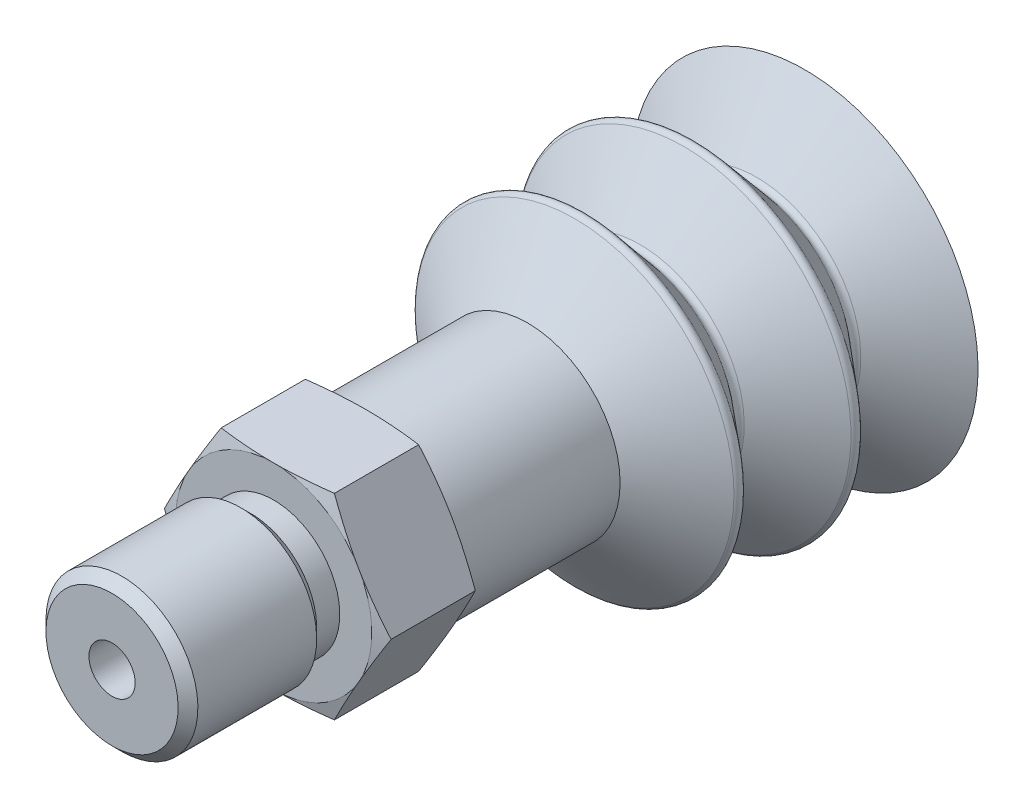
ISO-10303-21;
HEADER;
FILE_DESCRIPTION(('STEP AP214'),'2;1');
FILE_NAME('part.step','',(''),(''),'','','');
FILE_SCHEMA(('AUTOMOTIVE_DESIGN { 1 0 10303 214 1 1 1 1 }'));
ENDSEC;
DATA;
#1=APPLICATION_CONTEXT('core data for automotive mechanical design processes');
#2=APPLICATION_PROTOCOL_DEFINITION('international standard','automotive_design',2000,#1);
#3=PRODUCT_CONTEXT('',#1,'mechanical');
#4=PRODUCT('Part','Part','',(#3));
#5=PRODUCT_RELATED_PRODUCT_CATEGORY('part','',(#4));
#6=PRODUCT_DEFINITION_FORMATION('','',#4);
#7=PRODUCT_DEFINITION_CONTEXT('part definition',#1,'design');
#8=PRODUCT_DEFINITION('design','',#6,#7);
#9=PRODUCT_DEFINITION_SHAPE('','',#8);
#10=(LENGTH_UNIT() NAMED_UNIT(*) SI_UNIT(.MILLI.,.METRE.));
#11=(NAMED_UNIT(*) PLANE_ANGLE_UNIT() SI_UNIT($,.RADIAN.));
#12=(NAMED_UNIT(*) SI_UNIT($,.STERADIAN.) SOLID_ANGLE_UNIT());
#13=UNCERTAINTY_MEASURE_WITH_UNIT(LENGTH_MEASURE(1.E-05),#10,'distance_accuracy_value','');
#14=(GEOMETRIC_REPRESENTATION_CONTEXT(3) GLOBAL_UNCERTAINTY_ASSIGNED_CONTEXT((#13)) GLOBAL_UNIT_ASSIGNED_CONTEXT((#10,
#11,#12)) REPRESENTATION_CONTEXT('',''));
#15=CARTESIAN_POINT('',(0.,0.,0.));
#16=DIRECTION('',(0.,0.,1.));
#17=DIRECTION('',(1.,0.,0.));
#18=AXIS2_PLACEMENT_3D('',#15,#16,#17);
#19=CARTESIAN_POINT('',(-0.866025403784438,-0.5,0.));
#20=DIRECTION('',(-0.866025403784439,-0.5,0.));
#21=DIRECTION('',(0.,0.,-1.));
#22=AXIS2_PLACEMENT_3D('',#19,#20,#21);
#23=PLANE('',#22);
#24=DIRECTION('',(-0.5,0.866025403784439,0.));
#25=VECTOR('',#24,1.);
#26=CARTESIAN_POINT('',(5.41990059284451,-11.3875431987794,1.));
#27=LINE('',#26,#25);
#28=CARTESIAN_POINT('',(5.39998334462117,-11.3530455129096,1.));
#29=VERTEX_POINT('',#28);
#30=CARTESIAN_POINT('',(3.13397459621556,-7.42820323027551,1.));
#31=VERTEX_POINT('',#30);
#32=EDGE_CURVE('E1859',#29,#31,#27,.T.);
#33=ORIENTED_EDGE('',*,*,#32,.F.);
#34=CARTESIAN_POINT('',(5.39998334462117,-11.3530455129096,1.));
#35=CARTESIAN_POINT('',(4.01936033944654,-8.9617363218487,2.92731906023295));
#36=CARTESIAN_POINT('',(3.13397459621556,-7.42820323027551,4.15765188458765));
#37=B_SPLINE_CURVE_WITH_KNOTS('',2,(#34,#35,#36),.UNSPECIFIED.,.F.,.F.,(3,3),(0.,1.),.UNSPECIFIED.);
#38=CARTESIAN_POINT('',(3.13397459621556,-7.42820323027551,4.15765188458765));
#39=VERTEX_POINT('',#38);
#40=EDGE_CURVE('E910',#29,#39,#37,.T.);
#41=ORIENTED_EDGE('',*,*,#40,.T.);
#42=DIRECTION('',(0.,0.,1.));
#43=VECTOR('',#42,1.);
#44=CARTESIAN_POINT('',(3.13397459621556,-7.42820323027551,1.));
#45=LINE('',#44,#43);
#46=EDGE_CURVE('E10',#31,#39,#45,.T.);
#47=ORIENTED_EDGE('',*,*,#46,.F.);
#48=EDGE_LOOP('',(#33,#41,#47));
#49=FACE_BOUND('',#48,.T.);
#50=ADVANCED_FACE('F15',(#49),#23,.T.);
#51=CARTESIAN_POINT('',(0.866025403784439,0.5,0.));
#52=DIRECTION('',(-0.866025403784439,-0.5,0.));
#53=DIRECTION('',(0.,0.,-1.));
#54=AXIS2_PLACEMENT_3D('',#51,#52,#53);
#55=PLANE('',#54);
#56=CARTESIAN_POINT('',(7.13203415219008,-10.3530455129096,0.999999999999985));
#57=CARTESIAN_POINT('',(7.03069417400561,-10.1775159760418,1.14147015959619));
#58=CARTESIAN_POINT('',(6.92935280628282,-10.0019756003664,1.28292587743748));
#59=CARTESIAN_POINT('',(6.73131048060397,-9.65893521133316,1.55930932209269));
#60=CARTESIAN_POINT('',(6.63461010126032,-9.49143609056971,1.6942385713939));
#61=CARTESIAN_POINT('',(6.44584298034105,-9.16448252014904,1.95756921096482));
#62=CARTESIAN_POINT('',(6.35377720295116,-9.00502884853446,2.08597225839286));
#63=CARTESIAN_POINT('',(6.17428292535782,-8.69416365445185,2.33625036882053));
#64=CARTESIAN_POINT('',(6.08685529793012,-8.54275310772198,2.4581272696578));
#65=CARTESIAN_POINT('',(5.89634804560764,-8.21277927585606,2.72366313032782));
#66=CARTESIAN_POINT('',(5.79326925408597,-8.0342091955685,2.86731424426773));
#67=CARTESIAN_POINT('',(5.59286906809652,-7.68704825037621,3.14649488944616));
#68=CARTESIAN_POINT('',(5.4955490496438,-7.51845947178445,3.28202800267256));
#69=CARTESIAN_POINT('',(5.30664799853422,-7.19127279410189,3.54497279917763));
#70=CARTESIAN_POINT('',(5.21506961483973,-7.03267656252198,3.67238846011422));
#71=CARTESIAN_POINT('',(5.03767073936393,-6.72546175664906,3.91909663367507));
#72=CARTESIAN_POINT('',(4.95185201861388,-6.57684586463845,4.0383937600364));
#73=CARTESIAN_POINT('',(4.86602540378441,-6.42820323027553,4.15765188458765));
#74=B_SPLINE_CURVE_WITH_KNOTS('',3,(#56,#57,#58,#59,#60,#61,#62,#63,#64,#65,#66,#67,#68,#69,#70,
#71,#72,#73),.UNSPECIFIED.,.F.,.F.,(4,2,2,2,2,2,2,2,4),(0.,0.741517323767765,1.44898844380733,
2.1224127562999,2.76179096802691,3.51566984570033,4.22726190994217,4.89656529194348,
5.52358207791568),.UNSPECIFIED.);
#75=CARTESIAN_POINT('',(7.13203415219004,-10.3530455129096,1.));
#76=VERTEX_POINT('',#75);
#77=CARTESIAN_POINT('',(4.86602540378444,-6.42820323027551,4.15765188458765));
#78=VERTEX_POINT('',#77);
#79=EDGE_CURVE('E1240',#76,#78,#74,.T.);
#80=ORIENTED_EDGE('',*,*,#79,.F.);
#81=DIRECTION('',(-0.5,0.866025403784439,0.));
#82=VECTOR('',#81,1.);
#83=CARTESIAN_POINT('',(7.15195140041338,-10.3875431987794,1.));
#84=LINE('',#83,#82);
#85=CARTESIAN_POINT('',(4.86602540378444,-6.42820323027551,1.));
#86=VERTEX_POINT('',#85);
#87=EDGE_CURVE('E1254',#76,#86,#84,.T.);
#88=ORIENTED_EDGE('',*,*,#87,.T.);
#89=DIRECTION('',(0.,0.,1.));
#90=VECTOR('',#89,1.);
#91=CARTESIAN_POINT('',(4.86602540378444,-6.42820323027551,1.));
#92=LINE('',#91,#90);
#93=EDGE_CURVE('E28',#86,#78,#92,.T.);
#94=ORIENTED_EDGE('',*,*,#93,.T.);
#95=EDGE_LOOP('',(#80,#88,#94));
#96=FACE_BOUND('',#95,.T.);
#97=ADVANCED_FACE('F926',(#96),#55,.F.);
#98=CARTESIAN_POINT('',(4.86602540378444,-6.42820323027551,1.));
#99=DIRECTION('',(0.5,-0.866025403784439,0.));
#100=DIRECTION('',(0.866025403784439,0.5,0.));
#101=AXIS2_PLACEMENT_3D('',#98,#99,#100);
#102=PLANE('',#101);
#103=CARTESIAN_POINT('',(4.59019217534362,-6.58745561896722,4.18095688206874));
#104=CARTESIAN_POINT('',(4.57162952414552,-6.59817280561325,4.18223087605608));
#105=CARTESIAN_POINT('',(4.55306501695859,-6.60889186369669,4.18346273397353));
#106=CARTESIAN_POINT('',(4.51605825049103,-6.63026009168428,4.18582584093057));
#107=CARTESIAN_POINT('',(4.49761601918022,-6.64090924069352,4.18695771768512));
#108=CARTESIAN_POINT('',(4.46085063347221,-6.66213858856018,4.18911483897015));
#109=CARTESIAN_POINT('',(4.44252750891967,-6.67271877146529,4.19014074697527));
#110=CARTESIAN_POINT('',(4.40599746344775,-6.69381129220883,4.1920807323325));
#111=CARTESIAN_POINT('',(4.38779057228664,-6.70432361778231,4.19299550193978));
#112=CARTESIAN_POINT('',(4.35149035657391,-6.72528170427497,4.19470865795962));
#113=CARTESIAN_POINT('',(4.33339706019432,-6.7357274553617,4.19550775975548));
#114=CARTESIAN_POINT('',(4.29732166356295,-6.75655389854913,4.19698570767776));
#115=CARTESIAN_POINT('',(4.27933958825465,-6.7669345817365,4.19766528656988));
#116=CARTESIAN_POINT('',(4.24348449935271,-6.78763262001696,4.19890091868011));
#117=CARTESIAN_POINT('',(4.22561150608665,-6.79794996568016,4.19945771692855));
#118=CARTESIAN_POINT('',(4.18997278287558,-6.81852342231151,4.20044528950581));
#119=CARTESIAN_POINT('',(4.17220706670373,-6.82877952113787,4.20087681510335));
#120=CARTESIAN_POINT('',(4.15444071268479,-6.83903684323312,4.20124522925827));
#121=B_SPLINE_CURVE_WITH_KNOTS('',3,(#103,#104,#105,#106,#107,#108,#109,#110,#111,#112,#113,
#114,#115,#116,#117,#118,#119,#120),.UNSPECIFIED.,.F.,.F.,(4,2,2,2,2,2,2,2,4),(0.,
0.0644164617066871,0.12839447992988,0.191943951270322,0.255074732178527,0.31779664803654,
0.380119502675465,0.442053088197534,0.503607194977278),.UNSPECIFIED.);
#122=CARTESIAN_POINT('',(4.59019217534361,-6.58745561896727,4.18095688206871));
#123=VERTEX_POINT('',#122);
#124=CARTESIAN_POINT('',(4.15444071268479,-6.83903684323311,4.20124522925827));
#125=VERTEX_POINT('',#124);
#126=EDGE_CURVE('E1691',#123,#125,#121,.T.);
#127=ORIENTED_EDGE('',*,*,#126,.F.);
#128=CARTESIAN_POINT('',(4.86602540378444,-6.42820323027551,4.15765188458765));
#129=CARTESIAN_POINT('',(4.77408099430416,-6.48128735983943,4.16687260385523));
#130=CARTESIAN_POINT('',(4.68213658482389,-6.53437148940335,4.17464695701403));
#131=CARTESIAN_POINT('',(4.59019217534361,-6.58745561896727,4.18095688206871));
#132=(BOUNDED_CURVE() B_SPLINE_CURVE(3,(#128,#129,#130,#131),.UNSPECIFIED.,.F.,
.F.) B_SPLINE_CURVE_WITH_KNOTS((4,4),(8.08290376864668E-07,0.000319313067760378),
.UNSPECIFIED.) CURVE() GEOMETRIC_REPRESENTATION_ITEM() RATIONAL_B_SPLINE_CURVE((1.,1.,1.,1.)) REPRESENTATION_ITEM(''));
#133=EDGE_CURVE('E1229',#78,#123,#132,.T.);
#134=ORIENTED_EDGE('',*,*,#133,.F.);
#135=ORIENTED_EDGE('',*,*,#93,.F.);
#136=DIRECTION('',(-0.866025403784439,-0.5,0.));
#137=VECTOR('',#136,1.);
#138=CARTESIAN_POINT('',(4.86602540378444,-6.42820323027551,1.));
#139=LINE('',#138,#137);
#140=EDGE_CURVE('E1799',#86,#31,#139,.T.);
#141=ORIENTED_EDGE('',*,*,#140,.T.);
#142=ORIENTED_EDGE('',*,*,#46,.T.);
#143=CARTESIAN_POINT('',(3.40980782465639,-7.26895084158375,4.18095688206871));
#144=CARTESIAN_POINT('',(3.31786341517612,-7.32203497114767,4.17464695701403));
#145=CARTESIAN_POINT('',(3.22591900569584,-7.37511910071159,4.16687260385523));
#146=CARTESIAN_POINT('',(3.13397459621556,-7.42820323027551,4.15765188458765));
#147=(BOUNDED_CURVE() B_SPLINE_CURVE(3,(#143,#144,#145,#146),.UNSPECIFIED.,.F.,
.F.) B_SPLINE_CURVE_WITH_KNOTS((4,4),(0.00168230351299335,0.00200080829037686),
.UNSPECIFIED.) CURVE() GEOMETRIC_REPRESENTATION_ITEM() RATIONAL_B_SPLINE_CURVE((1.,1.,1.,1.)) REPRESENTATION_ITEM(''));
#148=CARTESIAN_POINT('',(3.40980782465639,-7.26895084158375,4.18095688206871));
#149=VERTEX_POINT('',#148);
#150=EDGE_CURVE('E1096',#149,#39,#147,.T.);
#151=ORIENTED_EDGE('',*,*,#150,.F.);
#152=CARTESIAN_POINT('',(3.845559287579,-7.01736961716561,4.20124522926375));
#153=CARTESIAN_POINT('',(3.82779300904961,-7.02762707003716,4.20087681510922));
#154=CARTESIAN_POINT('',(3.8100281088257,-7.03788458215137,4.20044528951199));
#155=CARTESIAN_POINT('',(3.7743916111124,-7.05846189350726,4.19945771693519));
#156=CARTESIAN_POINT('',(3.75652003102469,-7.06878168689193,4.1989009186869));
#157=CARTESIAN_POINT('',(3.7206674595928,-7.08948408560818,4.19766528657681));
#158=CARTESIAN_POINT('',(3.70268648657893,-7.09986667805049,4.19698570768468));
#159=CARTESIAN_POINT('',(3.6666125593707,-7.1206956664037,4.19550775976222));
#160=CARTESIAN_POINT('',(3.64851962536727,-7.13114204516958,4.19470865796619));
#161=CARTESIAN_POINT('',(3.61221928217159,-7.15209991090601,4.19299550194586));
#162=CARTESIAN_POINT('',(3.59401189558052,-7.16261137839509,4.19208073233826));
#163=CARTESIAN_POINT('',(3.55748021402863,-7.18370106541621,4.19014074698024));
#164=CARTESIAN_POINT('',(3.5391559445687,-7.19427926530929,4.18911483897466));
#165=CARTESIAN_POINT('',(3.50238809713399,-7.21550434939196,4.18695771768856));
#166=CARTESIAN_POINT('',(3.48394454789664,-7.22615121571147,4.18582584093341));
#167=CARTESIAN_POINT('',(3.44693573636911,-7.24751590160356,4.18346273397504));
#168=CARTESIAN_POINT('',(3.42837050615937,-7.25823370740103,4.18223087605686));
#169=CARTESIAN_POINT('',(3.40980782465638,-7.26895084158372,4.18095688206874));
#170=B_SPLINE_CURVE_WITH_KNOTS('',3,(#152,#153,#154,#155,#156,#157,#158,#159,#160,#161,#162,
#163,#164,#165,#166,#167,#168,#169),.UNSPECIFIED.,.F.,.F.,(4,2,2,2,2,2,2,2,4),(0.,
0.061554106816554,0.12348769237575,0.185810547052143,0.248532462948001,0.31166324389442,
0.375212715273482,0.43919073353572,0.503607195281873),.UNSPECIFIED.);
#171=CARTESIAN_POINT('',(3.84555928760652,-7.01736961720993,4.20124522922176));
#172=VERTEX_POINT('',#171);
#173=EDGE_CURVE('E1780',#172,#149,#170,.T.);
#174=ORIENTED_EDGE('',*,*,#173,.F.);
#175=DIRECTION('',(-0.866025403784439,-0.5,0.));
#176=VECTOR('',#175,1.);
#177=CARTESIAN_POINT('',(4.86602540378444,-6.42820323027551,4.20124522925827));
#178=LINE('',#177,#176);
#179=EDGE_CURVE('E1568',#125,#172,#178,.T.);
#180=ORIENTED_EDGE('',*,*,#179,.F.);
#181=EDGE_LOOP('',(#127,#134,#135,#141,#142,#151,#174,#180));
#182=FACE_BOUND('',#181,.T.);
#183=ADVANCED_FACE('F654',(#182),#102,.F.);
#184=CARTESIAN_POINT('',(4.86602540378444,-6.42820323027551,4.20124522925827));
#185=DIRECTION('',(-0.286788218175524,0.496731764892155,-0.819152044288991));
#186=DIRECTION('',(0.943827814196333,0.,-0.330437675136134));
#187=AXIS2_PLACEMENT_3D('',#184,#185,#186);
#188=PLANE('',#187);
#189=CARTESIAN_POINT('',(4.01448738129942,-6.95329611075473,4.18095688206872));
#190=CARTESIAN_POINT('',(3.9583274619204,-6.97501524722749,4.18744825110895));
#191=CARTESIAN_POINT('',(3.90198288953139,-6.99644455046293,4.19418002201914));
#192=CARTESIAN_POINT('',(3.84555928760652,-7.01736961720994,4.20124522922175));
#193=(BOUNDED_CURVE() B_SPLINE_CURVE(3,(#189,#190,#191,#192),.UNSPECIFIED.,.F.,
.F.) B_SPLINE_CURVE_WITH_KNOTS((4,4),(-2.36627217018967E-05,0.000158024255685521),
.UNSPECIFIED.) CURVE() GEOMETRIC_REPRESENTATION_ITEM() RATIONAL_B_SPLINE_CURVE((1.,1.,1.,1.)) REPRESENTATION_ITEM(''));
#194=CARTESIAN_POINT('',(4.01448738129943,-6.95329611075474,4.18095688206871));
#195=VERTEX_POINT('',#194);
#196=EDGE_CURVE('E1690',#195,#172,#193,.T.);
#197=ORIENTED_EDGE('',*,*,#196,.F.);
#198=CARTESIAN_POINT('',(4.15444071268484,-6.83903684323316,4.20124522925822));
#199=CARTESIAN_POINT('',(4.10810727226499,-6.87743858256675,4.19418002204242));
#200=CARTESIAN_POINT('',(4.06137666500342,-6.91551976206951,4.18744825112));
#201=CARTESIAN_POINT('',(4.01448738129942,-6.95329611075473,4.18095688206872));
#202=(BOUNDED_CURVE() B_SPLINE_CURVE(3,(#198,#199,#200,#201),.UNSPECIFIED.,.F.,
.F.) B_SPLINE_CURVE_WITH_KNOTS((4,4),(-0.000158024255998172,2.36627217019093E-05),
.UNSPECIFIED.) CURVE() GEOMETRIC_REPRESENTATION_ITEM() RATIONAL_B_SPLINE_CURVE((1.,1.,1.,1.)) REPRESENTATION_ITEM(''));
#203=EDGE_CURVE('E1687',#125,#195,#202,.T.);
#204=ORIENTED_EDGE('',*,*,#203,.F.);
#205=ORIENTED_EDGE('',*,*,#179,.T.);
#206=EDGE_LOOP('',(#197,#204,#205));
#207=FACE_BOUND('',#206,.T.);
#208=ADVANCED_FACE('F1267',(#207),#188,.F.);
#209=CARTESIAN_POINT('',(7.15195140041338,-10.3875431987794,1.));
#210=DIRECTION('',(0.,0.,1.));
#211=DIRECTION('',(-1.,0.,0.));
#212=AXIS2_PLACEMENT_3D('',#209,#210,#211);
#213=PLANE('',#212);
#214=CARTESIAN_POINT('',(0.,0.,1.));
#215=DIRECTION('',(0.,0.,1.));
#216=DIRECTION('',(0.,1.,0.));
#217=AXIS2_PLACEMENT_3D('',#214,#215,#216);
#218=CIRCLE('',#217,12.5718519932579);
#219=EDGE_CURVE('E1424',#29,#76,#218,.T.);
#220=ORIENTED_EDGE('',*,*,#219,.F.);
#221=ORIENTED_EDGE('',*,*,#32,.T.);
#222=ORIENTED_EDGE('',*,*,#140,.F.);
#223=ORIENTED_EDGE('',*,*,#87,.F.);
#224=EDGE_LOOP('',(#220,#221,#222,#223));
#225=FACE_BOUND('',#224,.T.);
#226=ADVANCED_FACE('F1264',(#225),#213,.F.);
#227=CARTESIAN_POINT('',(-0.866025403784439,-0.5,0.));
#228=DIRECTION('',(0.866025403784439,0.5,0.));
#229=DIRECTION('',(0.,0.,1.));
#230=AXIS2_PLACEMENT_3D('',#227,#228,#229);
#231=PLANE('',#230);
#232=CARTESIAN_POINT('',(-7.13203415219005,10.3530455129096,0.999999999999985));
#233=CARTESIAN_POINT('',(-7.03069417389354,10.177515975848,1.14147015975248));
#234=CARTESIAN_POINT('',(-6.92935280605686,10.0019755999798,1.28292587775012));
#235=CARTESIAN_POINT('',(-6.73131048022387,9.65893521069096,1.55930932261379));
#236=CARTESIAN_POINT('',(-6.63461010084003,9.49143608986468,1.69423857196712));
#237=CARTESIAN_POINT('',(-6.44584297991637,9.16448251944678,1.95756921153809));
#238=CARTESIAN_POINT('',(-6.35377720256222,9.00502884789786,2.08597225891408));
#239=CARTESIAN_POINT('',(-6.17428292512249,8.69416365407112,2.33625036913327));
#240=CARTESIAN_POINT('',(-6.0868552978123,8.5427531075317,2.45812726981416));
#241=CARTESIAN_POINT('',(-5.89634804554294,8.21277927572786,2.72366313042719));
#242=CARTESIAN_POINT('',(-5.793269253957,8.03420919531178,2.86731424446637));
#243=CARTESIAN_POINT('',(-5.59286906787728,7.68704824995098,3.14649488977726));
#244=CARTESIAN_POINT('',(-5.49554904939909,7.51845947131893,3.28202800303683));
#245=CARTESIAN_POINT('',(-5.3066479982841,7.19127279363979,3.54497279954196));
#246=CARTESIAN_POINT('',(-5.21506961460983,7.03267656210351,3.67238846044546));
#247=CARTESIAN_POINT('',(-5.03767073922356,6.72546175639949,3.91909663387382));
#248=CARTESIAN_POINT('',(-4.95185201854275,6.57684586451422,4.03839376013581));
#249=CARTESIAN_POINT('',(-4.86602540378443,6.42820323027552,4.15765188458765));
#250=B_SPLINE_CURVE_WITH_KNOTS('',3,(#232,#233,#234,#235,#236,#237,#238,#239,#240,#241,#242,
#243,#244,#245,#246,#247,#248,#249),.UNSPECIFIED.,.F.,.F.,(4,2,2,2,2,2,2,2,4),(0.,
0.741517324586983,1.44898844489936,2.1224127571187,2.76179096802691,3.51566984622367,
4.22726191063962,4.89656529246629,5.52358207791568),.UNSPECIFIED.);
#251=CARTESIAN_POINT('',(-7.13203415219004,10.3530455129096,1.));
#252=VERTEX_POINT('',#251);
#253=CARTESIAN_POINT('',(-4.86602540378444,6.42820323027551,4.15765188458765));
#254=VERTEX_POINT('',#253);
#255=EDGE_CURVE('E1412',#252,#254,#250,.T.);
#256=ORIENTED_EDGE('',*,*,#255,.F.);
#257=DIRECTION('',(-0.5,0.866025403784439,0.));
#258=VECTOR('',#257,1.);
#259=CARTESIAN_POINT('',(-4.86602540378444,6.42820323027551,1.));
#260=LINE('',#259,#258);
#261=CARTESIAN_POINT('',(-4.86602540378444,6.42820323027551,1.));
#262=VERTEX_POINT('',#261);
#263=EDGE_CURVE('E1490',#262,#252,#260,.T.);
#264=ORIENTED_EDGE('',*,*,#263,.F.);
#265=DIRECTION('',(0.,0.,-1.));
#266=VECTOR('',#265,1.);
#267=CARTESIAN_POINT('',(-4.86602540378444,6.42820323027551,4.20124522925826));
#268=LINE('',#267,#266);
#269=EDGE_CURVE('E1494',#254,#262,#268,.T.);
#270=ORIENTED_EDGE('',*,*,#269,.F.);
#271=EDGE_LOOP('',(#256,#264,#270));
#272=FACE_BOUND('',#271,.T.);
#273=ADVANCED_FACE('F614',(#272),#231,.F.);
#274=CARTESIAN_POINT('',(0.866025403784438,0.5,0.));
#275=DIRECTION('',(0.866025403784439,0.5,0.));
#276=DIRECTION('',(0.,0.,1.));
#277=AXIS2_PLACEMENT_3D('',#274,#275,#276);
#278=PLANE('',#277);
#279=DIRECTION('',(-0.5,0.866025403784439,0.));
#280=VECTOR('',#279,1.);
#281=CARTESIAN_POINT('',(-3.13397459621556,7.42820323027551,1.));
#282=LINE('',#281,#280);
#283=CARTESIAN_POINT('',(-3.13397459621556,7.42820323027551,1.));
#284=VERTEX_POINT('',#283);
#285=CARTESIAN_POINT('',(-5.39998334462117,11.3530455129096,1.));
#286=VERTEX_POINT('',#285);
#287=EDGE_CURVE('E1404',#284,#286,#282,.T.);
#288=ORIENTED_EDGE('',*,*,#287,.T.);
#289=CARTESIAN_POINT('',(-5.39998334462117,11.3530455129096,1.));
#290=CARTESIAN_POINT('',(-4.01936033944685,8.96173632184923,2.92731906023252));
#291=CARTESIAN_POINT('',(-3.13397459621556,7.42820323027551,4.15765188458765));
#292=B_SPLINE_CURVE_WITH_KNOTS('',2,(#289,#290,#291),.UNSPECIFIED.,.F.,.F.,(3,3),(0.,1.),.UNSPECIFIED.);
#293=CARTESIAN_POINT('',(-3.13397459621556,7.42820323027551,4.15765188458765));
#294=VERTEX_POINT('',#293);
#295=EDGE_CURVE('E1939',#286,#294,#292,.T.);
#296=ORIENTED_EDGE('',*,*,#295,.T.);
#297=DIRECTION('',(0.,0.,-1.));
#298=VECTOR('',#297,1.);
#299=CARTESIAN_POINT('',(-3.13397459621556,7.42820323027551,4.20124522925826));
#300=LINE('',#299,#298);
#301=EDGE_CURVE('E1680',#294,#284,#300,.T.);
#302=ORIENTED_EDGE('',*,*,#301,.T.);
#303=EDGE_LOOP('',(#288,#296,#302));
#304=FACE_BOUND('',#303,.T.);
#305=ADVANCED_FACE('F1140',(#304),#278,.T.);
#306=CARTESIAN_POINT('',(-5.41990059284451,11.3875431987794,1.));
#307=DIRECTION('',(0.286788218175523,-0.496731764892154,-0.819152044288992));
#308=DIRECTION('',(0.,-0.855070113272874,0.518512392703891));
#309=AXIS2_PLACEMENT_3D('',#306,#307,#308);
#310=PLANE('',#309);
#311=CARTESIAN_POINT('',(-4.01448738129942,6.95329611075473,4.18095688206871));
#312=CARTESIAN_POINT('',(-3.95832746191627,6.9750152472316,4.1874482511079));
#313=CARTESIAN_POINT('',(-3.90198288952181,6.99644455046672,4.19418002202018));
#314=CARTESIAN_POINT('',(-3.84555928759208,7.01736961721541,4.20124522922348));
#315=(BOUNDED_CURVE() B_SPLINE_CURVE(3,(#311,#312,#313,#314),.UNSPECIFIED.,.F.,
.F.) B_SPLINE_CURVE_WITH_KNOTS((4,4),(-2.3662721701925E-05,0.000158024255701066),
.UNSPECIFIED.) CURVE() GEOMETRIC_REPRESENTATION_ITEM() RATIONAL_B_SPLINE_CURVE((1.,1.,1.,1.)) REPRESENTATION_ITEM(''));
#316=CARTESIAN_POINT('',(-4.01448738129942,6.95329611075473,4.18095688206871));
#317=VERTEX_POINT('',#316);
#318=CARTESIAN_POINT('',(-3.84555928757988,7.01736961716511,4.20124522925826));
#319=VERTEX_POINT('',#318);
#320=EDGE_CURVE('E1394',#317,#319,#315,.T.);
#321=ORIENTED_EDGE('',*,*,#320,.F.);
#322=CARTESIAN_POINT('',(-4.15444071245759,6.83903684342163,4.20124522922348));
#323=CARTESIAN_POINT('',(-4.10810727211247,6.87743858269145,4.19418002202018));
#324=CARTESIAN_POINT('',(-4.06137666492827,6.91551976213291,4.18744825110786));
#325=CARTESIAN_POINT('',(-4.01448738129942,6.95329611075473,4.18095688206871));
#326=(BOUNDED_CURVE() B_SPLINE_CURVE(3,(#322,#323,#324,#325),.UNSPECIFIED.,.F.,
.F.) B_SPLINE_CURVE_WITH_KNOTS((4,4),(-0.000158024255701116,2.36627217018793E-05),
.UNSPECIFIED.) CURVE() GEOMETRIC_REPRESENTATION_ITEM() RATIONAL_B_SPLINE_CURVE((1.,1.,1.,1.)) REPRESENTATION_ITEM(''));
#327=CARTESIAN_POINT('',(-4.15444071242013,6.83903684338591,4.20124522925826));
#328=VERTEX_POINT('',#327);
#329=EDGE_CURVE('E1399',#328,#317,#326,.T.);
#330=ORIENTED_EDGE('',*,*,#329,.F.);
#331=DIRECTION('',(-0.866025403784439,-0.5,0.));
#332=VECTOR('',#331,1.);
#333=CARTESIAN_POINT('',(-3.13397459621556,7.42820323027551,4.20124522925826));
#334=LINE('',#333,#332);
#335=EDGE_CURVE('E1683',#319,#328,#334,.T.);
#336=ORIENTED_EDGE('',*,*,#335,.F.);
#337=EDGE_LOOP('',(#321,#330,#336));
#338=FACE_BOUND('',#337,.T.);
#339=ADVANCED_FACE('F17',(#338),#310,.F.);
#340=CARTESIAN_POINT('',(-3.13397459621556,7.42820323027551,4.20124522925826));
#341=DIRECTION('',(-0.5,0.866025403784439,0.));
#342=DIRECTION('',(0.,0.,-1.));
#343=AXIS2_PLACEMENT_3D('',#340,#341,#342);
#344=PLANE('',#343);
#345=CARTESIAN_POINT('',(-4.5901921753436,6.58745561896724,4.18095688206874));
#346=CARTESIAN_POINT('',(-4.5716295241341,6.59817280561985,4.18223087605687));
#347=CARTESIAN_POINT('',(-4.55306501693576,6.60889186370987,4.18346273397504));
#348=CARTESIAN_POINT('',(-4.51605825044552,6.63026009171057,4.18582584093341));
#349=CARTESIAN_POINT('',(-4.49761601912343,6.64090924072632,4.18695771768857));
#350=CARTESIAN_POINT('',(-4.46085063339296,6.66213858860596,4.18911483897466));
#351=CARTESIAN_POINT('',(-4.44252750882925,6.67271877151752,4.19014074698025));
#352=CARTESIAN_POINT('',(-4.4059974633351,6.6938112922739,4.19208073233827));
#353=CARTESIAN_POINT('',(-4.38779057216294,6.70432361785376,4.19299550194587));
#354=CARTESIAN_POINT('',(-4.35149035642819,6.72528170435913,4.1947086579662));
#355=CARTESIAN_POINT('',(-4.33339706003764,6.73572745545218,4.19550775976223));
#356=CARTESIAN_POINT('',(-4.29732166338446,6.75655389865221,4.19698570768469));
#357=CARTESIAN_POINT('',(-4.27933958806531,6.76693458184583,4.19766528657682));
#358=CARTESIAN_POINT('',(-4.24348449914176,6.78763262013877,4.19890091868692));
#359=CARTESIAN_POINT('',(-4.22561150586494,6.79794996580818,4.19945771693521));
#360=CARTESIAN_POINT('',(-4.18997278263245,6.81852342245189,4.200445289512));
#361=CARTESIAN_POINT('',(-4.17220706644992,6.8287795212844,4.20087681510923));
#362=CARTESIAN_POINT('',(-4.15444071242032,6.8390368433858,4.20124522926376));
#363=B_SPLINE_CURVE_WITH_KNOTS('',3,(#345,#346,#347,#348,#349,#350,#351,#352,#353,#354,#355,
#356,#357,#358,#359,#360,#361,#362),.UNSPECIFIED.,.F.,.F.,(4,2,2,2,2,2,2,2,4),(0.,
0.0644164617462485,0.128394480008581,0.191943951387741,0.255074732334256,0.317796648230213,
0.380119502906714,0.442053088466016,0.50360719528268),.UNSPECIFIED.);
#364=CARTESIAN_POINT('',(-4.59019217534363,6.58745561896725,4.18095688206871));
#365=VERTEX_POINT('',#364);
#366=EDGE_CURVE('E1887',#365,#328,#363,.T.);
#367=ORIENTED_EDGE('',*,*,#366,.F.);
#368=CARTESIAN_POINT('',(-4.86602540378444,6.42820323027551,4.15765188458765));
#369=CARTESIAN_POINT('',(-4.77408099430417,6.48128735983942,4.16687260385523));
#370=CARTESIAN_POINT('',(-4.6821365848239,6.53437148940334,4.17464695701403));
#371=CARTESIAN_POINT('',(-4.59019217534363,6.58745561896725,4.18095688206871));
#372=(BOUNDED_CURVE() B_SPLINE_CURVE(3,(#368,#369,#370,#371),.UNSPECIFIED.,.F.,
.F.) B_SPLINE_CURVE_WITH_KNOTS((4,4),(8.08290376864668E-07,0.000319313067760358),
.UNSPECIFIED.) CURVE() GEOMETRIC_REPRESENTATION_ITEM() RATIONAL_B_SPLINE_CURVE((1.,1.,1.,1.)) REPRESENTATION_ITEM(''));
#373=EDGE_CURVE('E1416',#254,#365,#372,.T.);
#374=ORIENTED_EDGE('',*,*,#373,.F.);
#375=ORIENTED_EDGE('',*,*,#269,.T.);
#376=DIRECTION('',(-0.866025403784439,-0.5,0.));
#377=VECTOR('',#376,1.);
#378=CARTESIAN_POINT('',(-3.13397459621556,7.42820323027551,1.));
#379=LINE('',#378,#377);
#380=EDGE_CURVE('E1407',#284,#262,#379,.T.);
#381=ORIENTED_EDGE('',*,*,#380,.F.);
#382=ORIENTED_EDGE('',*,*,#301,.F.);
#383=CARTESIAN_POINT('',(-3.40980782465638,7.26895084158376,4.18095688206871));
#384=CARTESIAN_POINT('',(-3.3178634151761,7.32203497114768,4.17464695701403));
#385=CARTESIAN_POINT('',(-3.22591900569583,7.37511910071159,4.16687260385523));
#386=CARTESIAN_POINT('',(-3.13397459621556,7.42820323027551,4.15765188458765));
#387=(BOUNDED_CURVE() B_SPLINE_CURVE(3,(#383,#384,#385,#386),.UNSPECIFIED.,.F.,
.F.) B_SPLINE_CURVE_WITH_KNOTS((4,4),(0.00168230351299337,0.00200080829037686),
.UNSPECIFIED.) CURVE() GEOMETRIC_REPRESENTATION_ITEM() RATIONAL_B_SPLINE_CURVE((1.,1.,1.,1.)) REPRESENTATION_ITEM(''));
#388=CARTESIAN_POINT('',(-3.40980782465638,7.26895084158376,4.18095688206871));
#389=VERTEX_POINT('',#388);
#390=EDGE_CURVE('E1606',#389,#294,#387,.T.);
#391=ORIENTED_EDGE('',*,*,#390,.F.);
#392=CARTESIAN_POINT('',(-3.84555928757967,7.01736961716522,4.20124522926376));
#393=CARTESIAN_POINT('',(-3.82779300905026,7.02762707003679,4.20087681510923));
#394=CARTESIAN_POINT('',(-3.81002810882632,7.03788458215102,4.200445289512));
#395=CARTESIAN_POINT('',(-3.77439161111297,7.05846189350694,4.19945771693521));
#396=CARTESIAN_POINT('',(-3.75652003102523,7.06878168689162,4.19890091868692));
#397=CARTESIAN_POINT('',(-3.72066745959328,7.0894840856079,4.19766528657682));
#398=CARTESIAN_POINT('',(-3.70268648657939,7.09986667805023,4.19698570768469));
#399=CARTESIAN_POINT('',(-3.66661255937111,7.12069566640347,4.19550775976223));
#400=CARTESIAN_POINT('',(-3.64851962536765,7.13114204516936,4.1947086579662));
#401=CARTESIAN_POINT('',(-3.61221928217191,7.15209991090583,4.19299550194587));
#402=CARTESIAN_POINT('',(-3.59401189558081,7.16261137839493,4.19208073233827));
#403=CARTESIAN_POINT('',(-3.55748021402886,7.18370106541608,4.19014074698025));
#404=CARTESIAN_POINT('',(-3.5391559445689,7.19427926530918,4.18911483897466));
#405=CARTESIAN_POINT('',(-3.50238809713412,7.21550434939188,4.18695771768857));
#406=CARTESIAN_POINT('',(-3.48394454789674,7.22615121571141,4.18582584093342));
#407=CARTESIAN_POINT('',(-3.44693573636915,7.24751590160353,4.18346273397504));
#408=CARTESIAN_POINT('',(-3.42837050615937,7.25823370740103,4.18223087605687));
#409=CARTESIAN_POINT('',(-3.40980782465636,7.26895084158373,4.18095688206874));
#410=B_SPLINE_CURVE_WITH_KNOTS('',3,(#392,#393,#394,#395,#396,#397,#398,#399,#400,#401,#402,
#403,#404,#405,#406,#407,#408,#409),.UNSPECIFIED.,.F.,.F.,(4,2,2,2,2,2,2,2,4),(0.,
0.0615541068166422,0.123487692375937,0.185810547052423,0.248532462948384,0.311663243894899,
0.375212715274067,0.439190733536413,0.50360719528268),.UNSPECIFIED.);
#411=EDGE_CURVE('E1398',#319,#389,#410,.T.);
#412=ORIENTED_EDGE('',*,*,#411,.F.);
#413=ORIENTED_EDGE('',*,*,#335,.T.);
#414=EDGE_LOOP('',(#367,#374,#375,#381,#382,#391,#412,#413));
#415=FACE_BOUND('',#414,.T.);
#416=ADVANCED_FACE('F2179',(#415),#344,.F.);
#417=CARTESIAN_POINT('',(-3.13397459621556,7.42820323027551,1.));
#418=DIRECTION('',(0.,0.,1.));
#419=DIRECTION('',(-1.,0.,0.));
#420=AXIS2_PLACEMENT_3D('',#417,#418,#419);
#421=PLANE('',#420);
#422=CARTESIAN_POINT('',(0.,0.,1.));
#423=DIRECTION('',(0.,0.,1.));
#424=DIRECTION('',(0.,1.,0.));
#425=AXIS2_PLACEMENT_3D('',#422,#423,#424);
#426=CIRCLE('',#425,12.5718519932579);
#427=EDGE_CURVE('E1417',#286,#252,#426,.T.);
#428=ORIENTED_EDGE('',*,*,#427,.F.);
#429=ORIENTED_EDGE('',*,*,#287,.F.);
#430=ORIENTED_EDGE('',*,*,#380,.T.);
#431=ORIENTED_EDGE('',*,*,#263,.T.);
#432=EDGE_LOOP('',(#428,#429,#430,#431));
#433=FACE_BOUND('',#432,.T.);
#434=ADVANCED_FACE('F703',(#433),#421,.F.);
#435=CARTESIAN_POINT('',(0.866025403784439,-0.5,0.));
#436=DIRECTION('',(0.866025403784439,-0.5,0.));
#437=DIRECTION('',(0.5,0.866025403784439,0.));
#438=AXIS2_PLACEMENT_3D('',#435,#436,#437);
#439=PLANE('',#438);
#440=DIRECTION('',(-0.5,-0.866025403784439,0.));
#441=VECTOR('',#440,1.);
#442=CARTESIAN_POINT('',(7.15195140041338,10.3875431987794,1.));
#443=LINE('',#442,#441);
#444=CARTESIAN_POINT('',(7.13203415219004,10.3530455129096,1.));
#445=VERTEX_POINT('',#444);
#446=CARTESIAN_POINT('',(4.86602540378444,6.42820323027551,1.));
#447=VERTEX_POINT('',#446);
#448=EDGE_CURVE('E1563',#445,#447,#443,.T.);
#449=ORIENTED_EDGE('',*,*,#448,.F.);
#450=CARTESIAN_POINT('',(7.13203415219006,10.3530455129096,1.));
#451=CARTESIAN_POINT('',(5.75141114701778,7.9617363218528,2.92731906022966));
#452=CARTESIAN_POINT('',(4.86602540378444,6.42820323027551,4.15765188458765));
#453=B_SPLINE_CURVE_WITH_KNOTS('',2,(#450,#451,#452),.UNSPECIFIED.,.F.,.F.,(3,3),(0.,1.),.UNSPECIFIED.);
#454=CARTESIAN_POINT('',(4.86602540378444,6.42820323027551,4.15765188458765));
#455=VERTEX_POINT('',#454);
#456=EDGE_CURVE('E1353',#445,#455,#453,.T.);
#457=ORIENTED_EDGE('',*,*,#456,.T.);
#458=DIRECTION('',(0.,0.,1.));
#459=VECTOR('',#458,1.);
#460=CARTESIAN_POINT('',(4.86602540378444,6.42820323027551,1.));
#461=LINE('',#460,#459);
#462=EDGE_CURVE('E1408',#447,#455,#461,.T.);
#463=ORIENTED_EDGE('',*,*,#462,.F.);
#464=EDGE_LOOP('',(#449,#457,#463));
#465=FACE_BOUND('',#464,.T.);
#466=ADVANCED_FACE('F1334',(#465),#439,.T.);
#467=CARTESIAN_POINT('',(-0.866025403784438,0.5,0.));
#468=DIRECTION('',(0.866025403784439,-0.5,0.));
#469=DIRECTION('',(0.5,0.866025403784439,0.));
#470=AXIS2_PLACEMENT_3D('',#467,#468,#469);
#471=PLANE('',#470);
#472=CARTESIAN_POINT('',(5.39998334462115,11.3530455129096,0.999999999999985));
#473=CARTESIAN_POINT('',(5.29864029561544,11.177517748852,1.14147015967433));
#474=CARTESIAN_POINT('',(5.19728855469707,11.0019833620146,1.2829258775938));
#475=CARTESIAN_POINT('',(4.9992280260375,10.6589534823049,1.55930932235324));
#476=CARTESIAN_POINT('',(4.90251972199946,10.4914589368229,1.69423857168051));
#477=CARTESIAN_POINT('',(4.71375318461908,10.164505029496,1.95756921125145));
#478=CARTESIAN_POINT('',(4.62169514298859,10.0050468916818,2.08597225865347));
#479=CARTESIAN_POINT('',(4.44222512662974,9.69416769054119,2.3362503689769));
#480=CARTESIAN_POINT('',(4.35481356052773,9.54274787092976,2.45812726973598));
#481=CARTESIAN_POINT('',(4.16430146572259,9.21277683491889,2.72366313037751));
#482=CARTESIAN_POINT('',(4.06119463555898,9.034222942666,2.86731424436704));
#483=CARTESIAN_POINT('',(3.86074453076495,8.68709081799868,3.14649488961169));
#484=CARTESIAN_POINT('',(3.76340237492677,8.51851482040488,3.28202800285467));
#485=CARTESIAN_POINT('',(3.57450092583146,8.19132837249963,3.54497279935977));
#486=CARTESIAN_POINT('',(3.48294175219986,8.03272105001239,3.67238846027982));
#487=CARTESIAN_POINT('',(3.30558536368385,7.72548171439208,3.91909663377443));
#488=CARTESIAN_POINT('',(3.21978958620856,7.57685257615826,4.0383937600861));
#489=CARTESIAN_POINT('',(3.13397459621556,7.42820323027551,4.15765188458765));
#490=B_SPLINE_CURVE_WITH_KNOTS('',3,(#472,#473,#474,#475,#476,#477,#478,#479,#480,#481,#482,
#483,#484,#485,#486,#487,#488,#489),.UNSPECIFIED.,.F.,.F.,(4,2,2,2,2,2,2,2,4),(0.,
0.741517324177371,1.44898844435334,2.1224127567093,2.76179096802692,3.51566984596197,
4.22726191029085,4.89656529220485,5.52358207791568),.UNSPECIFIED.);
#491=CARTESIAN_POINT('',(5.39998334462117,11.3530455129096,1.));
#492=VERTEX_POINT('',#491);
#493=CARTESIAN_POINT('',(3.13397459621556,7.42820323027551,4.15765188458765));
#494=VERTEX_POINT('',#493);
#495=EDGE_CURVE('E1364',#492,#494,#490,.T.);
#496=ORIENTED_EDGE('',*,*,#495,.F.);
#497=DIRECTION('',(-0.5,-0.866025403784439,0.));
#498=VECTOR('',#497,1.);
#499=CARTESIAN_POINT('',(5.41990059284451,11.3875431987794,1.));
#500=LINE('',#499,#498);
#501=CARTESIAN_POINT('',(3.13397459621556,7.42820323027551,1.));
#502=VERTEX_POINT('',#501);
#503=EDGE_CURVE('E1475',#492,#502,#500,.T.);
#504=ORIENTED_EDGE('',*,*,#503,.T.);
#505=DIRECTION('',(0.,0.,1.));
#506=VECTOR('',#505,1.);
#507=CARTESIAN_POINT('',(3.13397459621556,7.42820323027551,1.));
#508=LINE('',#507,#506);
#509=EDGE_CURVE('E1554',#502,#494,#508,.T.);
#510=ORIENTED_EDGE('',*,*,#509,.T.);
#511=EDGE_LOOP('',(#496,#504,#510));
#512=FACE_BOUND('',#511,.T.);
#513=ADVANCED_FACE('F1337',(#512),#471,.F.);
#514=CARTESIAN_POINT('',(3.13397459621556,7.42820323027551,1.));
#515=DIRECTION('',(0.5,0.866025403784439,0.));
#516=DIRECTION('',(0.,0.,1.));
#517=AXIS2_PLACEMENT_3D('',#514,#515,#516);
#518=PLANE('',#517);
#519=CARTESIAN_POINT('',(3.40980782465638,7.26895084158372,4.18095688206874));
#520=CARTESIAN_POINT('',(3.42837050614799,7.2582337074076,4.18223087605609));
#521=CARTESIAN_POINT('',(3.44693573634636,7.24751590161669,4.18346273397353));
#522=CARTESIAN_POINT('',(3.48394454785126,7.22615121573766,4.18582584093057));
#523=CARTESIAN_POINT('',(3.50238809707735,7.21550434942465,4.18695771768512));
#524=CARTESIAN_POINT('',(3.53915594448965,7.19427926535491,4.18911483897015));
#525=CARTESIAN_POINT('',(3.55748021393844,7.18370106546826,4.19014074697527));
#526=CARTESIAN_POINT('',(3.59401189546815,7.16261137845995,4.1920807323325));
#527=CARTESIAN_POINT('',(3.61221928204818,7.15209991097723,4.19299550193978));
#528=CARTESIAN_POINT('',(3.64851962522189,7.13114204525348,4.19470865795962));
#529=CARTESIAN_POINT('',(3.66661255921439,7.12069566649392,4.19550775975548));
#530=CARTESIAN_POINT('',(3.70268648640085,7.09986667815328,4.19698570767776));
#531=CARTESIAN_POINT('',(3.72066745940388,7.08948408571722,4.19766528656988));
#532=CARTESIAN_POINT('',(3.75652003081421,7.06878168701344,4.19890091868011));
#533=CARTESIAN_POINT('',(3.77439161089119,7.05846189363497,4.19945771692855));
#534=CARTESIAN_POINT('',(3.81002810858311,7.03788458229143,4.20044528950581));
#535=CARTESIAN_POINT('',(3.82779300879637,7.02762707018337,4.20087681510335));
#536=CARTESIAN_POINT('',(3.84555928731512,7.01736961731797,4.20124522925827));
#537=B_SPLINE_CURVE_WITH_KNOTS('',3,(#519,#520,#521,#522,#523,#524,#525,#526,#527,#528,#529,
#530,#531,#532,#533,#534,#535,#536),.UNSPECIFIED.,.F.,.F.,(4,2,2,2,2,2,2,2,4),(0.,
0.0644164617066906,0.128394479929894,0.191943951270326,0.25507473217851,0.317796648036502,
0.380119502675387,0.44205308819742,0.503607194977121),.UNSPECIFIED.);
#538=CARTESIAN_POINT('',(3.40980782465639,7.26895084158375,4.18095688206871));
#539=VERTEX_POINT('',#538);
#540=CARTESIAN_POINT('',(3.84555928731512,7.01736961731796,4.20124522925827));
#541=VERTEX_POINT('',#540);
#542=EDGE_CURVE('E1832',#539,#541,#537,.T.);
#543=ORIENTED_EDGE('',*,*,#542,.F.);
#544=CARTESIAN_POINT('',(3.13397459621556,7.42820323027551,4.15765188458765));
#545=CARTESIAN_POINT('',(3.22591900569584,7.37511910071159,4.16687260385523));
#546=CARTESIAN_POINT('',(3.31786341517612,7.32203497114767,4.17464695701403));
#547=CARTESIAN_POINT('',(3.40980782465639,7.26895084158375,4.18095688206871));
#548=(BOUNDED_CURVE() B_SPLINE_CURVE(3,(#544,#545,#546,#547),.UNSPECIFIED.,.F.,
.F.) B_SPLINE_CURVE_WITH_KNOTS((4,4),(8.08290376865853E-07,0.000319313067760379),
.UNSPECIFIED.) CURVE() GEOMETRIC_REPRESENTATION_ITEM() RATIONAL_B_SPLINE_CURVE((1.,1.,1.,1.)) REPRESENTATION_ITEM(''));
#549=EDGE_CURVE('E1603',#494,#539,#548,.T.);
#550=ORIENTED_EDGE('',*,*,#549,.F.);
#551=ORIENTED_EDGE('',*,*,#509,.F.);
#552=DIRECTION('',(0.866025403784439,-0.5,0.));
#553=VECTOR('',#552,1.);
#554=CARTESIAN_POINT('',(3.13397459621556,7.42820323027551,1.));
#555=LINE('',#554,#553);
#556=EDGE_CURVE('E1479',#502,#447,#555,.T.);
#557=ORIENTED_EDGE('',*,*,#556,.T.);
#558=ORIENTED_EDGE('',*,*,#462,.T.);
#559=CARTESIAN_POINT('',(4.59019217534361,6.58745561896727,4.18095688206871));
#560=CARTESIAN_POINT('',(4.68213658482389,6.53437148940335,4.17464695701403));
#561=CARTESIAN_POINT('',(4.77408099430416,6.48128735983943,4.16687260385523));
#562=CARTESIAN_POINT('',(4.86602540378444,6.42820323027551,4.15765188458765));
#563=(BOUNDED_CURVE() B_SPLINE_CURVE(3,(#559,#560,#561,#562),.UNSPECIFIED.,.F.,
.F.) B_SPLINE_CURVE_WITH_KNOTS((4,4),(0.00168230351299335,0.00200080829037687),
.UNSPECIFIED.) CURVE() GEOMETRIC_REPRESENTATION_ITEM() RATIONAL_B_SPLINE_CURVE((1.,1.,1.,1.)) REPRESENTATION_ITEM(''));
#564=CARTESIAN_POINT('',(4.59019217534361,6.58745561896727,4.18095688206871));
#565=VERTEX_POINT('',#564);
#566=EDGE_CURVE('E1315',#565,#455,#563,.T.);
#567=ORIENTED_EDGE('',*,*,#566,.F.);
#568=CARTESIAN_POINT('',(4.15444071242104,6.83903684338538,4.20124522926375));
#569=CARTESIAN_POINT('',(4.17220706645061,6.828779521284,4.20087681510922));
#570=CARTESIAN_POINT('',(4.18997278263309,6.81852342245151,4.20044528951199));
#571=CARTESIAN_POINT('',(4.22561150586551,6.79794996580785,4.19945771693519));
#572=CARTESIAN_POINT('',(4.24348449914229,6.78763262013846,4.1989009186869));
#573=CARTESIAN_POINT('',(4.27933958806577,6.76693458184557,4.19766528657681));
#574=CARTESIAN_POINT('',(4.29732166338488,6.75655389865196,4.19698570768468));
#575=CARTESIAN_POINT('',(4.333397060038,6.73572745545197,4.19550775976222));
#576=CARTESIAN_POINT('',(4.35149035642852,6.72528170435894,4.19470865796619));
#577=CARTESIAN_POINT('',(4.38779057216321,6.70432361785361,4.19299550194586));
#578=CARTESIAN_POINT('',(4.40599746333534,6.69381129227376,4.19208073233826));
#579=CARTESIAN_POINT('',(4.44252750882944,6.67271877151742,4.19014074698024));
#580=CARTESIAN_POINT('',(4.46085063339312,6.66213858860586,4.18911483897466));
#581=CARTESIAN_POINT('',(4.49761601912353,6.64090924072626,4.18695771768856));
#582=CARTESIAN_POINT('',(4.5160582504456,6.63026009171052,4.18582584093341));
#583=CARTESIAN_POINT('',(4.5530650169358,6.60889186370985,4.18346273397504));
#584=CARTESIAN_POINT('',(4.57162952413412,6.59817280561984,4.18223087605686));
#585=CARTESIAN_POINT('',(4.59019217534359,6.58745561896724,4.18095688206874));
#586=B_SPLINE_CURVE_WITH_KNOTS('',3,(#568,#569,#570,#571,#572,#573,#574,#575,#576,#577,#578,
#579,#580,#581,#582,#583,#584,#585),.UNSPECIFIED.,.F.,.F.,(4,2,2,2,2,2,2,2,4),(0.,
0.061554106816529,0.123487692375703,0.185810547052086,0.248532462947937,0.311663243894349,
0.375212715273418,0.439190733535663,0.503607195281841),.UNSPECIFIED.);
#587=CARTESIAN_POINT('',(4.15444071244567,6.83903684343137,4.20124522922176));
#588=VERTEX_POINT('',#587);
#589=EDGE_CURVE('E1657',#588,#565,#586,.T.);
#590=ORIENTED_EDGE('',*,*,#589,.F.);
#591=DIRECTION('',(0.866025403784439,-0.5,0.));
#592=VECTOR('',#591,1.);
#593=CARTESIAN_POINT('',(3.13397459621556,7.42820323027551,4.20124522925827));
#594=LINE('',#593,#592);
#595=EDGE_CURVE('E1478',#541,#588,#594,.T.);
#596=ORIENTED_EDGE('',*,*,#595,.F.);
#597=EDGE_LOOP('',(#543,#550,#551,#557,#558,#567,#590,#596));
#598=FACE_BOUND('',#597,.T.);
#599=ADVANCED_FACE('F749',(#598),#518,.F.);
#600=CARTESIAN_POINT('',(3.13397459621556,7.42820323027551,4.20124522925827));
#601=DIRECTION('',(-0.286788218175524,-0.496731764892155,-0.819152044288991));
#602=DIRECTION('',(0.,-0.855070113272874,0.518512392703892));
#603=AXIS2_PLACEMENT_3D('',#600,#601,#602);
#604=PLANE('',#603);
#605=CARTESIAN_POINT('',(4.01448738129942,6.95329611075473,4.18095688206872));
#606=CARTESIAN_POINT('',(4.06137666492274,6.91551976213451,4.18744825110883));
#607=CARTESIAN_POINT('',(4.10810727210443,6.87743858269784,4.19418002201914));
#608=CARTESIAN_POINT('',(4.15444071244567,6.83903684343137,4.20124522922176));
#609=(BOUNDED_CURVE() B_SPLINE_CURVE(3,(#605,#606,#607,#608),.UNSPECIFIED.,.F.,
.F.) B_SPLINE_CURVE_WITH_KNOTS((4,4),(-2.36627217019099E-05,0.000158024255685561),
.UNSPECIFIED.) CURVE() GEOMETRIC_REPRESENTATION_ITEM() RATIONAL_B_SPLINE_CURVE((1.,1.,1.,1.)) REPRESENTATION_ITEM(''));
#610=CARTESIAN_POINT('',(4.01448738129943,6.95329611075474,4.18095688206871));
#611=VERTEX_POINT('',#610);
#612=EDGE_CURVE('E1661',#611,#588,#609,.T.);
#613=ORIENTED_EDGE('',*,*,#612,.F.);
#614=CARTESIAN_POINT('',(3.84555928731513,7.01736961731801,4.20124522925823));
#615=CARTESIAN_POINT('',(3.90198288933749,6.99644455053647,4.19418002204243));
#616=CARTESIAN_POINT('',(3.95832746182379,6.97501524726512,4.18744825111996));
#617=CARTESIAN_POINT('',(4.01448738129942,6.95329611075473,4.18095688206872));
#618=(BOUNDED_CURVE() B_SPLINE_CURVE(3,(#614,#615,#616,#617),.UNSPECIFIED.,.F.,
.F.) B_SPLINE_CURVE_WITH_KNOTS((4,4),(-0.000158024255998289,2.36627217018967E-05),
.UNSPECIFIED.) CURVE() GEOMETRIC_REPRESENTATION_ITEM() RATIONAL_B_SPLINE_CURVE((1.,1.,1.,1.)) REPRESENTATION_ITEM(''));
#619=EDGE_CURVE('E1829',#541,#611,#618,.T.);
#620=ORIENTED_EDGE('',*,*,#619,.F.);
#621=ORIENTED_EDGE('',*,*,#595,.T.);
#622=EDGE_LOOP('',(#613,#620,#621));
#623=FACE_BOUND('',#622,.T.);
#624=ADVANCED_FACE('F1272',(#623),#604,.F.);
#625=CARTESIAN_POINT('',(5.41990059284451,11.3875431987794,1.));
#626=DIRECTION('',(0.,0.,1.));
#627=DIRECTION('',(-1.,0.,0.));
#628=AXIS2_PLACEMENT_3D('',#625,#626,#627);
#629=PLANE('',#628);
#630=CARTESIAN_POINT('',(0.,0.,1.));
#631=DIRECTION('',(0.,0.,1.));
#632=DIRECTION('',(0.,1.,0.));
#633=AXIS2_PLACEMENT_3D('',#630,#631,#632);
#634=CIRCLE('',#633,12.5718519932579);
#635=EDGE_CURVE('E1357',#445,#492,#634,.T.);
#636=ORIENTED_EDGE('',*,*,#635,.F.);
#637=ORIENTED_EDGE('',*,*,#448,.T.);
#638=ORIENTED_EDGE('',*,*,#556,.F.);
#639=ORIENTED_EDGE('',*,*,#503,.F.);
#640=EDGE_LOOP('',(#636,#637,#638,#639));
#641=FACE_BOUND('',#640,.T.);
#642=ADVANCED_FACE('F1269',(#641),#629,.F.);
#643=CARTESIAN_POINT('',(0.866025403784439,-0.5,0.));
#644=DIRECTION('',(-0.866025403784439,0.5,0.));
#645=DIRECTION('',(0.,0.,-1.));
#646=AXIS2_PLACEMENT_3D('',#643,#644,#645);
#647=PLANE('',#646);
#648=CARTESIAN_POINT('',(-5.39998334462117,-11.3530455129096,0.999999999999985));
#649=CARTESIAN_POINT('',(-5.2986402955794,-11.1775177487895,1.14147015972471));
#650=CARTESIAN_POINT('',(-5.19728855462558,-11.0019833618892,1.28292587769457));
#651=CARTESIAN_POINT('',(-4.99922802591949,-10.6589534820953,1.55930932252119));
#652=CARTESIAN_POINT('',(-4.90251972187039,-10.491458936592,1.69423857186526));
#653=CARTESIAN_POINT('',(-4.71375318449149,-10.1645050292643,1.95756921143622));
#654=CARTESIAN_POINT('',(-4.62169514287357,-10.0050468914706,2.08597225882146));
#655=CARTESIAN_POINT('',(-4.44222512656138,-9.69416769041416,2.3362503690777));
#656=CARTESIAN_POINT('',(-4.35481356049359,-9.54274787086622,2.45812726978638));
#657=CARTESIAN_POINT('',(-4.16430146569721,-9.21277683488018,2.72366313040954));
#658=CARTESIAN_POINT('',(-4.0611946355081,-9.03422294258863,2.86731424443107));
#659=CARTESIAN_POINT('',(-3.86074453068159,-8.68709081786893,3.14649488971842));
#660=CARTESIAN_POINT('',(-3.76340237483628,-8.51851482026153,3.28202800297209));
#661=CARTESIAN_POINT('',(-3.57450092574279,-8.19132837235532,3.54497279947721));
#662=CARTESIAN_POINT('',(-3.4829417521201,-8.03272104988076,3.6723884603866));
#663=CARTESIAN_POINT('',(-3.30558536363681,-7.72548171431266,3.9190966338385));
#664=CARTESIAN_POINT('',(-3.21978958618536,-7.57685257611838,4.03839376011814));
#665=CARTESIAN_POINT('',(-3.13397459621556,-7.42820323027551,4.15765188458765));
#666=B_SPLINE_CURVE_WITH_KNOTS('',3,(#648,#649,#650,#651,#652,#653,#654,#655,#656,#657,#658,
#659,#660,#661,#662,#663,#664,#665),.UNSPECIFIED.,.F.,.F.,(4,2,2,2,2,2,2,2,4),(0.,
0.741517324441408,1.4489884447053,2.1224127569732,2.76179096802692,3.51566984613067,
4.22726191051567,4.89656529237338,5.52358207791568),.UNSPECIFIED.);
#667=CARTESIAN_POINT('',(-5.39998334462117,-11.3530455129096,1.));
#668=VERTEX_POINT('',#667);
#669=CARTESIAN_POINT('',(-3.13397459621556,-7.42820323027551,4.15765188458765));
#670=VERTEX_POINT('',#669);
#671=EDGE_CURVE('E1109',#668,#670,#666,.T.);
#672=ORIENTED_EDGE('',*,*,#671,.F.);
#673=DIRECTION('',(-0.5,-0.866025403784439,0.));
#674=VECTOR('',#673,1.);
#675=CARTESIAN_POINT('',(-3.13397459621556,-7.42820323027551,1.));
#676=LINE('',#675,#674);
#677=CARTESIAN_POINT('',(-3.13397459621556,-7.42820323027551,1.));
#678=VERTEX_POINT('',#677);
#679=EDGE_CURVE('E1537',#678,#668,#676,.T.);
#680=ORIENTED_EDGE('',*,*,#679,.F.);
#681=DIRECTION('',(0.,0.,-1.));
#682=VECTOR('',#681,1.);
#683=CARTESIAN_POINT('',(-3.13397459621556,-7.42820323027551,4.20124522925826));
#684=LINE('',#683,#682);
#685=EDGE_CURVE('E1650',#670,#678,#684,.T.);
#686=ORIENTED_EDGE('',*,*,#685,.F.);
#687=EDGE_LOOP('',(#672,#680,#686));
#688=FACE_BOUND('',#687,.T.);
#689=ADVANCED_FACE('F892',(#688),#647,.F.);
#690=CARTESIAN_POINT('',(-0.866025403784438,0.5,0.));
#691=DIRECTION('',(-0.866025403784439,0.5,0.));
#692=DIRECTION('',(0.,0.,-1.));
#693=AXIS2_PLACEMENT_3D('',#690,#691,#692);
#694=PLANE('',#693);
#695=DIRECTION('',(-0.5,-0.866025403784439,0.));
#696=VECTOR('',#695,1.);
#697=CARTESIAN_POINT('',(-4.86602540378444,-6.42820323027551,1.));
#698=LINE('',#697,#696);
#699=CARTESIAN_POINT('',(-4.86602540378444,-6.42820323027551,1.));
#700=VERTEX_POINT('',#699);
#701=CARTESIAN_POINT('',(-7.13203415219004,-10.3530455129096,1.));
#702=VERTEX_POINT('',#701);
#703=EDGE_CURVE('E1220',#700,#702,#698,.T.);
#704=ORIENTED_EDGE('',*,*,#703,.T.);
#705=CARTESIAN_POINT('',(-7.13203415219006,-10.3530455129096,1.));
#706=CARTESIAN_POINT('',(-5.75141114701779,-7.9617363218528,2.92731906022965));
#707=CARTESIAN_POINT('',(-4.86602540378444,-6.42820323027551,4.15765188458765));
#708=B_SPLINE_CURVE_WITH_KNOTS('',2,(#705,#706,#707),.UNSPECIFIED.,.F.,.F.,(3,3),(0.,1.),.UNSPECIFIED.);
#709=CARTESIAN_POINT('',(-4.86602540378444,-6.42820323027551,4.15765188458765));
#710=VERTEX_POINT('',#709);
#711=EDGE_CURVE('E1460',#702,#710,#708,.T.);
#712=ORIENTED_EDGE('',*,*,#711,.T.);
#713=DIRECTION('',(0.,0.,-1.));
#714=VECTOR('',#713,1.);
#715=CARTESIAN_POINT('',(-4.86602540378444,-6.42820323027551,4.20124522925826));
#716=LINE('',#715,#714);
#717=EDGE_CURVE('E1652',#710,#700,#716,.T.);
#718=ORIENTED_EDGE('',*,*,#717,.T.);
#719=EDGE_LOOP('',(#704,#712,#718));
#720=FACE_BOUND('',#719,.T.);
#721=ADVANCED_FACE('F569',(#720),#694,.T.);
#722=CARTESIAN_POINT('',(-7.15195140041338,-10.3875431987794,1.));
#723=DIRECTION('',(0.286788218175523,0.496731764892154,-0.819152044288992));
#724=DIRECTION('',(0.943827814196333,0.,0.330437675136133));
#725=AXIS2_PLACEMENT_3D('',#722,#723,#724);
#726=PLANE('',#725);
#727=CARTESIAN_POINT('',(-4.01448738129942,-6.95329611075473,4.18095688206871));
#728=CARTESIAN_POINT('',(-4.06137666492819,-6.91551976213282,4.18744825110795));
#729=CARTESIAN_POINT('',(-4.10810727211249,-6.87743858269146,4.19418002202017));
#730=CARTESIAN_POINT('',(-4.15444071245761,-6.83903684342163,4.20124522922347));
#731=(BOUNDED_CURVE() B_SPLINE_CURVE(3,(#727,#728,#729,#730),.UNSPECIFIED.,.F.,
.F.) B_SPLINE_CURVE_WITH_KNOTS((4,4),(-2.3662721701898E-05,0.000158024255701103),
.UNSPECIFIED.) CURVE() GEOMETRIC_REPRESENTATION_ITEM() RATIONAL_B_SPLINE_CURVE((1.,1.,1.,1.)) REPRESENTATION_ITEM(''));
#732=CARTESIAN_POINT('',(-4.01448738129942,-6.95329611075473,4.18095688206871));
#733=VERTEX_POINT('',#732);
#734=CARTESIAN_POINT('',(-4.15444071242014,-6.83903684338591,4.20124522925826));
#735=VERTEX_POINT('',#734);
#736=EDGE_CURVE('E1469',#733,#735,#731,.T.);
#737=ORIENTED_EDGE('',*,*,#736,.F.);
#738=CARTESIAN_POINT('',(-3.84555928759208,-7.01736961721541,4.20124522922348));
#739=CARTESIAN_POINT('',(-3.90198288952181,-6.99644455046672,4.19418002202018));
#740=CARTESIAN_POINT('',(-3.95832746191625,-6.97501524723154,4.18744825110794));
#741=CARTESIAN_POINT('',(-4.01448738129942,-6.95329611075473,4.18095688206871));
#742=(BOUNDED_CURVE() B_SPLINE_CURVE(3,(#738,#739,#740,#741),.UNSPECIFIED.,.F.,
.F.) B_SPLINE_CURVE_WITH_KNOTS((4,4),(-0.000158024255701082,2.36627217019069E-05),
.UNSPECIFIED.) CURVE() GEOMETRIC_REPRESENTATION_ITEM() RATIONAL_B_SPLINE_CURVE((1.,1.,1.,1.)) REPRESENTATION_ITEM(''));
#743=CARTESIAN_POINT('',(-3.84555928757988,-7.01736961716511,4.20124522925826));
#744=VERTEX_POINT('',#743);
#745=EDGE_CURVE('E1465',#744,#733,#742,.T.);
#746=ORIENTED_EDGE('',*,*,#745,.F.);
#747=DIRECTION('',(0.866025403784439,-0.5,0.));
#748=VECTOR('',#747,1.);
#749=CARTESIAN_POINT('',(-4.86602540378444,-6.42820323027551,4.20124522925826));
#750=LINE('',#749,#748);
#751=EDGE_CURVE('E1560',#735,#744,#750,.T.);
#752=ORIENTED_EDGE('',*,*,#751,.F.);
#753=EDGE_LOOP('',(#737,#746,#752));
#754=FACE_BOUND('',#753,.T.);
#755=ADVANCED_FACE('F3317',(#754),#726,.F.);
#756=CARTESIAN_POINT('',(-4.86602540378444,-6.42820323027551,4.20124522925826));
#757=DIRECTION('',(-0.5,-0.866025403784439,0.));
#758=DIRECTION('',(0.,0.,-1.));
#759=AXIS2_PLACEMENT_3D('',#756,#757,#758);
#760=PLANE('',#759);
#761=CARTESIAN_POINT('',(-3.40980782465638,-7.26895084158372,4.18095688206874));
#762=CARTESIAN_POINT('',(-3.42837050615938,-7.25823370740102,4.18223087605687));
#763=CARTESIAN_POINT('',(-3.44693573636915,-7.24751590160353,4.18346273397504));
#764=CARTESIAN_POINT('',(-3.48394454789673,-7.22615121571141,4.18582584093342));
#765=CARTESIAN_POINT('',(-3.5023880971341,-7.21550434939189,4.18695771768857));
#766=CARTESIAN_POINT('',(-3.53915594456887,-7.19427926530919,4.18911483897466));
#767=CARTESIAN_POINT('',(-3.55748021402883,-7.1837010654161,4.19014074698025));
#768=CARTESIAN_POINT('',(-3.59401189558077,-7.16261137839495,4.19208073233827));
#769=CARTESIAN_POINT('',(-3.61221928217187,-7.15209991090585,4.19299550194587));
#770=CARTESIAN_POINT('',(-3.64851962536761,-7.13114204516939,4.1947086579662));
#771=CARTESIAN_POINT('',(-3.66661255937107,-7.1206956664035,4.19550775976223));
#772=CARTESIAN_POINT('',(-3.70268648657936,-7.09986667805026,4.19698570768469));
#773=CARTESIAN_POINT('',(-3.72066745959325,-7.08948408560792,4.19766528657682));
#774=CARTESIAN_POINT('',(-3.75652003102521,-7.06878168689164,4.19890091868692));
#775=CARTESIAN_POINT('',(-3.77439161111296,-7.05846189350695,4.19945771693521));
#776=CARTESIAN_POINT('',(-3.81002810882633,-7.03788458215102,4.200445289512));
#777=CARTESIAN_POINT('',(-3.82779300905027,-7.02762707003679,4.20087681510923));
#778=CARTESIAN_POINT('',(-3.84555928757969,-7.01736961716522,4.20124522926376));
#779=B_SPLINE_CURVE_WITH_KNOTS('',3,(#761,#762,#763,#764,#765,#766,#767,#768,#769,#770,#771,
#772,#773,#774,#775,#776,#777,#778),.UNSPECIFIED.,.F.,.F.,(4,2,2,2,2,2,2,2,4),(0.,
0.0644164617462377,0.128394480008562,0.191943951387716,0.255074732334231,0.317796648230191,
0.380119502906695,0.442053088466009,0.503607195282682),.UNSPECIFIED.);
#780=CARTESIAN_POINT('',(-3.40980782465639,-7.26895084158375,4.18095688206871));
#781=VERTEX_POINT('',#780);
#782=EDGE_CURVE('E1470',#781,#744,#779,.T.);
#783=ORIENTED_EDGE('',*,*,#782,.F.);
#784=CARTESIAN_POINT('',(-3.13397459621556,-7.42820323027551,4.15765188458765));
#785=CARTESIAN_POINT('',(-3.22591900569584,-7.37511910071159,4.16687260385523));
#786=CARTESIAN_POINT('',(-3.31786341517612,-7.32203497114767,4.17464695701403));
#787=CARTESIAN_POINT('',(-3.40980782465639,-7.26895084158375,4.18095688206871));
#788=(BOUNDED_CURVE() B_SPLINE_CURVE(3,(#784,#785,#786,#787),.UNSPECIFIED.,.F.,
.F.) B_SPLINE_CURVE_WITH_KNOTS((4,4),(8.08290376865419E-07,0.00031931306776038),
.UNSPECIFIED.) CURVE() GEOMETRIC_REPRESENTATION_ITEM() RATIONAL_B_SPLINE_CURVE((1.,1.,1.,1.)) REPRESENTATION_ITEM(''));
#789=EDGE_CURVE('E1101',#670,#781,#788,.T.);
#790=ORIENTED_EDGE('',*,*,#789,.F.);
#791=ORIENTED_EDGE('',*,*,#685,.T.);
#792=DIRECTION('',(0.866025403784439,-0.5,0.));
#793=VECTOR('',#792,1.);
#794=CARTESIAN_POINT('',(-4.86602540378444,-6.42820323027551,1.));
#795=LINE('',#794,#793);
#796=EDGE_CURVE('E1532',#700,#678,#795,.T.);
#797=ORIENTED_EDGE('',*,*,#796,.F.);
#798=ORIENTED_EDGE('',*,*,#717,.F.);
#799=CARTESIAN_POINT('',(-4.59019217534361,-6.58745561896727,4.18095688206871));
#800=CARTESIAN_POINT('',(-4.68213658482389,-6.53437148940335,4.17464695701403));
#801=CARTESIAN_POINT('',(-4.77408099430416,-6.48128735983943,4.16687260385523));
#802=CARTESIAN_POINT('',(-4.86602540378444,-6.42820323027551,4.15765188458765));
#803=(BOUNDED_CURVE() B_SPLINE_CURVE(3,(#799,#800,#801,#802),.UNSPECIFIED.,.F.,
.F.) B_SPLINE_CURVE_WITH_KNOTS((4,4),(0.00168230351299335,0.00200080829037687),
.UNSPECIFIED.) CURVE() GEOMETRIC_REPRESENTATION_ITEM() RATIONAL_B_SPLINE_CURVE((1.,1.,1.,1.)) REPRESENTATION_ITEM(''));
#804=CARTESIAN_POINT('',(-4.59019217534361,-6.58745561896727,4.18095688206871));
#805=VERTEX_POINT('',#804);
#806=EDGE_CURVE('E1637',#805,#710,#803,.T.);
#807=ORIENTED_EDGE('',*,*,#806,.F.);
#808=CARTESIAN_POINT('',(-4.15444071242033,-6.8390368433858,4.20124522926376));
#809=CARTESIAN_POINT('',(-4.17220706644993,-6.8287795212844,4.20087681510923));
#810=CARTESIAN_POINT('',(-4.18997278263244,-6.81852342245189,4.200445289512));
#811=CARTESIAN_POINT('',(-4.22561150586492,-6.79794996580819,4.19945771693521));
#812=CARTESIAN_POINT('',(-4.24348449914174,-6.78763262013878,4.19890091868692));
#813=CARTESIAN_POINT('',(-4.27933958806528,-6.76693458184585,4.19766528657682));
#814=CARTESIAN_POINT('',(-4.29732166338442,-6.75655389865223,4.19698570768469));
#815=CARTESIAN_POINT('',(-4.3333970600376,-6.7357274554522,4.19550775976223));
#816=CARTESIAN_POINT('',(-4.35149035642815,-6.72528170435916,4.1947086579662));
#817=CARTESIAN_POINT('',(-4.3877905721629,-6.70432361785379,4.19299550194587));
#818=CARTESIAN_POINT('',(-4.40599746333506,-6.69381129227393,4.19208073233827));
#819=CARTESIAN_POINT('',(-4.44252750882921,-6.67271877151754,4.19014074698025));
#820=CARTESIAN_POINT('',(-4.46085063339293,-6.66213858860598,4.18911483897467));
#821=CARTESIAN_POINT('',(-4.4976160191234,-6.64090924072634,4.18695771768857));
#822=CARTESIAN_POINT('',(-4.5160582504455,-6.63026009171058,4.18582584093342));
#823=CARTESIAN_POINT('',(-4.55306501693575,-6.60889186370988,4.18346273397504));
#824=CARTESIAN_POINT('',(-4.5716295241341,-6.59817280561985,4.18223087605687));
#825=CARTESIAN_POINT('',(-4.5901921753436,-6.58745561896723,4.18095688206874));
#826=B_SPLINE_CURVE_WITH_KNOTS('',3,(#808,#809,#810,#811,#812,#813,#814,#815,#816,#817,#818,
#819,#820,#821,#822,#823,#824,#825),.UNSPECIFIED.,.F.,.F.,(4,2,2,2,2,2,2,2,4),(0.,
0.0615541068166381,0.123487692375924,0.185810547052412,0.248532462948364,0.311663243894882,
0.375212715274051,0.4391907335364,0.503607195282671),.UNSPECIFIED.);
#827=EDGE_CURVE('E1758',#735,#805,#826,.T.);
#828=ORIENTED_EDGE('',*,*,#827,.F.);
#829=ORIENTED_EDGE('',*,*,#751,.T.);
#830=EDGE_LOOP('',(#783,#790,#791,#797,#798,#807,#828,#829));
#831=FACE_BOUND('',#830,.T.);
#832=ADVANCED_FACE('F837',(#831),#760,.F.);
#833=CARTESIAN_POINT('',(-4.86602540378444,-6.42820323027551,1.));
#834=DIRECTION('',(0.,0.,1.));
#835=DIRECTION('',(-1.,0.,0.));
#836=AXIS2_PLACEMENT_3D('',#833,#834,#835);
#837=PLANE('',#836);
#838=CARTESIAN_POINT('',(0.,0.,1.));
#839=DIRECTION('',(0.,0.,1.));
#840=DIRECTION('',(0.,1.,0.));
#841=AXIS2_PLACEMENT_3D('',#838,#839,#840);
#842=CIRCLE('',#841,12.5718519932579);
#843=EDGE_CURVE('E1457',#702,#668,#842,.T.);
#844=ORIENTED_EDGE('',*,*,#843,.F.);
#845=ORIENTED_EDGE('',*,*,#703,.F.);
#846=ORIENTED_EDGE('',*,*,#796,.T.);
#847=ORIENTED_EDGE('',*,*,#679,.T.);
#848=EDGE_LOOP('',(#844,#845,#846,#847));
#849=FACE_BOUND('',#848,.T.);
#850=ADVANCED_FACE('F833',(#849),#837,.F.);
#851=CARTESIAN_POINT('',(0.,-1.,0.));
#852=DIRECTION('',(0.,-1.,0.));
#853=DIRECTION('',(0.,0.,-1.));
#854=AXIS2_PLACEMENT_3D('',#851,#852,#853);
#855=PLANE('',#854);
#856=DIRECTION('',(-1.,0.,0.));
#857=VECTOR('',#856,1.);
#858=CARTESIAN_POINT('',(12.5718519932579,-1.,1.));
#859=LINE('',#858,#857);
#860=CARTESIAN_POINT('',(12.5320174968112,-1.,1.));
#861=VERTEX_POINT('',#860);
#862=CARTESIAN_POINT('',(8.,-1.,1.));
#863=VERTEX_POINT('',#862);
#864=EDGE_CURVE('E294',#861,#863,#859,.T.);
#865=ORIENTED_EDGE('',*,*,#864,.F.);
#866=CARTESIAN_POINT('',(12.5320174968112,-1.,1.));
#867=CARTESIAN_POINT('',(9.77077148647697,-1.,2.92731906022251));
#868=CARTESIAN_POINT('',(8.,-1.,4.15765188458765));
#869=B_SPLINE_CURVE_WITH_KNOTS('',2,(#866,#867,#868),.UNSPECIFIED.,.F.,.F.,(3,3),(0.,1.),.UNSPECIFIED.);
#870=CARTESIAN_POINT('',(8.,-1.,4.15765188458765));
#871=VERTEX_POINT('',#870);
#872=EDGE_CURVE('E1228',#861,#871,#869,.T.);
#873=ORIENTED_EDGE('',*,*,#872,.T.);
#874=DIRECTION('',(0.,0.,1.));
#875=VECTOR('',#874,1.);
#876=CARTESIAN_POINT('',(8.,-1.,1.));
#877=LINE('',#876,#875);
#878=EDGE_CURVE('E304',#863,#871,#877,.T.);
#879=ORIENTED_EDGE('',*,*,#878,.F.);
#880=EDGE_LOOP('',(#865,#873,#879));
#881=FACE_BOUND('',#880,.T.);
#882=ADVANCED_FACE('F836',(#881),#855,.T.);
#883=CARTESIAN_POINT('',(0.,1.,0.));
#884=DIRECTION('',(0.,-1.,0.));
#885=DIRECTION('',(0.,0.,-1.));
#886=AXIS2_PLACEMENT_3D('',#883,#884,#885);
#887=PLANE('',#886);
#888=CARTESIAN_POINT('',(12.5320174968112,0.999999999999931,1.));
#889=CARTESIAN_POINT('',(12.3293341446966,1.00000177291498,1.14147038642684));
#890=CARTESIAN_POINT('',(12.1266407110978,1.0000077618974,1.28292633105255));
#891=CARTESIAN_POINT('',(11.7305372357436,1.00001827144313,1.55931020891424));
#892=CARTESIAN_POINT('',(11.5371282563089,1.00002284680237,1.69423966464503));
#893=CARTESIAN_POINT('',(11.1595940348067,1.00002250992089,1.95757069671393));
#894=CARTESIAN_POINT('',(10.9754699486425,1.00001804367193,2.08597393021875));
#895=CARTESIAN_POINT('',(10.616505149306,1.00000403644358,2.33625239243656));
#896=CARTESIAN_POINT('',(10.4416657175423,0.999994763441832,2.45812945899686));
#897=CARTESIAN_POINT('',(10.0606464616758,0.99999755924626,2.72366525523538));
#898=CARTESIAN_POINT('',(9.85446116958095,1.00001374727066,2.86731613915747));
#899=CARTESIAN_POINT('',(9.45361150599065,1.00004256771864,3.14649634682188));
#900=CARTESIAN_POINT('',(9.25894962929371,1.00005534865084,3.2820292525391));
#901=CARTESIAN_POINT('',(8.88114769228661,1.00005557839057,3.54497365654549));
#902=CARTESIAN_POINT('',(8.69801040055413,1.00004448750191,3.67238913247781));
#903=CARTESIAN_POINT('',(8.3432556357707,1.00001995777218,3.91909695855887));
#904=CARTESIAN_POINT('',(8.17164137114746,1.0000067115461,4.03839392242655));
#905=CARTESIAN_POINT('',(8.,0.999999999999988,4.15765188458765));
#906=B_SPLINE_CURVE_WITH_KNOTS('',3,(#888,#889,#890,#891,#892,#893,#894,#895,#896,#897,#898,
#899,#900,#901,#902,#903,#904,#905),.UNSPECIFIED.,.F.,.F.,(4,2,2,2,2,2,2,2,4),(0.,
0.74151851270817,1.44899071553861,2.12241600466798,2.76179508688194,3.51567275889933,
4.22726373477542,4.89656614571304,5.52358207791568),.UNSPECIFIED.);
#907=CARTESIAN_POINT('',(12.5320174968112,0.999999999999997,1.));
#908=VERTEX_POINT('',#907);
#909=CARTESIAN_POINT('',(8.,0.999999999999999,4.15765188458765));
#910=VERTEX_POINT('',#909);
#911=EDGE_CURVE('E1303',#908,#910,#906,.T.);
#912=ORIENTED_EDGE('',*,*,#911,.F.);
#913=DIRECTION('',(-1.,0.,0.));
#914=VECTOR('',#913,1.);
#915=CARTESIAN_POINT('',(12.5718519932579,0.999999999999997,1.));
#916=LINE('',#915,#914);
#917=CARTESIAN_POINT('',(8.,0.999999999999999,1.));
#918=VERTEX_POINT('',#917);
#919=EDGE_CURVE('E1287',#908,#918,#916,.T.);
#920=ORIENTED_EDGE('',*,*,#919,.T.);
#921=DIRECTION('',(0.,0.,1.));
#922=VECTOR('',#921,1.);
#923=CARTESIAN_POINT('',(8.,0.999999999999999,1.));
#924=LINE('',#923,#922);
#925=EDGE_CURVE('E1221',#918,#910,#924,.T.);
#926=ORIENTED_EDGE('',*,*,#925,.T.);
#927=EDGE_LOOP('',(#912,#920,#926));
#928=FACE_BOUND('',#927,.T.);
#929=ADVANCED_FACE('F1274',(#928),#887,.F.);
#930=CARTESIAN_POINT('',(8.,0.999999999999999,1.));
#931=DIRECTION('',(1.,0.,0.));
#932=DIRECTION('',(0.,1.,0.));
#933=AXIS2_PLACEMENT_3D('',#930,#931,#932);
#934=PLANE('',#933);
#935=CARTESIAN_POINT('',(8.,0.681495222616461,4.18095688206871));
#936=CARTESIAN_POINT('',(8.00000003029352,0.660060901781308,4.18223087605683));
#937=CARTESIAN_POINT('',(8.00000075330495,0.638624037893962,4.18346273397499));
#938=CARTESIAN_POINT('',(8.0000027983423,0.595891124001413,4.18582584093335));
#939=CARTESIAN_POINT('',(8.00000411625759,0.574595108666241,4.18695771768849));
#940=CARTESIAN_POINT('',(8.00000657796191,0.532140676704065,4.18911483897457));
#941=CARTESIAN_POINT('',(8.00000772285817,0.510982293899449,4.19014074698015));
#942=CARTESIAN_POINT('',(8.00000935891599,0.468800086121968,4.19208073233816));
#943=CARTESIAN_POINT('',(8.00000985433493,0.447776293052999,4.19299550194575));
#944=CARTESIAN_POINT('',(8.00000998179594,0.405860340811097,4.19470865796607));
#945=CARTESIAN_POINT('',(8.00000961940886,0.384968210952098,4.1955077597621));
#946=CARTESIAN_POINT('',(8.00000814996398,0.343312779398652,4.19698570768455));
#947=CARTESIAN_POINT('',(8.00000704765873,0.322549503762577,4.19766528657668));
#948=CARTESIAN_POINT('',(8.00000453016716,0.281149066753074,4.19890091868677));
#949=CARTESIAN_POINT('',(8.00000311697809,0.260511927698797,4.19945771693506));
#950=CARTESIAN_POINT('',(8.00000089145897,0.219361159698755,4.20044528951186));
#951=CARTESIAN_POINT('',(8.00000007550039,0.198847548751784,4.20087681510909));
#952=CARTESIAN_POINT('',(8.0000000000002,0.178332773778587,4.20124522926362));
#953=B_SPLINE_CURVE_WITH_KNOTS('',3,(#935,#936,#937,#938,#939,#940,#941,#942,#943,#944,#945,
#946,#947,#948,#949,#950,#951,#952),.UNSPECIFIED.,.F.,.F.,(4,2,2,2,2,2,2,2,4),(0.,
0.064416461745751,0.128394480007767,0.191943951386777,0.25507473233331,0.317796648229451,
0.380119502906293,0.442053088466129,0.503607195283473),.UNSPECIFIED.);
#954=CARTESIAN_POINT('',(8.,0.681495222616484,4.18095688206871));
#955=VERTEX_POINT('',#954);
#956=CARTESIAN_POINT('',(8.00000000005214,0.178332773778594,4.20124522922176));
#957=VERTEX_POINT('',#956);
#958=EDGE_CURVE('E1740',#955,#957,#953,.T.);
#959=ORIENTED_EDGE('',*,*,#958,.F.);
#960=CARTESIAN_POINT('',(8.,0.999999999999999,4.15765188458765));
#961=CARTESIAN_POINT('',(8.,0.89383174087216,4.16687260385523));
#962=CARTESIAN_POINT('',(8.,0.787663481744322,4.17464695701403));
#963=CARTESIAN_POINT('',(8.,0.681495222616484,4.18095688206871));
#964=(BOUNDED_CURVE() B_SPLINE_CURVE(3,(#960,#961,#962,#963),.UNSPECIFIED.,.F.,
.F.) B_SPLINE_CURVE_WITH_KNOTS((4,4),(6.99999999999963E-07,0.000319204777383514),
.UNSPECIFIED.) CURVE() GEOMETRIC_REPRESENTATION_ITEM() RATIONAL_B_SPLINE_CURVE((1.,1.,1.,1.)) REPRESENTATION_ITEM(''));
#965=EDGE_CURVE('E1311',#910,#955,#964,.T.);
#966=ORIENTED_EDGE('',*,*,#965,.F.);
#967=ORIENTED_EDGE('',*,*,#925,.F.);
#968=DIRECTION('',(0.,-1.,0.));
#969=VECTOR('',#968,1.);
#970=CARTESIAN_POINT('',(8.,0.999999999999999,1.));
#971=LINE('',#970,#969);
#972=EDGE_CURVE('E1214',#918,#863,#971,.T.);
#973=ORIENTED_EDGE('',*,*,#972,.T.);
#974=ORIENTED_EDGE('',*,*,#878,.T.);
#975=CARTESIAN_POINT('',(8.,-0.681495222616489,4.18095688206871));
#976=CARTESIAN_POINT('',(8.,-0.787663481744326,4.17464695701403));
#977=CARTESIAN_POINT('',(8.,-0.893831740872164,4.16687260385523));
#978=CARTESIAN_POINT('',(8.,-1.,4.15765188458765));
#979=(BOUNDED_CURVE() B_SPLINE_CURVE(3,(#975,#976,#977,#978),.UNSPECIFIED.,.F.,
.F.) B_SPLINE_CURVE_WITH_KNOTS((4,4),(0.00168219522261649,0.0020007),
.UNSPECIFIED.) CURVE() GEOMETRIC_REPRESENTATION_ITEM() RATIONAL_B_SPLINE_CURVE((1.,1.,1.,1.)) REPRESENTATION_ITEM(''));
#980=CARTESIAN_POINT('',(8.,-0.681495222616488,4.18095688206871));
#981=VERTEX_POINT('',#980);
#982=EDGE_CURVE('E1224',#981,#871,#979,.T.);
#983=ORIENTED_EDGE('',*,*,#982,.F.);
#984=CARTESIAN_POINT('',(8.00000000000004,-0.178332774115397,4.20124522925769));
#985=CARTESIAN_POINT('',(8.00000007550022,-0.198847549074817,4.20087681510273));
#986=CARTESIAN_POINT('',(8.0000008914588,-0.219361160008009,4.20044528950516));
#987=CARTESIAN_POINT('',(8.00000311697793,-0.260511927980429,4.19945771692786));
#988=CARTESIAN_POINT('',(8.000004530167,-0.281149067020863,4.1989009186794));
#989=CARTESIAN_POINT('',(8.00000704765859,-0.322549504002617,4.19766528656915));
#990=CARTESIAN_POINT('',(8.00000814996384,-0.343312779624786,4.19698570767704));
#991=CARTESIAN_POINT('',(8.00000961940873,-0.384968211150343,4.19550775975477));
#992=CARTESIAN_POINT('',(8.00000998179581,-0.405860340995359,4.19470865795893));
#993=CARTESIAN_POINT('',(8.00000985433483,-0.44777629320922,4.19299550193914));
#994=CARTESIAN_POINT('',(8.0000093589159,-0.46880008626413,4.1920807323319));
#995=CARTESIAN_POINT('',(8.0000077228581,-0.51098229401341,4.19014074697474));
#996=CARTESIAN_POINT('',(8.00000657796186,-0.532140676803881,4.18911483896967));
#997=CARTESIAN_POINT('',(8.00000411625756,-0.57459510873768,4.18695771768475));
#998=CARTESIAN_POINT('',(8.00000279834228,-0.59589112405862,4.18582584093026));
#999=CARTESIAN_POINT('',(8.00000075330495,-0.638624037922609,4.18346273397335));
#1000=CARTESIAN_POINT('',(8.00000003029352,-0.660060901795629,4.18223087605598));
#1001=CARTESIAN_POINT('',(8.,-0.68149522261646,4.18095688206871));
#1002=B_SPLINE_CURVE_WITH_KNOTS('',3,(#984,#985,#986,#987,#988,#989,#990,#991,#992,#993,#994,
#995,#996,#997,#998,#999,#1000,#1001),.UNSPECIFIED.,.F.,.F.,(4,2,2,2,2,2,2,2,4),(0.,
0.0615541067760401,0.123487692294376,0.185810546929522,0.248532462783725,0.311663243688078,
0.375212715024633,0.439190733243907,0.503607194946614),.UNSPECIFIED.);
#1003=CARTESIAN_POINT('',(8.,-0.178332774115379,4.20124522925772));
#1004=VERTEX_POINT('',#1003);
#1005=EDGE_CURVE('E1643',#1004,#981,#1002,.T.);
#1006=ORIENTED_EDGE('',*,*,#1005,.F.);
#1007=DIRECTION('',(0.,-1.,0.));
#1008=VECTOR('',#1007,1.);
#1009=CARTESIAN_POINT('',(8.,0.999999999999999,4.20124522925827));
#1010=LINE('',#1009,#1008);
#1011=EDGE_CURVE('E1296',#957,#1004,#1010,.T.);
#1012=ORIENTED_EDGE('',*,*,#1011,.F.);
#1013=EDGE_LOOP('',(#959,#966,#967,#973,#974,#983,#1006,#1012));
#1014=FACE_BOUND('',#1013,.T.);
#1015=ADVANCED_FACE('F1278',(#1014),#934,.F.);
#1016=CARTESIAN_POINT('',(8.,0.999999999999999,4.20124522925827));
#1017=DIRECTION('',(-0.573576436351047,0.,-0.819152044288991));
#1018=DIRECTION('',(0.,-1.,0.));
#1019=AXIS2_PLACEMENT_3D('',#1016,#1017,#1018);
#1020=PLANE('',#1019);
#1021=CARTESIAN_POINT('',(8.02897476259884,0.,4.18095688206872));
#1022=CARTESIAN_POINT('',(8.01970412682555,-0.0594954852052,4.18744825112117));
#1023=CARTESIAN_POINT('',(8.01009016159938,-0.119005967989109,4.19418002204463));
#1024=CARTESIAN_POINT('',(7.99999999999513,-0.178332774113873,4.20124522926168));
#1025=(BOUNDED_CURVE() B_SPLINE_CURVE(3,(#1021,#1022,#1023,#1024),.UNSPECIFIED.,.F.,
.F.) B_SPLINE_CURVE_WITH_KNOTS((4,4),(-2.36627217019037E-05,0.000158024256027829),
.UNSPECIFIED.) CURVE() GEOMETRIC_REPRESENTATION_ITEM() RATIONAL_B_SPLINE_CURVE((1.,1.,1.,1.)) REPRESENTATION_ITEM(''));
#1026=CARTESIAN_POINT('',(8.02897476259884,0.,4.18095688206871));
#1027=VERTEX_POINT('',#1026);
#1028=EDGE_CURVE('E1648',#1027,#1004,#1025,.T.);
#1029=ORIENTED_EDGE('',*,*,#1028,.F.);
#1030=CARTESIAN_POINT('',(8.00000000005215,0.178332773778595,4.20124522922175));
#1031=CARTESIAN_POINT('',(8.0100901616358,0.119005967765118,4.19418002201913));
#1032=CARTESIAN_POINT('',(8.01970412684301,0.0594954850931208,4.18744825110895));
#1033=CARTESIAN_POINT('',(8.02897476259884,0.,4.18095688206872));
#1034=(BOUNDED_CURVE() B_SPLINE_CURVE(3,(#1030,#1031,#1032,#1033),.UNSPECIFIED.,.F.,
.F.) B_SPLINE_CURVE_WITH_KNOTS((4,4),(-0.000158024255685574,2.36627217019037E-05),
.UNSPECIFIED.) CURVE() GEOMETRIC_REPRESENTATION_ITEM() RATIONAL_B_SPLINE_CURVE((1.,1.,1.,1.)) REPRESENTATION_ITEM(''));
#1035=EDGE_CURVE('E1736',#957,#1027,#1034,.T.);
#1036=ORIENTED_EDGE('',*,*,#1035,.F.);
#1037=ORIENTED_EDGE('',*,*,#1011,.T.);
#1038=EDGE_LOOP('',(#1029,#1036,#1037));
#1039=FACE_BOUND('',#1038,.T.);
#1040=ADVANCED_FACE('F2576',(#1039),#1020,.F.);
#1041=CARTESIAN_POINT('',(12.5718519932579,0.999999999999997,1.));
#1042=DIRECTION('',(0.,0.,1.));
#1043=DIRECTION('',(-1.,0.,0.));
#1044=AXIS2_PLACEMENT_3D('',#1041,#1042,#1043);
#1045=PLANE('',#1044);
#1046=CARTESIAN_POINT('',(0.,0.,1.));
#1047=DIRECTION('',(0.,0.,1.));
#1048=DIRECTION('',(0.,1.,0.));
#1049=AXIS2_PLACEMENT_3D('',#1046,#1047,#1048);
#1050=CIRCLE('',#1049,12.5718519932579);
#1051=EDGE_CURVE('E1299',#861,#908,#1050,.T.);
#1052=ORIENTED_EDGE('',*,*,#1051,.F.);
#1053=ORIENTED_EDGE('',*,*,#864,.T.);
#1054=ORIENTED_EDGE('',*,*,#972,.F.);
#1055=ORIENTED_EDGE('',*,*,#919,.F.);
#1056=EDGE_LOOP('',(#1052,#1053,#1054,#1055));
#1057=FACE_BOUND('',#1056,.T.);
#1058=ADVANCED_FACE('F927',(#1057),#1045,.F.);
#1059=CARTESIAN_POINT('',(0.,-1.,0.));
#1060=DIRECTION('',(0.,1.,0.));
#1061=DIRECTION('',(-1.,0.,0.));
#1062=AXIS2_PLACEMENT_3D('',#1059,#1060,#1061);
#1063=PLANE('',#1062);
#1064=CARTESIAN_POINT('',(-12.5320174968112,-0.999999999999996,1.));
#1065=CARTESIAN_POINT('',(-12.3293341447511,-1.00000177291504,1.1414703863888));
#1066=CARTESIAN_POINT('',(-12.1266407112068,-1.000007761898,1.28292633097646));
#1067=CARTESIAN_POINT('',(-11.7305372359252,-1.0000182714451,1.55931020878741));
#1068=CARTESIAN_POINT('',(-11.5371282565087,-1.00002284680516,1.69423966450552));
#1069=CARTESIAN_POINT('',(-11.1595940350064,-1.00002250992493,1.95757069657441));
#1070=CARTESIAN_POINT('',(-10.975469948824,-1.00001804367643,2.0859739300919));
#1071=CARTESIAN_POINT('',(-10.6165051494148,-1.00000403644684,2.33625239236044));
#1072=CARTESIAN_POINT('',(-10.4416657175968,-0.999994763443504,2.45812945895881));
#1073=CARTESIAN_POINT('',(-10.0606464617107,-0.999997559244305,2.7236652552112));
#1074=CARTESIAN_POINT('',(-9.85446116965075,-1.00001374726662,2.86731613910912));
#1075=CARTESIAN_POINT('',(-9.45361150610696,-1.00004256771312,3.1464963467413));
#1076=CARTESIAN_POINT('',(-9.25894962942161,-1.00005534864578,3.28202925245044));
#1077=CARTESIAN_POINT('',(-8.88114769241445,-1.00005557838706,3.54497365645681));
#1078=CARTESIAN_POINT('',(-8.69801040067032,-1.00004448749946,3.67238913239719));
#1079=CARTESIAN_POINT('',(-8.34325563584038,-1.00001995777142,3.91909695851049));
#1080=CARTESIAN_POINT('',(-8.17164137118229,-1.00000671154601,4.03839392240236));
#1081=CARTESIAN_POINT('',(-8.00000000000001,-1.00000000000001,4.15765188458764));
#1082=B_SPLINE_CURVE_WITH_KNOTS('',3,(#1064,#1065,#1066,#1067,#1068,#1069,#1070,#1071,#1072,
#1073,#1074,#1075,#1076,#1077,#1078,#1079,#1080,#1081),.UNSPECIFIED.,.F.,.F.,(4,2,2,2,2,2,2,2,
4),(0.,0.741518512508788,1.44899071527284,2.1224160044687,2.76179508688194,3.51567275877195,
4.22726373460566,4.89656614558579,5.52358207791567),.UNSPECIFIED.);
#1083=CARTESIAN_POINT('',(-12.5320174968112,-0.999999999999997,1.));
#1084=VERTEX_POINT('',#1083);
#1085=CARTESIAN_POINT('',(-8.,-0.999999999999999,4.15765188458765));
#1086=VERTEX_POINT('',#1085);
#1087=EDGE_CURVE('E1638',#1084,#1086,#1082,.T.);
#1088=ORIENTED_EDGE('',*,*,#1087,.F.);
#1089=DIRECTION('',(-1.,0.,0.));
#1090=VECTOR('',#1089,1.);
#1091=CARTESIAN_POINT('',(-8.,-0.999999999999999,1.));
#1092=LINE('',#1091,#1090);
#1093=CARTESIAN_POINT('',(-8.,-0.999999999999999,1.));
#1094=VERTEX_POINT('',#1093);
#1095=EDGE_CURVE('E1673',#1094,#1084,#1092,.T.);
#1096=ORIENTED_EDGE('',*,*,#1095,.F.);
#1097=DIRECTION('',(0.,0.,-1.));
#1098=VECTOR('',#1097,1.);
#1099=CARTESIAN_POINT('',(-8.,-0.999999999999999,4.20124522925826));
#1100=LINE('',#1099,#1098);
#1101=EDGE_CURVE('E1668',#1086,#1094,#1100,.T.);
#1102=ORIENTED_EDGE('',*,*,#1101,.F.);
#1103=EDGE_LOOP('',(#1088,#1096,#1102));
#1104=FACE_BOUND('',#1103,.T.);
#1105=ADVANCED_FACE('F657',(#1104),#1063,.F.);
#1106=CARTESIAN_POINT('',(0.,1.,0.));
#1107=DIRECTION('',(0.,1.,0.));
#1108=DIRECTION('',(-1.,0.,0.));
#1109=AXIS2_PLACEMENT_3D('',#1106,#1107,#1108);
#1110=PLANE('',#1109);
#1111=DIRECTION('',(-1.,0.,0.));
#1112=VECTOR('',#1111,1.);
#1113=CARTESIAN_POINT('',(-8.,1.,1.));
#1114=LINE('',#1113,#1112);
#1115=CARTESIAN_POINT('',(-8.,1.,1.));
#1116=VERTEX_POINT('',#1115);
#1117=CARTESIAN_POINT('',(-12.5320174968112,1.,1.));
#1118=VERTEX_POINT('',#1117);
#1119=EDGE_CURVE('E1742',#1116,#1118,#1114,.T.);
#1120=ORIENTED_EDGE('',*,*,#1119,.T.);
#1121=CARTESIAN_POINT('',(-12.5320174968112,1.,1.));
#1122=CARTESIAN_POINT('',(-9.77077148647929,1.,2.92731906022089));
#1123=CARTESIAN_POINT('',(-8.,1.,4.15765188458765));
#1124=B_SPLINE_CURVE_WITH_KNOTS('',2,(#1121,#1122,#1123),.UNSPECIFIED.,.F.,.F.,(3,3),(0.,1.),.UNSPECIFIED.);
#1125=CARTESIAN_POINT('',(-8.,1.,4.15765188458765));
#1126=VERTEX_POINT('',#1125);
#1127=EDGE_CURVE('E1719',#1118,#1126,#1124,.T.);
#1128=ORIENTED_EDGE('',*,*,#1127,.T.);
#1129=DIRECTION('',(0.,0.,-1.));
#1130=VECTOR('',#1129,1.);
#1131=CARTESIAN_POINT('',(-8.,1.,4.20124522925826));
#1132=LINE('',#1131,#1130);
#1133=EDGE_CURVE('E1672',#1126,#1116,#1132,.T.);
#1134=ORIENTED_EDGE('',*,*,#1133,.T.);
#1135=EDGE_LOOP('',(#1120,#1128,#1134));
#1136=FACE_BOUND('',#1135,.T.);
#1137=ADVANCED_FACE('F2424',(#1136),#1110,.T.);
#1138=CARTESIAN_POINT('',(-12.5718519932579,1.,1.));
#1139=DIRECTION('',(0.573576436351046,0.,-0.819152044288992));
#1140=DIRECTION('',(0.819152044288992,0.,0.573576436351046));
#1141=AXIS2_PLACEMENT_3D('',#1138,#1139,#1140);
#1142=PLANE('',#1141);
#1143=CARTESIAN_POINT('',(-8.02897476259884,0.,4.18095688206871));
#1144=CARTESIAN_POINT('',(-8.01970412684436,0.0594954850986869,4.18744825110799));
#1145=CARTESIAN_POINT('',(-8.0100901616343,0.119005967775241,4.19418002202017));
#1146=CARTESIAN_POINT('',(-8.00000000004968,0.178332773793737,4.20124522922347));
#1147=(BOUNDED_CURVE() B_SPLINE_CURVE(3,(#1143,#1144,#1145,#1146),.UNSPECIFIED.,.F.,
.F.) B_SPLINE_CURVE_WITH_KNOTS((4,4),(-2.36627217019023E-05,0.00015802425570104),
.UNSPECIFIED.) CURVE() GEOMETRIC_REPRESENTATION_ITEM() RATIONAL_B_SPLINE_CURVE((1.,1.,1.,1.)) REPRESENTATION_ITEM(''));
#1148=CARTESIAN_POINT('',(-8.02897476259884,0.,4.18095688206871));
#1149=VERTEX_POINT('',#1148);
#1150=CARTESIAN_POINT('',(-8.,0.178332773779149,4.20124522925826));
#1151=VERTEX_POINT('',#1150);
#1152=EDGE_CURVE('E1820',#1149,#1151,#1147,.T.);
#1153=ORIENTED_EDGE('',*,*,#1152,.F.);
#1154=CARTESIAN_POINT('',(-8.00000000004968,-0.178332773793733,4.20124522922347));
#1155=CARTESIAN_POINT('',(-8.0100901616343,-0.119005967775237,4.19418002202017));
#1156=CARTESIAN_POINT('',(-8.01970412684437,-0.0594954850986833,4.18744825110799));
#1157=CARTESIAN_POINT('',(-8.02897476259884,0.,4.18095688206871));
#1158=(BOUNDED_CURVE() B_SPLINE_CURVE(3,(#1154,#1155,#1156,#1157),.UNSPECIFIED.,.F.,
.F.) B_SPLINE_CURVE_WITH_KNOTS((4,4),(-0.00015802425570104,2.36627217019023E-05),
.UNSPECIFIED.) CURVE() GEOMETRIC_REPRESENTATION_ITEM() RATIONAL_B_SPLINE_CURVE((1.,1.,1.,1.)) REPRESENTATION_ITEM(''));
#1159=CARTESIAN_POINT('',(-8.,-0.178332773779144,4.20124522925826));
#1160=VERTEX_POINT('',#1159);
#1161=EDGE_CURVE('E1824',#1160,#1149,#1158,.T.);
#1162=ORIENTED_EDGE('',*,*,#1161,.F.);
#1163=DIRECTION('',(0.,-1.,0.));
#1164=VECTOR('',#1163,1.);
#1165=CARTESIAN_POINT('',(-8.,1.,4.20124522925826));
#1166=LINE('',#1165,#1164);
#1167=EDGE_CURVE('E1215',#1151,#1160,#1166,.T.);
#1168=ORIENTED_EDGE('',*,*,#1167,.F.);
#1169=EDGE_LOOP('',(#1153,#1162,#1168));
#1170=FACE_BOUND('',#1169,.T.);
#1171=ADVANCED_FACE('F1280',(#1170),#1142,.F.);
#1172=CARTESIAN_POINT('',(-8.,1.,4.20124522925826));
#1173=DIRECTION('',(-1.,0.,0.));
#1174=DIRECTION('',(0.,0.,1.));
#1175=AXIS2_PLACEMENT_3D('',#1172,#1173,#1174);
#1176=PLANE('',#1175);
#1177=CARTESIAN_POINT('',(-8.,-0.681495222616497,4.18095688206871));
#1178=CARTESIAN_POINT('',(-8.00000003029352,-0.660060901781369,4.18223087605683));
#1179=CARTESIAN_POINT('',(-8.00000075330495,-0.638624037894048,4.18346273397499));
#1180=CARTESIAN_POINT('',(-8.0000027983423,-0.595891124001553,4.18582584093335));
#1181=CARTESIAN_POINT('',(-8.00000411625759,-0.574595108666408,4.18695771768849));
#1182=CARTESIAN_POINT('',(-8.00000657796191,-0.532140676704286,4.18911483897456));
#1183=CARTESIAN_POINT('',(-8.00000772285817,-0.510982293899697,4.19014074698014));
#1184=CARTESIAN_POINT('',(-8.00000935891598,-0.468800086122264,4.19208073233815));
#1185=CARTESIAN_POINT('',(-8.00000985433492,-0.447776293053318,4.19299550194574));
#1186=CARTESIAN_POINT('',(-8.00000998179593,-0.405860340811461,4.19470865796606));
#1187=CARTESIAN_POINT('',(-8.00000961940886,-0.384968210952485,4.19550775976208));
#1188=CARTESIAN_POINT('',(-8.00000814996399,-0.343312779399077,4.19698570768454));
#1189=CARTESIAN_POINT('',(-8.00000704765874,-0.322549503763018,4.19766528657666));
#1190=CARTESIAN_POINT('',(-8.00000453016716,-0.281149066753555,4.19890091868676));
#1191=CARTESIAN_POINT('',(-8.00000311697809,-0.260511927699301,4.19945771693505));
#1192=CARTESIAN_POINT('',(-8.00000089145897,-0.219361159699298,4.20044528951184));
#1193=CARTESIAN_POINT('',(-8.00000007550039,-0.198847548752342,4.20087681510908));
#1194=CARTESIAN_POINT('',(-8.0000000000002,-0.17833277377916,4.2012452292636));
#1195=B_SPLINE_CURVE_WITH_KNOTS('',3,(#1177,#1178,#1179,#1180,#1181,#1182,#1183,#1184,#1185,
#1186,#1187,#1188,#1189,#1190,#1191,#1192,#1193,#1194),.UNSPECIFIED.,.F.,.F.,(4,2,2,2,2,2,2,2,
4),(0.,0.064416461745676,0.128394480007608,0.19194395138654,0.255074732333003,0.317796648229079,
0.380119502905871,0.442053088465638,0.503607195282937),.UNSPECIFIED.);
#1196=CARTESIAN_POINT('',(-8.,-0.681495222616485,4.18095688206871));
#1197=VERTEX_POINT('',#1196);
#1198=EDGE_CURVE('E1796',#1197,#1160,#1195,.T.);
#1199=ORIENTED_EDGE('',*,*,#1198,.F.);
#1200=CARTESIAN_POINT('',(-8.,-0.999999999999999,4.15765188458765));
#1201=CARTESIAN_POINT('',(-8.,-0.89383174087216,4.16687260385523));
#1202=CARTESIAN_POINT('',(-8.,-0.787663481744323,4.17464695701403));
#1203=CARTESIAN_POINT('',(-8.,-0.681495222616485,4.18095688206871));
#1204=(BOUNDED_CURVE() B_SPLINE_CURVE(3,(#1200,#1201,#1202,#1203),.UNSPECIFIED.,.F.,
.F.) B_SPLINE_CURVE_WITH_KNOTS((4,4),(6.99999999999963E-07,0.000319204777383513),
.UNSPECIFIED.) CURVE() GEOMETRIC_REPRESENTATION_ITEM() RATIONAL_B_SPLINE_CURVE((1.,1.,1.,1.)) REPRESENTATION_ITEM(''));
#1205=EDGE_CURVE('E1634',#1086,#1197,#1204,.T.);
#1206=ORIENTED_EDGE('',*,*,#1205,.F.);
#1207=ORIENTED_EDGE('',*,*,#1101,.T.);
#1208=DIRECTION('',(0.,-1.,0.));
#1209=VECTOR('',#1208,1.);
#1210=CARTESIAN_POINT('',(-8.,1.,1.));
#1211=LINE('',#1210,#1209);
#1212=EDGE_CURVE('E1745',#1116,#1094,#1211,.T.);
#1213=ORIENTED_EDGE('',*,*,#1212,.F.);
#1214=ORIENTED_EDGE('',*,*,#1133,.F.);
#1215=CARTESIAN_POINT('',(-8.,0.681495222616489,4.18095688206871));
#1216=CARTESIAN_POINT('',(-8.,0.787663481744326,4.17464695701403));
#1217=CARTESIAN_POINT('',(-8.,0.893831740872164,4.16687260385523));
#1218=CARTESIAN_POINT('',(-8.,1.,4.15765188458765));
#1219=(BOUNDED_CURVE() B_SPLINE_CURVE(3,(#1215,#1216,#1217,#1218),.UNSPECIFIED.,.F.,
.F.) B_SPLINE_CURVE_WITH_KNOTS((4,4),(0.00168219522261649,0.0020007),
.UNSPECIFIED.) CURVE() GEOMETRIC_REPRESENTATION_ITEM() RATIONAL_B_SPLINE_CURVE((1.,1.,1.,1.)) REPRESENTATION_ITEM(''));
#1220=CARTESIAN_POINT('',(-8.,0.681495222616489,4.18095688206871));
#1221=VERTEX_POINT('',#1220);
#1222=EDGE_CURVE('E1792',#1221,#1126,#1219,.T.);
#1223=ORIENTED_EDGE('',*,*,#1222,.F.);
#1224=CARTESIAN_POINT('',(-8.00000000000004,0.178332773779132,4.20124522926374));
#1225=CARTESIAN_POINT('',(-8.00000007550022,0.198847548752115,4.20087681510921));
#1226=CARTESIAN_POINT('',(-8.00000089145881,0.219361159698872,4.20044528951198));
#1227=CARTESIAN_POINT('',(-8.00000311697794,0.260511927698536,4.19945771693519));
#1228=CARTESIAN_POINT('',(-8.00000453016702,0.281149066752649,4.1989009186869));
#1229=CARTESIAN_POINT('',(-8.00000704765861,0.322549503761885,4.1976652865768));
#1230=CARTESIAN_POINT('',(-8.00000814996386,0.343312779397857,4.19698570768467));
#1231=CARTESIAN_POINT('',(-8.00000961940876,0.384968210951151,4.19550775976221));
#1232=CARTESIAN_POINT('',(-8.00000998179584,0.405860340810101,4.19470865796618));
#1233=CARTESIAN_POINT('',(-8.00000985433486,0.447776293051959,4.19299550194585));
#1234=CARTESIAN_POINT('',(-8.00000935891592,0.468800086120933,4.19208073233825));
#1235=CARTESIAN_POINT('',(-8.00000772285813,0.51098229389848,4.19014074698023));
#1236=CARTESIAN_POINT('',(-8.00000657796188,0.532140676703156,4.18911483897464));
#1237=CARTESIAN_POINT('',(-8.00000411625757,0.574595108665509,4.18695771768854));
#1238=CARTESIAN_POINT('',(-8.00000279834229,0.595891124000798,4.18582584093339));
#1239=CARTESIAN_POINT('',(-8.00000075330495,0.638624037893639,4.18346273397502));
#1240=CARTESIAN_POINT('',(-8.00000003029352,0.66006090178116,4.18223087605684));
#1241=CARTESIAN_POINT('',(-8.,0.681495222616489,4.18095688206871));
#1242=B_SPLINE_CURVE_WITH_KNOTS('',3,(#1224,#1225,#1226,#1227,#1228,#1229,#1230,#1231,#1232,
#1233,#1234,#1235,#1236,#1237,#1238,#1239,#1240,#1241),.UNSPECIFIED.,.F.,.F.,(4,2,2,2,2,2,2,2,
4),(0.,0.0615541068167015,0.123487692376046,0.185810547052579,0.248532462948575,
0.311663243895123,0.375212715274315,0.439190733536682,0.503607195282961),.UNSPECIFIED.);
#1243=EDGE_CURVE('E1816',#1151,#1221,#1242,.T.);
#1244=ORIENTED_EDGE('',*,*,#1243,.F.);
#1245=ORIENTED_EDGE('',*,*,#1167,.T.);
#1246=EDGE_LOOP('',(#1199,#1206,#1207,#1213,#1214,#1223,#1244,#1245));
#1247=FACE_BOUND('',#1246,.T.);
#1248=ADVANCED_FACE('F2436',(#1247),#1176,.F.);
#1249=CARTESIAN_POINT('',(-8.,1.,1.));
#1250=DIRECTION('',(0.,0.,1.));
#1251=DIRECTION('',(-1.,0.,0.));
#1252=AXIS2_PLACEMENT_3D('',#1249,#1250,#1251);
#1253=PLANE('',#1252);
#1254=CARTESIAN_POINT('',(0.,0.,1.));
#1255=DIRECTION('',(0.,0.,1.));
#1256=DIRECTION('',(0.,1.,0.));
#1257=AXIS2_PLACEMENT_3D('',#1254,#1255,#1256);
#1258=CIRCLE('',#1257,12.5718519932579);
#1259=EDGE_CURVE('E1715',#1118,#1084,#1258,.T.);
#1260=ORIENTED_EDGE('',*,*,#1259,.F.);
#1261=ORIENTED_EDGE('',*,*,#1119,.F.);
#1262=ORIENTED_EDGE('',*,*,#1212,.T.);
#1263=ORIENTED_EDGE('',*,*,#1095,.T.);
#1264=EDGE_LOOP('',(#1260,#1261,#1262,#1263));
#1265=FACE_BOUND('',#1264,.T.);
#1266=ADVANCED_FACE('F653',(#1265),#1253,.F.);
#1267=CARTESIAN_POINT('',(9.81495457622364,0.,46.));
#1268=DIRECTION('',(-0.866025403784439,-0.5,0.));
#1269=DIRECTION('',(0.,0.,-1.));
#1270=AXIS2_PLACEMENT_3D('',#1267,#1268,#1269);
#1271=PLANE('',#1270);
#1272=CARTESIAN_POINT('',(9.81495457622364,0.,38.3523410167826));
#1273=CARTESIAN_POINT('',(8.50000000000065,2.27756813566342,38.));
#1274=CARTESIAN_POINT('',(7.36121593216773,4.25,38.));
#1275=B_SPLINE_CURVE_WITH_KNOTS('',2,(#1272,#1273,#1274),.UNSPECIFIED.,.F.,.F.,(3,3),(0.,1.),.UNSPECIFIED.);
#1276=CARTESIAN_POINT('',(9.81495457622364,0.,38.3523410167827));
#1277=VERTEX_POINT('',#1276);
#1278=CARTESIAN_POINT('',(7.36121593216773,4.25,38.));
#1279=VERTEX_POINT('',#1278);
#1280=EDGE_CURVE('E776',#1277,#1279,#1275,.T.);
#1281=ORIENTED_EDGE('',*,*,#1280,.T.);
#1282=CARTESIAN_POINT('',(7.36121593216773,4.25,38.));
#1283=CARTESIAN_POINT('',(6.22243186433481,6.22243186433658,38.));
#1284=CARTESIAN_POINT('',(4.90747728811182,8.5,38.3523410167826));
#1285=B_SPLINE_CURVE_WITH_KNOTS('',2,(#1282,#1283,#1284),.UNSPECIFIED.,.F.,.F.,(3,3),(0.,1.),.UNSPECIFIED.);
#1286=CARTESIAN_POINT('',(4.90747728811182,8.5,38.3523410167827));
#1287=VERTEX_POINT('',#1286);
#1288=EDGE_CURVE('E685',#1279,#1287,#1285,.T.);
#1289=ORIENTED_EDGE('',*,*,#1288,.T.);
#1290=DIRECTION('',(0.,0.,-1.));
#1291=VECTOR('',#1290,1.);
#1292=CARTESIAN_POINT('',(4.90747728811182,8.5,46.));
#1293=LINE('',#1292,#1291);
#1294=CARTESIAN_POINT('',(4.90747728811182,8.5,45.6476589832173));
#1295=VERTEX_POINT('',#1294);
#1296=EDGE_CURVE('E1746',#1295,#1287,#1293,.T.);
#1297=ORIENTED_EDGE('',*,*,#1296,.F.);
#1298=CARTESIAN_POINT('',(4.90747728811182,8.5,45.6476589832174));
#1299=CARTESIAN_POINT('',(6.22243186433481,6.22243186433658,46.));
#1300=CARTESIAN_POINT('',(7.36121593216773,4.25,46.));
#1301=B_SPLINE_CURVE_WITH_KNOTS('',2,(#1298,#1299,#1300),.UNSPECIFIED.,.F.,.F.,(3,3),(0.,1.),.UNSPECIFIED.);
#1302=CARTESIAN_POINT('',(7.36121593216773,4.25,46.));
#1303=VERTEX_POINT('',#1302);
#1304=EDGE_CURVE('E1774',#1295,#1303,#1301,.T.);
#1305=ORIENTED_EDGE('',*,*,#1304,.T.);
#1306=CARTESIAN_POINT('',(7.36121593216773,4.25,46.));
#1307=CARTESIAN_POINT('',(8.50000000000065,2.27756813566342,46.));
#1308=CARTESIAN_POINT('',(9.81495457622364,0.,45.6476589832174));
#1309=B_SPLINE_CURVE_WITH_KNOTS('',2,(#1306,#1307,#1308),.UNSPECIFIED.,.F.,.F.,(3,3),(0.,1.),.UNSPECIFIED.);
#1310=CARTESIAN_POINT('',(9.81495457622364,0.,45.6476589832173));
#1311=VERTEX_POINT('',#1310);
#1312=EDGE_CURVE('E635',#1303,#1311,#1309,.T.);
#1313=ORIENTED_EDGE('',*,*,#1312,.T.);
#1314=DIRECTION('',(0.,0.,-1.));
#1315=VECTOR('',#1314,1.);
#1316=CARTESIAN_POINT('',(9.81495457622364,0.,46.));
#1317=LINE('',#1316,#1315);
#1318=EDGE_CURVE('E529',#1311,#1277,#1317,.T.);
#1319=ORIENTED_EDGE('',*,*,#1318,.T.);
#1320=EDGE_LOOP('',(#1281,#1289,#1297,#1305,#1313,#1319));
#1321=FACE_BOUND('',#1320,.T.);
#1322=ADVANCED_FACE('F642',(#1321),#1271,.F.);
#1323=CARTESIAN_POINT('',(4.90747728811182,8.5,46.));
#1324=DIRECTION('',(0.,-1.,0.));
#1325=DIRECTION('',(0.,0.,-1.));
#1326=AXIS2_PLACEMENT_3D('',#1323,#1324,#1325);
#1327=PLANE('',#1326);
#1328=CARTESIAN_POINT('',(4.90747728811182,8.5,38.3523410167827));
#1329=CARTESIAN_POINT('',(2.27756813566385,8.5,38.));
#1330=CARTESIAN_POINT('',(0.,8.5,38.));
#1331=B_SPLINE_CURVE_WITH_KNOTS('',2,(#1328,#1329,#1330),.UNSPECIFIED.,.F.,.F.,(3,3),(0.,1.),.UNSPECIFIED.);
#1332=CARTESIAN_POINT('',(0.,8.5,38.));
#1333=VERTEX_POINT('',#1332);
#1334=EDGE_CURVE('E771',#1287,#1333,#1331,.T.);
#1335=ORIENTED_EDGE('',*,*,#1334,.T.);
#1336=CARTESIAN_POINT('',(0.,8.5,38.));
#1337=CARTESIAN_POINT('',(-2.27756813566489,8.5,38.));
#1338=CARTESIAN_POINT('',(-4.90747728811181,8.5,38.3523410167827));
#1339=B_SPLINE_CURVE_WITH_KNOTS('',2,(#1336,#1337,#1338),.UNSPECIFIED.,.F.,.F.,(3,3),(0.,1.),.UNSPECIFIED.);
#1340=CARTESIAN_POINT('',(-4.90747728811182,8.5,38.3523410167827));
#1341=VERTEX_POINT('',#1340);
#1342=EDGE_CURVE('E722',#1333,#1341,#1339,.T.);
#1343=ORIENTED_EDGE('',*,*,#1342,.T.);
#1344=DIRECTION('',(0.,0.,-1.));
#1345=VECTOR('',#1344,1.);
#1346=CARTESIAN_POINT('',(-4.90747728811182,8.5,46.));
#1347=LINE('',#1346,#1345);
#1348=CARTESIAN_POINT('',(-4.90747728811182,8.5,45.6476589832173));
#1349=VERTEX_POINT('',#1348);
#1350=EDGE_CURVE('E1631',#1349,#1341,#1347,.T.);
#1351=ORIENTED_EDGE('',*,*,#1350,.F.);
#1352=CARTESIAN_POINT('',(-4.90747728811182,8.5,45.6476589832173));
#1353=CARTESIAN_POINT('',(-2.27756813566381,8.5,46.));
#1354=CARTESIAN_POINT('',(0.,8.5,46.));
#1355=B_SPLINE_CURVE_WITH_KNOTS('',2,(#1352,#1353,#1354),.UNSPECIFIED.,.F.,.F.,(3,3),(0.,1.),.UNSPECIFIED.);
#1356=CARTESIAN_POINT('',(0.,8.5,46.));
#1357=VERTEX_POINT('',#1356);
#1358=EDGE_CURVE('E730',#1349,#1357,#1355,.T.);
#1359=ORIENTED_EDGE('',*,*,#1358,.T.);
#1360=CARTESIAN_POINT('',(0.,8.5,46.));
#1361=CARTESIAN_POINT('',(2.27756813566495,8.5,46.));
#1362=CARTESIAN_POINT('',(4.90747728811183,8.5,45.6476589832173));
#1363=B_SPLINE_CURVE_WITH_KNOTS('',2,(#1360,#1361,#1362),.UNSPECIFIED.,.F.,.F.,(3,3),(0.,1.),.UNSPECIFIED.);
#1364=EDGE_CURVE('E1723',#1357,#1295,#1363,.T.);
#1365=ORIENTED_EDGE('',*,*,#1364,.T.);
#1366=ORIENTED_EDGE('',*,*,#1296,.T.);
#1367=EDGE_LOOP('',(#1335,#1343,#1351,#1359,#1365,#1366));
#1368=FACE_BOUND('',#1367,.T.);
#1369=ADVANCED_FACE('F652',(#1368),#1327,.F.);
#1370=CARTESIAN_POINT('',(-4.90747728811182,8.5,46.));
#1371=DIRECTION('',(0.866025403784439,-0.5,0.));
#1372=DIRECTION('',(0.5,0.866025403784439,0.));
#1373=AXIS2_PLACEMENT_3D('',#1370,#1371,#1372);
#1374=PLANE('',#1373);
#1375=CARTESIAN_POINT('',(-4.90747728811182,8.5,38.3523410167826));
#1376=CARTESIAN_POINT('',(-6.22243186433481,6.22243186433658,38.));
#1377=CARTESIAN_POINT('',(-7.36121593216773,4.25,38.));
#1378=B_SPLINE_CURVE_WITH_KNOTS('',2,(#1375,#1376,#1377),.UNSPECIFIED.,.F.,.F.,(3,3),(0.,1.),.UNSPECIFIED.);
#1379=CARTESIAN_POINT('',(-7.36121593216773,4.25,38.));
#1380=VERTEX_POINT('',#1379);
#1381=EDGE_CURVE('E540',#1341,#1380,#1378,.T.);
#1382=ORIENTED_EDGE('',*,*,#1381,.T.);
#1383=CARTESIAN_POINT('',(-7.36121593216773,4.25,38.));
#1384=CARTESIAN_POINT('',(-8.50000000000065,2.27756813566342,38.));
#1385=CARTESIAN_POINT('',(-9.81495457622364,0.,38.3523410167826));
#1386=B_SPLINE_CURVE_WITH_KNOTS('',2,(#1383,#1384,#1385),.UNSPECIFIED.,.F.,.F.,(3,3),(0.,1.),.UNSPECIFIED.);
#1387=CARTESIAN_POINT('',(-9.81495457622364,0.,38.3523410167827));
#1388=VERTEX_POINT('',#1387);
#1389=EDGE_CURVE('E1016',#1380,#1388,#1386,.T.);
#1390=ORIENTED_EDGE('',*,*,#1389,.T.);
#1391=DIRECTION('',(0.,0.,-1.));
#1392=VECTOR('',#1391,1.);
#1393=CARTESIAN_POINT('',(-9.81495457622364,0.,46.));
#1394=LINE('',#1393,#1392);
#1395=CARTESIAN_POINT('',(-9.81495457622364,0.,45.6476589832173));
#1396=VERTEX_POINT('',#1395);
#1397=EDGE_CURVE('E1024',#1396,#1388,#1394,.T.);
#1398=ORIENTED_EDGE('',*,*,#1397,.F.);
#1399=CARTESIAN_POINT('',(-9.81495457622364,0.,45.6476589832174));
#1400=CARTESIAN_POINT('',(-8.50000000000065,2.27756813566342,46.));
#1401=CARTESIAN_POINT('',(-7.36121593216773,4.25,46.));
#1402=B_SPLINE_CURVE_WITH_KNOTS('',2,(#1399,#1400,#1401),.UNSPECIFIED.,.F.,.F.,(3,3),(0.,1.),.UNSPECIFIED.);
#1403=CARTESIAN_POINT('',(-7.36121593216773,4.25,46.));
#1404=VERTEX_POINT('',#1403);
#1405=EDGE_CURVE('E1545',#1396,#1404,#1402,.T.);
#1406=ORIENTED_EDGE('',*,*,#1405,.T.);
#1407=CARTESIAN_POINT('',(-7.36121593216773,4.25,46.));
#1408=CARTESIAN_POINT('',(-6.22243186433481,6.22243186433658,46.));
#1409=CARTESIAN_POINT('',(-4.90747728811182,8.5,45.6476589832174));
#1410=B_SPLINE_CURVE_WITH_KNOTS('',2,(#1407,#1408,#1409),.UNSPECIFIED.,.F.,.F.,(3,3),(0.,1.),.UNSPECIFIED.);
#1411=EDGE_CURVE('E968',#1404,#1349,#1410,.T.);
#1412=ORIENTED_EDGE('',*,*,#1411,.T.);
#1413=ORIENTED_EDGE('',*,*,#1350,.T.);
#1414=EDGE_LOOP('',(#1382,#1390,#1398,#1406,#1412,#1413));
#1415=FACE_BOUND('',#1414,.T.);
#1416=ADVANCED_FACE('F746',(#1415),#1374,.F.);
#1417=CARTESIAN_POINT('',(-9.81495457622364,0.,46.));
#1418=DIRECTION('',(0.866025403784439,0.5,0.));
#1419=DIRECTION('',(0.,0.,1.));
#1420=AXIS2_PLACEMENT_3D('',#1417,#1418,#1419);
#1421=PLANE('',#1420);
#1422=CARTESIAN_POINT('',(-9.81495457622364,0.,38.3523410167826));
#1423=CARTESIAN_POINT('',(-8.50000000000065,-2.27756813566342,38.));
#1424=CARTESIAN_POINT('',(-7.36121593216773,-4.25,38.));
#1425=B_SPLINE_CURVE_WITH_KNOTS('',2,(#1422,#1423,#1424),.UNSPECIFIED.,.F.,.F.,(3,3),(0.,1.),.UNSPECIFIED.);
#1426=CARTESIAN_POINT('',(-7.36121593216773,-4.25,38.));
#1427=VERTEX_POINT('',#1426);
#1428=EDGE_CURVE('E550',#1388,#1427,#1425,.T.);
#1429=ORIENTED_EDGE('',*,*,#1428,.T.);
#1430=CARTESIAN_POINT('',(-7.36121593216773,-4.25,38.));
#1431=CARTESIAN_POINT('',(-6.22243186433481,-6.22243186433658,38.));
#1432=CARTESIAN_POINT('',(-4.90747728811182,-8.5,38.3523410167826));
#1433=B_SPLINE_CURVE_WITH_KNOTS('',2,(#1430,#1431,#1432),.UNSPECIFIED.,.F.,.F.,(3,3),(0.,1.),.UNSPECIFIED.);
#1434=CARTESIAN_POINT('',(-4.90747728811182,-8.5,38.3523410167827));
#1435=VERTEX_POINT('',#1434);
#1436=EDGE_CURVE('E1089',#1427,#1435,#1433,.T.);
#1437=ORIENTED_EDGE('',*,*,#1436,.T.);
#1438=DIRECTION('',(0.,0.,-1.));
#1439=VECTOR('',#1438,1.);
#1440=CARTESIAN_POINT('',(-4.90747728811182,-8.5,46.));
#1441=LINE('',#1440,#1439);
#1442=CARTESIAN_POINT('',(-4.90747728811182,-8.5,45.6476589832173));
#1443=VERTEX_POINT('',#1442);
#1444=EDGE_CURVE('E528',#1443,#1435,#1441,.T.);
#1445=ORIENTED_EDGE('',*,*,#1444,.F.);
#1446=CARTESIAN_POINT('',(-4.90747728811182,-8.5,45.6476589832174));
#1447=CARTESIAN_POINT('',(-6.22243186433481,-6.22243186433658,46.));
#1448=CARTESIAN_POINT('',(-7.36121593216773,-4.25,46.));
#1449=B_SPLINE_CURVE_WITH_KNOTS('',2,(#1446,#1447,#1448),.UNSPECIFIED.,.F.,.F.,(3,3),(0.,1.),.UNSPECIFIED.);
#1450=CARTESIAN_POINT('',(-7.36121593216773,-4.25,46.));
#1451=VERTEX_POINT('',#1450);
#1452=EDGE_CURVE('E1541',#1443,#1451,#1449,.T.);
#1453=ORIENTED_EDGE('',*,*,#1452,.T.);
#1454=CARTESIAN_POINT('',(-7.36121593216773,-4.25,46.));
#1455=CARTESIAN_POINT('',(-8.50000000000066,-2.27756813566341,46.));
#1456=CARTESIAN_POINT('',(-9.81495457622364,0.,45.6476589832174));
#1457=B_SPLINE_CURVE_WITH_KNOTS('',2,(#1454,#1455,#1456),.UNSPECIFIED.,.F.,.F.,(3,3),(0.,1.),.UNSPECIFIED.);
#1458=EDGE_CURVE('E969',#1451,#1396,#1457,.T.);
#1459=ORIENTED_EDGE('',*,*,#1458,.T.);
#1460=ORIENTED_EDGE('',*,*,#1397,.T.);
#1461=EDGE_LOOP('',(#1429,#1437,#1445,#1453,#1459,#1460));
#1462=FACE_BOUND('',#1461,.T.);
#1463=ADVANCED_FACE('F568',(#1462),#1421,.F.);
#1464=CARTESIAN_POINT('',(-4.90747728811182,-8.5,46.));
#1465=DIRECTION('',(0.,1.,0.));
#1466=DIRECTION('',(-1.,0.,0.));
#1467=AXIS2_PLACEMENT_3D('',#1464,#1465,#1466);
#1468=PLANE('',#1467);
#1469=CARTESIAN_POINT('',(-4.90747728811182,-8.5,38.3523410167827));
#1470=CARTESIAN_POINT('',(-2.27756813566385,-8.5,38.));
#1471=CARTESIAN_POINT('',(0.,-8.5,38.));
#1472=B_SPLINE_CURVE_WITH_KNOTS('',2,(#1469,#1470,#1471),.UNSPECIFIED.,.F.,.F.,(3,3),(0.,1.),.UNSPECIFIED.);
#1473=CARTESIAN_POINT('',(0.,-8.5,38.));
#1474=VERTEX_POINT('',#1473);
#1475=EDGE_CURVE('E546',#1435,#1474,#1472,.T.);
#1476=ORIENTED_EDGE('',*,*,#1475,.T.);
#1477=CARTESIAN_POINT('',(0.,-8.5,38.));
#1478=CARTESIAN_POINT('',(2.27756813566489,-8.5,38.));
#1479=CARTESIAN_POINT('',(4.90747728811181,-8.5,38.3523410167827));
#1480=B_SPLINE_CURVE_WITH_KNOTS('',2,(#1477,#1478,#1479),.UNSPECIFIED.,.F.,.F.,(3,3),(0.,1.),.UNSPECIFIED.);
#1481=CARTESIAN_POINT('',(4.90747728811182,-8.5,38.3523410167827));
#1482=VERTEX_POINT('',#1481);
#1483=EDGE_CURVE('E535',#1474,#1482,#1480,.T.);
#1484=ORIENTED_EDGE('',*,*,#1483,.T.);
#1485=DIRECTION('',(0.,0.,-1.));
#1486=VECTOR('',#1485,1.);
#1487=CARTESIAN_POINT('',(4.90747728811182,-8.5,46.));
#1488=LINE('',#1487,#1486);
#1489=CARTESIAN_POINT('',(4.90747728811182,-8.5,45.6476589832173));
#1490=VERTEX_POINT('',#1489);
#1491=EDGE_CURVE('E512',#1490,#1482,#1488,.T.);
#1492=ORIENTED_EDGE('',*,*,#1491,.F.);
#1493=CARTESIAN_POINT('',(4.90747728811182,-8.5,45.6476589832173));
#1494=CARTESIAN_POINT('',(2.27756813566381,-8.5,46.));
#1495=CARTESIAN_POINT('',(0.,-8.5,46.));
#1496=B_SPLINE_CURVE_WITH_KNOTS('',2,(#1493,#1494,#1495),.UNSPECIFIED.,.F.,.F.,(3,3),(0.,1.),.UNSPECIFIED.);
#1497=CARTESIAN_POINT('',(0.,-8.5,46.));
#1498=VERTEX_POINT('',#1497);
#1499=EDGE_CURVE('E597',#1490,#1498,#1496,.T.);
#1500=ORIENTED_EDGE('',*,*,#1499,.T.);
#1501=CARTESIAN_POINT('',(0.,-8.5,46.));
#1502=CARTESIAN_POINT('',(-2.27756813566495,-8.5,46.));
#1503=CARTESIAN_POINT('',(-4.90747728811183,-8.5,45.6476589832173));
#1504=B_SPLINE_CURVE_WITH_KNOTS('',2,(#1501,#1502,#1503),.UNSPECIFIED.,.F.,.F.,(3,3),(0.,1.),.UNSPECIFIED.);
#1505=EDGE_CURVE('E1519',#1498,#1443,#1504,.T.);
#1506=ORIENTED_EDGE('',*,*,#1505,.T.);
#1507=ORIENTED_EDGE('',*,*,#1444,.T.);
#1508=EDGE_LOOP('',(#1476,#1484,#1492,#1500,#1506,#1507));
#1509=FACE_BOUND('',#1508,.T.);
#1510=ADVANCED_FACE('F544',(#1509),#1468,.F.);
#1511=CARTESIAN_POINT('',(4.90747728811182,-8.5,46.));
#1512=DIRECTION('',(-0.866025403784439,0.5,0.));
#1513=DIRECTION('',(0.,0.,-1.));
#1514=AXIS2_PLACEMENT_3D('',#1511,#1512,#1513);
#1515=PLANE('',#1514);
#1516=CARTESIAN_POINT('',(4.90747728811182,-8.5,38.3523410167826));
#1517=CARTESIAN_POINT('',(6.22243186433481,-6.22243186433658,38.));
#1518=CARTESIAN_POINT('',(7.36121593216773,-4.25,38.));
#1519=B_SPLINE_CURVE_WITH_KNOTS('',2,(#1516,#1517,#1518),.UNSPECIFIED.,.F.,.F.,(3,3),(0.,1.),.UNSPECIFIED.);
#1520=CARTESIAN_POINT('',(7.36121593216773,-4.25,38.));
#1521=VERTEX_POINT('',#1520);
#1522=EDGE_CURVE('E516',#1482,#1521,#1519,.T.);
#1523=ORIENTED_EDGE('',*,*,#1522,.T.);
#1524=CARTESIAN_POINT('',(7.36121593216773,-4.25,38.));
#1525=CARTESIAN_POINT('',(8.50000000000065,-2.27756813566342,38.));
#1526=CARTESIAN_POINT('',(9.81495457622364,0.,38.3523410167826));
#1527=B_SPLINE_CURVE_WITH_KNOTS('',2,(#1524,#1525,#1526),.UNSPECIFIED.,.F.,.F.,(3,3),(0.,1.),.UNSPECIFIED.);
#1528=EDGE_CURVE('E721',#1521,#1277,#1527,.T.);
#1529=ORIENTED_EDGE('',*,*,#1528,.T.);
#1530=ORIENTED_EDGE('',*,*,#1318,.F.);
#1531=CARTESIAN_POINT('',(9.81495457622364,0.,45.6476589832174));
#1532=CARTESIAN_POINT('',(8.50000000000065,-2.27756813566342,46.));
#1533=CARTESIAN_POINT('',(7.36121593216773,-4.25,46.));
#1534=B_SPLINE_CURVE_WITH_KNOTS('',2,(#1531,#1532,#1533),.UNSPECIFIED.,.F.,.F.,(3,3),(0.,1.),.UNSPECIFIED.);
#1535=CARTESIAN_POINT('',(7.36121593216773,-4.25,46.));
#1536=VERTEX_POINT('',#1535);
#1537=EDGE_CURVE('E787',#1311,#1536,#1534,.T.);
#1538=ORIENTED_EDGE('',*,*,#1537,.T.);
#1539=CARTESIAN_POINT('',(7.36121593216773,-4.25,46.));
#1540=CARTESIAN_POINT('',(6.22243186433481,-6.22243186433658,46.));
#1541=CARTESIAN_POINT('',(4.90747728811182,-8.5,45.6476589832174));
#1542=B_SPLINE_CURVE_WITH_KNOTS('',2,(#1539,#1540,#1541),.UNSPECIFIED.,.F.,.F.,(3,3),(0.,1.),.UNSPECIFIED.);
#1543=EDGE_CURVE('E521',#1536,#1490,#1542,.T.);
#1544=ORIENTED_EDGE('',*,*,#1543,.T.);
#1545=ORIENTED_EDGE('',*,*,#1491,.T.);
#1546=EDGE_LOOP('',(#1523,#1529,#1530,#1538,#1544,#1545));
#1547=FACE_BOUND('',#1546,.T.);
#1548=ADVANCED_FACE('F514',(#1547),#1515,.F.);
#1549=CARTESIAN_POINT('',(0.,0.,59.144));
#1550=DIRECTION('',(0.,0.,-1.));
#1551=DIRECTION('',(0.,-1.,0.));
#1552=AXIS2_PLACEMENT_3D('',#1549,#1550,#1551);
#1553=CONICAL_SURFACE('',#1552,6.5785,0.785398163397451);
#1554=CARTESIAN_POINT('',(0.,0.,59.144));
#1555=DIRECTION('',(0.,0.,-1.));
#1556=DIRECTION('',(0.,-1.,0.));
#1557=AXIS2_PLACEMENT_3D('',#1554,#1555,#1556);
#1558=CIRCLE('',#1557,6.5785);
#1559=CARTESIAN_POINT('',(0.,-6.5785,59.144));
#1560=VERTEX_POINT('',#1559);
#1561=EDGE_CURVE('E1901',#1560,#1560,#1558,.T.);
#1562=ORIENTED_EDGE('',*,*,#1561,.F.);
#1563=EDGE_LOOP('',(#1562));
#1564=FACE_BOUND('',#1563,.T.);
#1565=CARTESIAN_POINT('',(0.,0.,60.));
#1566=DIRECTION('',(0.,0.,-1.));
#1567=DIRECTION('',(0.,-1.,0.));
#1568=AXIS2_PLACEMENT_3D('',#1565,#1566,#1567);
#1569=CIRCLE('',#1568,5.7225);
#1570=CARTESIAN_POINT('',(0.,-5.7225,60.));
#1571=VERTEX_POINT('',#1570);
#1572=EDGE_CURVE('E1432',#1571,#1571,#1569,.T.);
#1573=ORIENTED_EDGE('',*,*,#1572,.T.);
#1574=EDGE_LOOP('',(#1573));
#1575=FACE_BOUND('',#1574,.T.);
#1576=ADVANCED_FACE('F1041',(#1564,#1575),#1553,.T.);
#1577=CARTESIAN_POINT('',(0.,0.,38.));
#1578=DIRECTION('',(0.,0.,-1.));
#1579=DIRECTION('',(0.,-1.,0.));
#1580=AXIS2_PLACEMENT_3D('',#1577,#1578,#1579);
#1581=CYLINDRICAL_SURFACE('',#1580,6.5785);
#1582=CARTESIAN_POINT('',(0.,0.,48.856));
#1583=DIRECTION('',(0.,0.,-1.));
#1584=DIRECTION('',(0.,-1.,0.));
#1585=AXIS2_PLACEMENT_3D('',#1582,#1583,#1584);
#1586=CIRCLE('',#1585,6.5785);
#1587=CARTESIAN_POINT('',(0.,-6.5785,48.856));
#1588=VERTEX_POINT('',#1587);
#1589=EDGE_CURVE('E1514',#1588,#1588,#1586,.T.);
#1590=ORIENTED_EDGE('',*,*,#1589,.F.);
#1591=EDGE_LOOP('',(#1590));
#1592=FACE_BOUND('',#1591,.T.);
#1593=ORIENTED_EDGE('',*,*,#1561,.T.);
#1594=EDGE_LOOP('',(#1593));
#1595=FACE_BOUND('',#1594,.T.);
#1596=ADVANCED_FACE('F831',(#1592,#1595),#1581,.T.);
#1597=CARTESIAN_POINT('',(0.,0.,48.));
#1598=DIRECTION('',(0.,0.,1.));
#1599=DIRECTION('',(0.,1.,0.));
#1600=AXIS2_PLACEMENT_3D('',#1597,#1598,#1599);
#1601=CONICAL_SURFACE('',#1600,5.7225,0.785398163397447);
#1602=CARTESIAN_POINT('',(0.,0.,48.));
#1603=DIRECTION('',(0.,0.,-1.));
#1604=DIRECTION('',(0.,-1.,0.));
#1605=AXIS2_PLACEMENT_3D('',#1602,#1603,#1604);
#1606=CIRCLE('',#1605,5.7225);
#1607=CARTESIAN_POINT('',(0.,-5.7225,48.));
#1608=VERTEX_POINT('',#1607);
#1609=EDGE_CURVE('E1512',#1608,#1608,#1606,.T.);
#1610=ORIENTED_EDGE('',*,*,#1609,.F.);
#1611=EDGE_LOOP('',(#1610));
#1612=FACE_BOUND('',#1611,.T.);
#1613=ORIENTED_EDGE('',*,*,#1589,.T.);
#1614=EDGE_LOOP('',(#1613));
#1615=FACE_BOUND('',#1614,.T.);
#1616=ADVANCED_FACE('F826',(#1612,#1615),#1601,.T.);
#1617=CARTESIAN_POINT('',(0.,0.,38.));
#1618=DIRECTION('',(0.,0.,-1.));
#1619=DIRECTION('',(0.,-1.,0.));
#1620=AXIS2_PLACEMENT_3D('',#1617,#1618,#1619);
#1621=CYLINDRICAL_SURFACE('',#1620,5.7225);
#1622=CARTESIAN_POINT('',(0.,0.,46.));
#1623=DIRECTION('',(0.,0.,-1.));
#1624=DIRECTION('',(0.,-1.,0.));
#1625=AXIS2_PLACEMENT_3D('',#1622,#1623,#1624);
#1626=CIRCLE('',#1625,5.7225);
#1627=CARTESIAN_POINT('',(0.,-5.7225,46.));
#1628=VERTEX_POINT('',#1627);
#1629=EDGE_CURVE('E1515',#1628,#1628,#1626,.T.);
#1630=ORIENTED_EDGE('',*,*,#1629,.F.);
#1631=EDGE_LOOP('',(#1630));
#1632=FACE_BOUND('',#1631,.T.);
#1633=ORIENTED_EDGE('',*,*,#1609,.T.);
#1634=EDGE_LOOP('',(#1633));
#1635=FACE_BOUND('',#1634,.T.);
#1636=ADVANCED_FACE('F830',(#1632,#1635),#1621,.T.);
#1637=CARTESIAN_POINT('',(-8.5,0.,46.));
#1638=DIRECTION('',(0.,0.,1.));
#1639=DIRECTION('',(-1.,0.,0.));
#1640=AXIS2_PLACEMENT_3D('',#1637,#1638,#1639);
#1641=PLANE('',#1640);
#1642=CARTESIAN_POINT('',(0.,0.,46.));
#1643=DIRECTION('',(0.,0.,-1.));
#1644=DIRECTION('',(0.,-1.,0.));
#1645=AXIS2_PLACEMENT_3D('',#1642,#1643,#1644);
#1646=CIRCLE('',#1645,8.5);
#1647=EDGE_CURVE('E959',#1451,#1404,#1646,.T.);
#1648=ORIENTED_EDGE('',*,*,#1647,.F.);
#1649=CARTESIAN_POINT('',(0.,0.,46.));
#1650=DIRECTION('',(0.,0.,-1.));
#1651=DIRECTION('',(0.,-1.,0.));
#1652=AXIS2_PLACEMENT_3D('',#1649,#1650,#1651);
#1653=CIRCLE('',#1652,8.5);
#1654=EDGE_CURVE('E1522',#1498,#1451,#1653,.T.);
#1655=ORIENTED_EDGE('',*,*,#1654,.F.);
#1656=CARTESIAN_POINT('',(0.,0.,46.));
#1657=DIRECTION('',(0.,0.,-1.));
#1658=DIRECTION('',(0.,-1.,0.));
#1659=AXIS2_PLACEMENT_3D('',#1656,#1657,#1658);
#1660=CIRCLE('',#1659,8.5);
#1661=EDGE_CURVE('E1752',#1536,#1498,#1660,.T.);
#1662=ORIENTED_EDGE('',*,*,#1661,.F.);
#1663=CARTESIAN_POINT('',(0.,0.,46.));
#1664=DIRECTION('',(0.,0.,-1.));
#1665=DIRECTION('',(0.,-1.,0.));
#1666=AXIS2_PLACEMENT_3D('',#1663,#1664,#1665);
#1667=CIRCLE('',#1666,8.5);
#1668=EDGE_CURVE('E1593',#1303,#1536,#1667,.T.);
#1669=ORIENTED_EDGE('',*,*,#1668,.F.);
#1670=CARTESIAN_POINT('',(0.,0.,46.));
#1671=DIRECTION('',(0.,0.,-1.));
#1672=DIRECTION('',(0.,-1.,0.));
#1673=AXIS2_PLACEMENT_3D('',#1670,#1671,#1672);
#1674=CIRCLE('',#1673,8.5);
#1675=EDGE_CURVE('E1769',#1357,#1303,#1674,.T.);
#1676=ORIENTED_EDGE('',*,*,#1675,.F.);
#1677=CARTESIAN_POINT('',(0.,0.,46.));
#1678=DIRECTION('',(0.,0.,-1.));
#1679=DIRECTION('',(0.,-1.,0.));
#1680=AXIS2_PLACEMENT_3D('',#1677,#1678,#1679);
#1681=CIRCLE('',#1680,8.5);
#1682=EDGE_CURVE('E1907',#1404,#1357,#1681,.T.);
#1683=ORIENTED_EDGE('',*,*,#1682,.F.);
#1684=EDGE_LOOP('',(#1648,#1655,#1662,#1669,#1676,#1683));
#1685=FACE_BOUND('',#1684,.T.);
#1686=ORIENTED_EDGE('',*,*,#1629,.T.);
#1687=EDGE_LOOP('',(#1686));
#1688=FACE_BOUND('',#1687,.T.);
#1689=ADVANCED_FACE('F2003',(#1685,#1688),#1641,.T.);
#1690=CARTESIAN_POINT('',(0.,0.,45.5444863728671));
#1691=DIRECTION('',(0.,0.,-1.));
#1692=DIRECTION('',(0.,-1.,0.));
#1693=AXIS2_PLACEMENT_3D('',#1690,#1691,#1692);
#1694=CONICAL_SURFACE('',#1693,10.2,1.30899693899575);
#1695=ORIENTED_EDGE('',*,*,#1364,.F.);
#1696=ORIENTED_EDGE('',*,*,#1675,.T.);
#1697=ORIENTED_EDGE('',*,*,#1304,.F.);
#1698=EDGE_LOOP('',(#1695,#1696,#1697));
#1699=FACE_BOUND('',#1698,.T.);
#1700=ADVANCED_FACE('F702',(#1699),#1694,.T.);
#1701=CARTESIAN_POINT('',(0.,0.,38.));
#1702=DIRECTION('',(0.,0.,1.));
#1703=DIRECTION('',(0.,1.,0.));
#1704=AXIS2_PLACEMENT_3D('',#1701,#1702,#1703);
#1705=CONICAL_SURFACE('',#1704,8.5,1.30899693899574);
#1706=ORIENTED_EDGE('',*,*,#1334,.F.);
#1707=ORIENTED_EDGE('',*,*,#1288,.F.);
#1708=CARTESIAN_POINT('',(0.,0.,38.));
#1709=DIRECTION('',(0.,0.,-1.));
#1710=DIRECTION('',(0.,-1.,0.));
#1711=AXIS2_PLACEMENT_3D('',#1708,#1709,#1710);
#1712=CIRCLE('',#1711,8.5);
#1713=EDGE_CURVE('E690',#1333,#1279,#1712,.T.);
#1714=ORIENTED_EDGE('',*,*,#1713,.F.);
#1715=EDGE_LOOP('',(#1706,#1707,#1714));
#1716=FACE_BOUND('',#1715,.T.);
#1717=ADVANCED_FACE('F692',(#1716),#1705,.T.);
#1718=CARTESIAN_POINT('',(0.,0.,38.));
#1719=DIRECTION('',(0.,0.,-1.));
#1720=DIRECTION('',(0.,-1.,0.));
#1721=AXIS2_PLACEMENT_3D('',#1718,#1719,#1720);
#1722=CYLINDRICAL_SURFACE('',#1721,2.);
#1723=CARTESIAN_POINT('',(0.,0.,60.));
#1724=DIRECTION('',(0.,0.,-1.));
#1725=DIRECTION('',(0.,-1.,0.));
#1726=AXIS2_PLACEMENT_3D('',#1723,#1724,#1725);
#1727=CIRCLE('',#1726,2.);
#1728=CARTESIAN_POINT('',(0.,-2.,60.));
#1729=VERTEX_POINT('',#1728);
#1730=EDGE_CURVE('E1430',#1729,#1729,#1727,.T.);
#1731=ORIENTED_EDGE('',*,*,#1730,.F.);
#1732=EDGE_LOOP('',(#1731));
#1733=FACE_BOUND('',#1732,.T.);
#1734=CARTESIAN_POINT('',(0.,0.,38.));
#1735=DIRECTION('',(0.,0.,-1.));
#1736=DIRECTION('',(0.,-1.,0.));
#1737=AXIS2_PLACEMENT_3D('',#1734,#1735,#1736);
#1738=CIRCLE('',#1737,2.);
#1739=CARTESIAN_POINT('',(0.,-2.,38.));
#1740=VERTEX_POINT('',#1739);
#1741=EDGE_CURVE('E1433',#1740,#1740,#1738,.T.);
#1742=ORIENTED_EDGE('',*,*,#1741,.T.);
#1743=EDGE_LOOP('',(#1742));
#1744=FACE_BOUND('',#1743,.T.);
#1745=ADVANCED_FACE('F701',(#1733,#1744),#1722,.F.);
#1746=CARTESIAN_POINT('',(-5.7225,0.,60.));
#1747=DIRECTION('',(0.,0.,1.));
#1748=DIRECTION('',(-1.,0.,0.));
#1749=AXIS2_PLACEMENT_3D('',#1746,#1747,#1748);
#1750=PLANE('',#1749);
#1751=ORIENTED_EDGE('',*,*,#1572,.F.);
#1752=EDGE_LOOP('',(#1751));
#1753=FACE_BOUND('',#1752,.T.);
#1754=ORIENTED_EDGE('',*,*,#1730,.T.);
#1755=EDGE_LOOP('',(#1754));
#1756=FACE_BOUND('',#1755,.T.);
#1757=ADVANCED_FACE('F2189',(#1753,#1756),#1750,.T.);
#1758=CARTESIAN_POINT('',(-2.,0.,38.));
#1759=DIRECTION('',(0.,0.,-1.));
#1760=DIRECTION('',(0.,-1.,0.));
#1761=AXIS2_PLACEMENT_3D('',#1758,#1759,#1760);
#1762=PLANE('',#1761);
#1763=ORIENTED_EDGE('',*,*,#1741,.F.);
#1764=EDGE_LOOP('',(#1763));
#1765=FACE_BOUND('',#1764,.T.);
#1766=CARTESIAN_POINT('',(0.,0.,38.));
#1767=DIRECTION('',(0.,0.,-1.));
#1768=DIRECTION('',(0.,-1.,0.));
#1769=AXIS2_PLACEMENT_3D('',#1766,#1767,#1768);
#1770=CIRCLE('',#1769,4.);
#1771=CARTESIAN_POINT('',(0.,-4.,38.));
#1772=VERTEX_POINT('',#1771);
#1773=EDGE_CURVE('E1528',#1772,#1772,#1770,.T.);
#1774=ORIENTED_EDGE('',*,*,#1773,.T.);
#1775=EDGE_LOOP('',(#1774));
#1776=FACE_BOUND('',#1775,.T.);
#1777=ADVANCED_FACE('F2618',(#1765,#1776),#1762,.T.);
#1778=CARTESIAN_POINT('',(-2.,0.,38.));
#1779=DIRECTION('',(0.,0.,-1.));
#1780=DIRECTION('',(0.,-1.,0.));
#1781=AXIS2_PLACEMENT_3D('',#1778,#1779,#1780);
#1782=PLANE('',#1781);
#1783=CARTESIAN_POINT('',(0.,0.,38.));
#1784=DIRECTION('',(0.,0.,-1.));
#1785=DIRECTION('',(0.,-1.,0.));
#1786=AXIS2_PLACEMENT_3D('',#1783,#1784,#1785);
#1787=CIRCLE('',#1786,8.);
#1788=CARTESIAN_POINT('',(0.,-8.,38.));
#1789=VERTEX_POINT('',#1788);
#1790=EDGE_CURVE('E1618',#1789,#1789,#1787,.T.);
#1791=ORIENTED_EDGE('',*,*,#1790,.F.);
#1792=EDGE_LOOP('',(#1791));
#1793=FACE_BOUND('',#1792,.T.);
#1794=CARTESIAN_POINT('',(0.,0.,38.));
#1795=DIRECTION('',(0.,0.,-1.));
#1796=DIRECTION('',(0.,-1.,0.));
#1797=AXIS2_PLACEMENT_3D('',#1794,#1795,#1796);
#1798=CIRCLE('',#1797,8.5);
#1799=EDGE_CURVE('E1087',#1474,#1427,#1798,.T.);
#1800=ORIENTED_EDGE('',*,*,#1799,.T.);
#1801=CARTESIAN_POINT('',(0.,0.,38.));
#1802=DIRECTION('',(0.,0.,-1.));
#1803=DIRECTION('',(0.,-1.,0.));
#1804=AXIS2_PLACEMENT_3D('',#1801,#1802,#1803);
#1805=CIRCLE('',#1804,8.5);
#1806=EDGE_CURVE('E1018',#1427,#1380,#1805,.T.);
#1807=ORIENTED_EDGE('',*,*,#1806,.T.);
#1808=CARTESIAN_POINT('',(0.,0.,38.));
#1809=DIRECTION('',(0.,0.,-1.));
#1810=DIRECTION('',(0.,-1.,0.));
#1811=AXIS2_PLACEMENT_3D('',#1808,#1809,#1810);
#1812=CIRCLE('',#1811,8.5);
#1813=EDGE_CURVE('E712',#1380,#1333,#1812,.T.);
#1814=ORIENTED_EDGE('',*,*,#1813,.T.);
#1815=ORIENTED_EDGE('',*,*,#1713,.T.);
#1816=CARTESIAN_POINT('',(0.,0.,38.));
#1817=DIRECTION('',(0.,0.,-1.));
#1818=DIRECTION('',(0.,-1.,0.));
#1819=AXIS2_PLACEMENT_3D('',#1816,#1817,#1818);
#1820=CIRCLE('',#1819,8.5);
#1821=EDGE_CURVE('E774',#1279,#1521,#1820,.T.);
#1822=ORIENTED_EDGE('',*,*,#1821,.T.);
#1823=CARTESIAN_POINT('',(0.,0.,38.));
#1824=DIRECTION('',(0.,0.,-1.));
#1825=DIRECTION('',(0.,-1.,0.));
#1826=AXIS2_PLACEMENT_3D('',#1823,#1824,#1825);
#1827=CIRCLE('',#1826,8.5);
#1828=EDGE_CURVE('E538',#1521,#1474,#1827,.T.);
#1829=ORIENTED_EDGE('',*,*,#1828,.T.);
#1830=EDGE_LOOP('',(#1800,#1807,#1814,#1815,#1822,#1829));
#1831=FACE_BOUND('',#1830,.T.);
#1832=ADVANCED_FACE('F939',(#1793,#1831),#1782,.T.);
#1833=CARTESIAN_POINT('',(0.,0.,0.));
#1834=DIRECTION('',(0.,0.,-1.));
#1835=DIRECTION('',(0.,-1.,0.));
#1836=AXIS2_PLACEMENT_3D('',#1833,#1834,#1835);
#1837=CYLINDRICAL_SURFACE('',#1836,4.);
#1838=ORIENTED_EDGE('',*,*,#1773,.F.);
#1839=EDGE_LOOP('',(#1838));
#1840=FACE_BOUND('',#1839,.T.);
#1841=CARTESIAN_POINT('',(0.,0.,26.));
#1842=DIRECTION('',(0.,0.,-1.));
#1843=DIRECTION('',(0.,-1.,0.));
#1844=AXIS2_PLACEMENT_3D('',#1841,#1842,#1843);
#1845=CIRCLE('',#1844,4.);
#1846=CARTESIAN_POINT('',(0.,-4.,26.));
#1847=VERTEX_POINT('',#1846);
#1848=EDGE_CURVE('E1846',#1847,#1847,#1845,.T.);
#1849=ORIENTED_EDGE('',*,*,#1848,.T.);
#1850=EDGE_LOOP('',(#1849));
#1851=FACE_BOUND('',#1850,.T.);
#1852=ADVANCED_FACE('F935',(#1840,#1851),#1837,.F.);
#1853=CARTESIAN_POINT('',(0.,0.,0.));
#1854=DIRECTION('',(0.,0.,-1.));
#1855=DIRECTION('',(0.,-1.,0.));
#1856=AXIS2_PLACEMENT_3D('',#1853,#1854,#1855);
#1857=CYLINDRICAL_SURFACE('',#1856,8.);
#1858=CARTESIAN_POINT('',(0.,0.,24.));
#1859=DIRECTION('',(0.,0.,-1.));
#1860=DIRECTION('',(0.,-1.,0.));
#1861=AXIS2_PLACEMENT_3D('',#1858,#1859,#1860);
#1862=CIRCLE('',#1861,8.);
#1863=CARTESIAN_POINT('',(0.,-8.,24.));
#1864=VERTEX_POINT('',#1863);
#1865=EDGE_CURVE('E1615',#1864,#1864,#1862,.T.);
#1866=ORIENTED_EDGE('',*,*,#1865,.F.);
#1867=EDGE_LOOP('',(#1866));
#1868=FACE_BOUND('',#1867,.T.);
#1869=ORIENTED_EDGE('',*,*,#1790,.T.);
#1870=EDGE_LOOP('',(#1869));
#1871=FACE_BOUND('',#1870,.T.);
#1872=ADVANCED_FACE('F938',(#1868,#1871),#1857,.T.);
#1873=CARTESIAN_POINT('',(0.,0.,19.9388781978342));
#1874=DIRECTION('',(0.,0.,-1.));
#1875=DIRECTION('',(0.,-1.,0.));
#1876=AXIS2_PLACEMENT_3D('',#1873,#1874,#1875);
#1877=CONICAL_SURFACE('',#1876,13.7998830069,0.959931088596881);
#1878=CARTESIAN_POINT('',(0.,0.,19.9388781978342));
#1879=DIRECTION('',(0.,0.,-1.));
#1880=DIRECTION('',(0.,-1.,0.));
#1881=AXIS2_PLACEMENT_3D('',#1878,#1879,#1880);
#1882=CIRCLE('',#1881,13.7998830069);
#1883=CARTESIAN_POINT('',(0.,-13.7998830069,19.9388781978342));
#1884=VERTEX_POINT('',#1883);
#1885=EDGE_CURVE('E1619',#1884,#1884,#1882,.T.);
#1886=ORIENTED_EDGE('',*,*,#1885,.F.);
#1887=EDGE_LOOP('',(#1886));
#1888=FACE_BOUND('',#1887,.T.);
#1889=ORIENTED_EDGE('',*,*,#1865,.T.);
#1890=EDGE_LOOP('',(#1889));
#1891=FACE_BOUND('',#1890,.T.);
#1892=ADVANCED_FACE('F891',(#1888,#1891),#1877,.T.);
#1893=CARTESIAN_POINT('',(0.,0.,19.5293021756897));
#1894=DIRECTION('',(0.,0.,-1.));
#1895=DIRECTION('',(0.,-1.,0.));
#1896=AXIS2_PLACEMENT_3D('',#1893,#1894,#1895);
#1897=TOROIDAL_SURFACE('',#1896,13.5130947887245,0.5);
#1898=CARTESIAN_POINT('',(0.,0.,19.1468414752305));
#1899=DIRECTION('',(0.,0.,-1.));
#1900=DIRECTION('',(0.,-1.,0.));
#1901=AXIS2_PLACEMENT_3D('',#1898,#1899,#1900);
#1902=CIRCLE('',#1901,13.8351566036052);
#1903=CARTESIAN_POINT('',(0.,-13.8351566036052,19.1468414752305));
#1904=VERTEX_POINT('',#1903);
#1905=EDGE_CURVE('E1749',#1904,#1904,#1902,.T.);
#1906=ORIENTED_EDGE('',*,*,#1905,.F.);
#1907=EDGE_LOOP('',(#1906));
#1908=FACE_BOUND('',#1907,.T.);
#1909=ORIENTED_EDGE('',*,*,#1885,.T.);
#1910=EDGE_LOOP('',(#1909));
#1911=FACE_BOUND('',#1910,.T.);
#1912=ADVANCED_FACE('F2191',(#1908,#1911),#1897,.T.);
#1913=CARTESIAN_POINT('',(0.,0.,15.0731840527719));
#1914=DIRECTION('',(0.,0.,1.));
#1915=DIRECTION('',(0.,1.,0.));
#1916=AXIS2_PLACEMENT_3D('',#1913,#1914,#1915);
#1917=CONICAL_SURFACE('',#1916,8.99753289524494,0.87091929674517);
#1918=CARTESIAN_POINT('',(0.,0.,15.0731840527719));
#1919=DIRECTION('',(0.,0.,-1.));
#1920=DIRECTION('',(0.,-1.,0.));
#1921=AXIS2_PLACEMENT_3D('',#1918,#1919,#1920);
#1922=CIRCLE('',#1921,8.99753289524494);
#1923=CARTESIAN_POINT('',(0.,-8.99753289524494,15.0731840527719));
#1924=VERTEX_POINT('',#1923);
#1925=EDGE_CURVE('E1550',#1924,#1924,#1922,.T.);
#1926=ORIENTED_EDGE('',*,*,#1925,.F.);
#1927=EDGE_LOOP('',(#1926));
#1928=FACE_BOUND('',#1927,.T.);
#1929=ORIENTED_EDGE('',*,*,#1905,.T.);
#1930=EDGE_LOOP('',(#1929));
#1931=FACE_BOUND('',#1930,.T.);
#1932=ADVANCED_FACE('F933',(#1928,#1931),#1917,.T.);
#1933=CARTESIAN_POINT('',(0.,0.,14.6907233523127));
#1934=DIRECTION('',(0.,0.,-1.));
#1935=DIRECTION('',(0.,-1.,0.));
#1936=AXIS2_PLACEMENT_3D('',#1933,#1934,#1935);
#1937=TOROIDAL_SURFACE('',#1936,9.31959471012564,0.5);
#1938=ORIENTED_EDGE('',*,*,#1925,.T.);
#1939=EDGE_LOOP('',(#1938));
#1940=FACE_BOUND('',#1939,.T.);
#1941=CARTESIAN_POINT('',(0.,0.,14.2811473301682));
#1942=DIRECTION('',(0.,0.,-1.));
#1943=DIRECTION('',(0.,-1.,0.));
#1944=AXIS2_PLACEMENT_3D('',#1941,#1942,#1943);
#1945=CIRCLE('',#1944,9.03280649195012);
#1946=CARTESIAN_POINT('',(0.,-9.03280649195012,14.2811473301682));
#1947=VERTEX_POINT('',#1946);
#1948=EDGE_CURVE('E1548',#1947,#1947,#1945,.T.);
#1949=ORIENTED_EDGE('',*,*,#1948,.F.);
#1950=EDGE_LOOP('',(#1949));
#1951=FACE_BOUND('',#1950,.T.);
#1952=ADVANCED_FACE('F929',(#1940,#1951),#1937,.F.);
#1953=CARTESIAN_POINT('',(0.,0.,10.47326557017));
#1954=DIRECTION('',(0.,0.,-1.));
#1955=DIRECTION('',(0.,-1.,0.));
#1956=AXIS2_PLACEMENT_3D('',#1953,#1954,#1955);
#1957=CONICAL_SURFACE('',#1956,14.4710252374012,0.959931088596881);
#1958=CARTESIAN_POINT('',(0.,0.,10.47326557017));
#1959=DIRECTION('',(0.,0.,-1.));
#1960=DIRECTION('',(0.,-1.,0.));
#1961=AXIS2_PLACEMENT_3D('',#1958,#1959,#1960);
#1962=CIRCLE('',#1961,14.4710252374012);
#1963=CARTESIAN_POINT('',(0.,-14.4710252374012,10.47326557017));
#1964=VERTEX_POINT('',#1963);
#1965=EDGE_CURVE('E1551',#1964,#1964,#1962,.T.);
#1966=ORIENTED_EDGE('',*,*,#1965,.F.);
#1967=EDGE_LOOP('',(#1966));
#1968=FACE_BOUND('',#1967,.T.);
#1969=ORIENTED_EDGE('',*,*,#1948,.T.);
#1970=EDGE_LOOP('',(#1969));
#1971=FACE_BOUND('',#1970,.T.);
#1972=ADVANCED_FACE('F932',(#1968,#1971),#1957,.T.);
#1973=CARTESIAN_POINT('',(0.,0.,10.0636895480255));
#1974=DIRECTION('',(0.,0.,-1.));
#1975=DIRECTION('',(0.,-1.,0.));
#1976=AXIS2_PLACEMENT_3D('',#1973,#1974,#1975);
#1977=TOROIDAL_SURFACE('',#1976,14.1842370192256,0.5);
#1978=CARTESIAN_POINT('',(0.,0.,9.68348656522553));
#1979=DIRECTION('',(0.,0.,-1.));
#1980=DIRECTION('',(0.,-1.,0.));
#1981=AXIS2_PLACEMENT_3D('',#1978,#1979,#1980);
#1982=CIRCLE('',#1981,14.5089610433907);
#1983=CARTESIAN_POINT('',(0.,-14.5089610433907,9.68348656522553));
#1984=VERTEX_POINT('',#1983);
#1985=EDGE_CURVE('E1730',#1984,#1984,#1982,.T.);
#1986=ORIENTED_EDGE('',*,*,#1985,.F.);
#1987=EDGE_LOOP('',(#1986));
#1988=FACE_BOUND('',#1987,.T.);
#1989=ORIENTED_EDGE('',*,*,#1965,.T.);
#1990=EDGE_LOOP('',(#1989));
#1991=FACE_BOUND('',#1990,.T.);
#1992=ADVANCED_FACE('F2640',(#1988,#1991),#1977,.T.);
#1993=CARTESIAN_POINT('',(0.,0.,4.97073588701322));
#1994=DIRECTION('',(0.,0.,1.));
#1995=DIRECTION('',(0.,1.,0.));
#1996=AXIS2_PLACEMENT_3D('',#1993,#1994,#1995);
#1997=CONICAL_SURFACE('',#1996,8.99103895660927,0.863937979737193);
#1998=CARTESIAN_POINT('',(0.,0.,4.97073588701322));
#1999=DIRECTION('',(0.,0.,-1.));
#2000=DIRECTION('',(0.,-1.,0.));
#2001=AXIS2_PLACEMENT_3D('',#1998,#1999,#2000);
#2002=CIRCLE('',#2001,8.99103895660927);
#2003=CARTESIAN_POINT('',(0.,-8.99103895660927,4.97073588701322));
#2004=VERTEX_POINT('',#2003);
#2005=EDGE_CURVE('E1733',#2004,#2004,#2002,.T.);
#2006=ORIENTED_EDGE('',*,*,#2005,.F.);
#2007=EDGE_LOOP('',(#2006));
#2008=FACE_BOUND('',#2007,.T.);
#2009=ORIENTED_EDGE('',*,*,#1985,.T.);
#2010=EDGE_LOOP('',(#2009));
#2011=FACE_BOUND('',#2010,.T.);
#2012=ADVANCED_FACE('F2636',(#2008,#2011),#1997,.T.);
#2013=CARTESIAN_POINT('',(0.,0.,4.59053290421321));
#2014=DIRECTION('',(0.,0.,-1.));
#2015=DIRECTION('',(0.,-1.,0.));
#2016=AXIS2_PLACEMENT_3D('',#2013,#2014,#2015);
#2017=TOROIDAL_SURFACE('',#2016,9.31576298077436,0.5);
#2018=ORIENTED_EDGE('',*,*,#2005,.T.);
#2019=EDGE_LOOP('',(#2018));
#2020=FACE_BOUND('',#2019,.T.);
#2021=CARTESIAN_POINT('',(0.,0.,4.18095688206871));
#2022=DIRECTION('',(0.,0.,-1.));
#2023=DIRECTION('',(0.,-1.,0.));
#2024=AXIS2_PLACEMENT_3D('',#2021,#2022,#2023);
#2025=CIRCLE('',#2024,9.02897476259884);
#2026=CARTESIAN_POINT('',(0.,-9.02897476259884,4.18095688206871));
#2027=VERTEX_POINT('',#2026);
#2028=EDGE_CURVE('E1917',#2027,#2027,#2025,.T.);
#2029=ORIENTED_EDGE('',*,*,#2028,.F.);
#2030=EDGE_LOOP('',(#2029));
#2031=FACE_BOUND('',#2030,.T.);
#2032=ADVANCED_FACE('F2639',(#2020,#2031),#2017,.F.);
#2033=CARTESIAN_POINT('',(0.,0.,0.));
#2034=DIRECTION('',(0.,0.,-1.));
#2035=DIRECTION('',(0.,-1.,0.));
#2036=AXIS2_PLACEMENT_3D('',#2033,#2034,#2035);
#2037=CONICAL_SURFACE('',#2036,15.,0.959931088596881);
#2038=CARTESIAN_POINT('',(0.,0.,0.));
#2039=DIRECTION('',(0.,0.,-1.));
#2040=DIRECTION('',(0.,-1.,0.));
#2041=AXIS2_PLACEMENT_3D('',#2038,#2039,#2040);
#2042=CIRCLE('',#2041,15.);
#2043=CARTESIAN_POINT('',(0.,-15.,0.));
#2044=VERTEX_POINT('',#2043);
#2045=EDGE_CURVE('E1896',#2044,#2044,#2042,.T.);
#2046=ORIENTED_EDGE('',*,*,#2045,.F.);
#2047=EDGE_LOOP('',(#2046));
#2048=FACE_BOUND('',#2047,.T.);
#2049=ORIENTED_EDGE('',*,*,#2028,.T.);
#2050=EDGE_LOOP('',(#2049));
#2051=FACE_BOUND('',#2050,.T.);
#2052=ADVANCED_FACE('F2655',(#2048,#2051),#2037,.T.);
#2053=CARTESIAN_POINT('',(-14.,0.,0.));
#2054=DIRECTION('',(0.,0.,-1.));
#2055=DIRECTION('',(0.,-1.,0.));
#2056=AXIS2_PLACEMENT_3D('',#2053,#2054,#2055);
#2057=PLANE('',#2056);
#2058=CARTESIAN_POINT('',(0.,0.,0.));
#2059=DIRECTION('',(0.,0.,-1.));
#2060=DIRECTION('',(0.,-1.,0.));
#2061=AXIS2_PLACEMENT_3D('',#2058,#2059,#2060);
#2062=CIRCLE('',#2061,14.);
#2063=CARTESIAN_POINT('',(0.,-14.,0.));
#2064=VERTEX_POINT('',#2063);
#2065=EDGE_CURVE('E1421',#2064,#2064,#2062,.T.);
#2066=ORIENTED_EDGE('',*,*,#2065,.F.);
#2067=EDGE_LOOP('',(#2066));
#2068=FACE_BOUND('',#2067,.T.);
#2069=ORIENTED_EDGE('',*,*,#2045,.T.);
#2070=EDGE_LOOP('',(#2069));
#2071=FACE_BOUND('',#2070,.T.);
#2072=ADVANCED_FACE('F617',(#2068,#2071),#2057,.T.);
#2073=CARTESIAN_POINT('',(0.,0.,9.68348656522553));
#2074=DIRECTION('',(0.,0.,1.));
#2075=DIRECTION('',(0.,1.,0.));
#2076=AXIS2_PLACEMENT_3D('',#2073,#2074,#2075);
#2077=CONICAL_SURFACE('',#2076,13.5089610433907,0.863937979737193);
#2078=CARTESIAN_POINT('',(0.,0.,9.68348656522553));
#2079=DIRECTION('',(0.,0.,-1.));
#2080=DIRECTION('',(0.,-1.,0.));
#2081=AXIS2_PLACEMENT_3D('',#2078,#2079,#2080);
#2082=CIRCLE('',#2081,13.5089610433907);
#2083=CARTESIAN_POINT('',(0.,-13.5089610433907,9.68348656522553));
#2084=VERTEX_POINT('',#2083);
#2085=EDGE_CURVE('E1583',#2084,#2084,#2082,.T.);
#2086=ORIENTED_EDGE('',*,*,#2085,.F.);
#2087=EDGE_LOOP('',(#2086));
#2088=FACE_BOUND('',#2087,.T.);
#2089=CARTESIAN_POINT('',(0.,0.,4.97073588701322));
#2090=DIRECTION('',(0.,0.,-1.));
#2091=DIRECTION('',(0.,-1.,0.));
#2092=AXIS2_PLACEMENT_3D('',#2089,#2090,#2091);
#2093=CIRCLE('',#2092,7.99103895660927);
#2094=CARTESIAN_POINT('',(0.,-7.99103895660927,4.97073588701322));
#2095=VERTEX_POINT('',#2094);
#2096=EDGE_CURVE('E1425',#2095,#2095,#2093,.T.);
#2097=ORIENTED_EDGE('',*,*,#2096,.T.);
#2098=EDGE_LOOP('',(#2097));
#2099=FACE_BOUND('',#2098,.T.);
#2100=ADVANCED_FACE('F2731',(#2088,#2099),#2077,.F.);
#2101=CARTESIAN_POINT('',(0.,0.,10.0636895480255));
#2102=DIRECTION('',(0.,0.,-1.));
#2103=DIRECTION('',(0.,-1.,0.));
#2104=AXIS2_PLACEMENT_3D('',#2101,#2102,#2103);
#2105=TOROIDAL_SURFACE('',#2104,13.1842370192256,0.5);
#2106=ORIENTED_EDGE('',*,*,#2085,.T.);
#2107=EDGE_LOOP('',(#2106));
#2108=FACE_BOUND('',#2107,.T.);
#2109=CARTESIAN_POINT('',(0.,0.,10.47326557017));
#2110=DIRECTION('',(0.,0.,-1.));
#2111=DIRECTION('',(0.,-1.,0.));
#2112=AXIS2_PLACEMENT_3D('',#2109,#2110,#2111);
#2113=CIRCLE('',#2112,13.4710252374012);
#2114=CARTESIAN_POINT('',(0.,-13.4710252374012,10.47326557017));
#2115=VERTEX_POINT('',#2114);
#2116=EDGE_CURVE('E1581',#2115,#2115,#2113,.T.);
#2117=ORIENTED_EDGE('',*,*,#2116,.F.);
#2118=EDGE_LOOP('',(#2117));
#2119=FACE_BOUND('',#2118,.T.);
#2120=ADVANCED_FACE('F2741',(#2108,#2119),#2105,.F.);
#2121=CARTESIAN_POINT('',(0.,0.,14.2811473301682));
#2122=DIRECTION('',(0.,0.,-1.));
#2123=DIRECTION('',(0.,-1.,0.));
#2124=AXIS2_PLACEMENT_3D('',#2121,#2122,#2123);
#2125=CONICAL_SURFACE('',#2124,8.03280649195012,0.959931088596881);
#2126=CARTESIAN_POINT('',(0.,0.,14.2811473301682));
#2127=DIRECTION('',(0.,0.,-1.));
#2128=DIRECTION('',(0.,-1.,0.));
#2129=AXIS2_PLACEMENT_3D('',#2126,#2127,#2128);
#2130=CIRCLE('',#2129,8.03280649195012);
#2131=CARTESIAN_POINT('',(0.,-8.03280649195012,14.2811473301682));
#2132=VERTEX_POINT('',#2131);
#2133=EDGE_CURVE('E1584',#2132,#2132,#2130,.T.);
#2134=ORIENTED_EDGE('',*,*,#2133,.F.);
#2135=EDGE_LOOP('',(#2134));
#2136=FACE_BOUND('',#2135,.T.);
#2137=ORIENTED_EDGE('',*,*,#2116,.T.);
#2138=EDGE_LOOP('',(#2137));
#2139=FACE_BOUND('',#2138,.T.);
#2140=ADVANCED_FACE('F572',(#2136,#2139),#2125,.F.);
#2141=CARTESIAN_POINT('',(0.,0.,14.6907233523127));
#2142=DIRECTION('',(0.,0.,-1.));
#2143=DIRECTION('',(0.,-1.,0.));
#2144=AXIS2_PLACEMENT_3D('',#2141,#2142,#2143);
#2145=TOROIDAL_SURFACE('',#2144,8.31959471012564,0.5);
#2146=CARTESIAN_POINT('',(0.,0.,15.0731840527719));
#2147=DIRECTION('',(0.,0.,-1.));
#2148=DIRECTION('',(0.,-1.,0.));
#2149=AXIS2_PLACEMENT_3D('',#2146,#2147,#2148);
#2150=CIRCLE('',#2149,7.99753289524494);
#2151=CARTESIAN_POINT('',(0.,-7.99753289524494,15.0731840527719));
#2152=VERTEX_POINT('',#2151);
#2153=EDGE_CURVE('E1611',#2152,#2152,#2150,.T.);
#2154=ORIENTED_EDGE('',*,*,#2153,.F.);
#2155=EDGE_LOOP('',(#2154));
#2156=FACE_BOUND('',#2155,.T.);
#2157=ORIENTED_EDGE('',*,*,#2133,.T.);
#2158=EDGE_LOOP('',(#2157));
#2159=FACE_BOUND('',#2158,.T.);
#2160=ADVANCED_FACE('F2760',(#2156,#2159),#2145,.T.);
#2161=CARTESIAN_POINT('',(0.,0.,19.1468414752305));
#2162=DIRECTION('',(0.,0.,1.));
#2163=DIRECTION('',(0.,1.,0.));
#2164=AXIS2_PLACEMENT_3D('',#2161,#2162,#2163);
#2165=CONICAL_SURFACE('',#2164,12.8351566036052,0.87091929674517);
#2166=CARTESIAN_POINT('',(0.,0.,19.1468414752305));
#2167=DIRECTION('',(0.,0.,-1.));
#2168=DIRECTION('',(0.,-1.,0.));
#2169=AXIS2_PLACEMENT_3D('',#2166,#2167,#2168);
#2170=CIRCLE('',#2169,12.8351566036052);
#2171=CARTESIAN_POINT('',(0.,-12.8351566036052,19.1468414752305));
#2172=VERTEX_POINT('',#2171);
#2173=EDGE_CURVE('E1501',#2172,#2172,#2170,.T.);
#2174=ORIENTED_EDGE('',*,*,#2173,.F.);
#2175=EDGE_LOOP('',(#2174));
#2176=FACE_BOUND('',#2175,.T.);
#2177=ORIENTED_EDGE('',*,*,#2153,.T.);
#2178=EDGE_LOOP('',(#2177));
#2179=FACE_BOUND('',#2178,.T.);
#2180=ADVANCED_FACE('F2770',(#2176,#2179),#2165,.F.);
#2181=CARTESIAN_POINT('',(0.,0.,19.5293021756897));
#2182=DIRECTION('',(0.,0.,-1.));
#2183=DIRECTION('',(0.,-1.,0.));
#2184=AXIS2_PLACEMENT_3D('',#2181,#2182,#2183);
#2185=TOROIDAL_SURFACE('',#2184,12.5130947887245,0.5);
#2186=ORIENTED_EDGE('',*,*,#2173,.T.);
#2187=EDGE_LOOP('',(#2186));
#2188=FACE_BOUND('',#2187,.T.);
#2189=CARTESIAN_POINT('',(0.,0.,19.9388781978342));
#2190=DIRECTION('',(0.,0.,-1.));
#2191=DIRECTION('',(0.,-1.,0.));
#2192=AXIS2_PLACEMENT_3D('',#2189,#2190,#2191);
#2193=CIRCLE('',#2192,12.7998830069);
#2194=CARTESIAN_POINT('',(0.,-12.7998830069,19.9388781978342));
#2195=VERTEX_POINT('',#2194);
#2196=EDGE_CURVE('E1499',#2195,#2195,#2193,.T.);
#2197=ORIENTED_EDGE('',*,*,#2196,.F.);
#2198=EDGE_LOOP('',(#2197));
#2199=FACE_BOUND('',#2198,.T.);
#2200=ADVANCED_FACE('F2780',(#2188,#2199),#2185,.F.);
#2201=CARTESIAN_POINT('',(0.,0.,24.));
#2202=DIRECTION('',(0.,0.,-1.));
#2203=DIRECTION('',(0.,-1.,0.));
#2204=AXIS2_PLACEMENT_3D('',#2201,#2202,#2203);
#2205=CONICAL_SURFACE('',#2204,7.,0.959931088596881);
#2206=CARTESIAN_POINT('',(0.,0.,24.));
#2207=DIRECTION('',(0.,0.,-1.));
#2208=DIRECTION('',(0.,-1.,0.));
#2209=AXIS2_PLACEMENT_3D('',#2206,#2207,#2208);
#2210=CIRCLE('',#2209,7.);
#2211=CARTESIAN_POINT('',(0.,-7.,24.));
#2212=VERTEX_POINT('',#2211);
#2213=EDGE_CURVE('E1502',#2212,#2212,#2210,.T.);
#2214=ORIENTED_EDGE('',*,*,#2213,.F.);
#2215=EDGE_LOOP('',(#2214));
#2216=FACE_BOUND('',#2215,.T.);
#2217=ORIENTED_EDGE('',*,*,#2196,.T.);
#2218=EDGE_LOOP('',(#2217));
#2219=FACE_BOUND('',#2218,.T.);
#2220=ADVANCED_FACE('F2790',(#2216,#2219),#2205,.F.);
#2221=CARTESIAN_POINT('',(-2.5,0.,24.));
#2222=DIRECTION('',(0.,0.,-1.));
#2223=DIRECTION('',(0.,-1.,0.));
#2224=AXIS2_PLACEMENT_3D('',#2221,#2222,#2223);
#2225=PLANE('',#2224);
#2226=CARTESIAN_POINT('',(0.,0.,24.));
#2227=DIRECTION('',(0.,0.,-1.));
#2228=DIRECTION('',(0.,-1.,0.));
#2229=AXIS2_PLACEMENT_3D('',#2226,#2227,#2228);
#2230=CIRCLE('',#2229,2.5);
#2231=CARTESIAN_POINT('',(0.,-2.5,24.));
#2232=VERTEX_POINT('',#2231);
#2233=EDGE_CURVE('E1702',#2232,#2232,#2230,.T.);
#2234=ORIENTED_EDGE('',*,*,#2233,.F.);
#2235=EDGE_LOOP('',(#2234));
#2236=FACE_BOUND('',#2235,.T.);
#2237=ORIENTED_EDGE('',*,*,#2213,.T.);
#2238=EDGE_LOOP('',(#2237));
#2239=FACE_BOUND('',#2238,.T.);
#2240=ADVANCED_FACE('F2800',(#2236,#2239),#2225,.T.);
#2241=CARTESIAN_POINT('',(0.,0.,0.));
#2242=DIRECTION('',(0.,0.,-1.));
#2243=DIRECTION('',(0.,-1.,0.));
#2244=AXIS2_PLACEMENT_3D('',#2241,#2242,#2243);
#2245=CYLINDRICAL_SURFACE('',#2244,2.5);
#2246=CARTESIAN_POINT('',(0.,0.,26.));
#2247=DIRECTION('',(0.,0.,-1.));
#2248=DIRECTION('',(0.,-1.,0.));
#2249=AXIS2_PLACEMENT_3D('',#2246,#2247,#2248);
#2250=CIRCLE('',#2249,2.5);
#2251=CARTESIAN_POINT('',(0.,-2.5,26.));
#2252=VERTEX_POINT('',#2251);
#2253=EDGE_CURVE('E1847',#2252,#2252,#2250,.T.);
#2254=ORIENTED_EDGE('',*,*,#2253,.F.);
#2255=EDGE_LOOP('',(#2254));
#2256=FACE_BOUND('',#2255,.T.);
#2257=ORIENTED_EDGE('',*,*,#2233,.T.);
#2258=EDGE_LOOP('',(#2257));
#2259=FACE_BOUND('',#2258,.T.);
#2260=ADVANCED_FACE('F2810',(#2256,#2259),#2245,.F.);
#2261=CARTESIAN_POINT('',(-4.,0.,26.));
#2262=DIRECTION('',(0.,0.,1.));
#2263=DIRECTION('',(-1.,0.,0.));
#2264=AXIS2_PLACEMENT_3D('',#2261,#2262,#2263);
#2265=PLANE('',#2264);
#2266=ORIENTED_EDGE('',*,*,#1848,.F.);
#2267=EDGE_LOOP('',(#2266));
#2268=FACE_BOUND('',#2267,.T.);
#2269=ORIENTED_EDGE('',*,*,#2253,.T.);
#2270=EDGE_LOOP('',(#2269));
#2271=FACE_BOUND('',#2270,.T.);
#2272=ADVANCED_FACE('F845',(#2268,#2271),#2265,.T.);
#2273=CARTESIAN_POINT('',(0.,0.,45.5444863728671));
#2274=DIRECTION('',(0.,0.,-1.));
#2275=DIRECTION('',(0.,-1.,0.));
#2276=AXIS2_PLACEMENT_3D('',#2273,#2274,#2275);
#2277=CONICAL_SURFACE('',#2276,10.2,1.30899693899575);
#2278=ORIENTED_EDGE('',*,*,#1411,.F.);
#2279=ORIENTED_EDGE('',*,*,#1682,.T.);
#2280=ORIENTED_EDGE('',*,*,#1358,.F.);
#2281=EDGE_LOOP('',(#2278,#2279,#2280));
#2282=FACE_BOUND('',#2281,.T.);
#2283=ADVANCED_FACE('F941',(#2282),#2277,.T.);
#2284=CARTESIAN_POINT('',(0.,0.,45.5444863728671));
#2285=DIRECTION('',(0.,0.,-1.));
#2286=DIRECTION('',(0.,-1.,0.));
#2287=AXIS2_PLACEMENT_3D('',#2284,#2285,#2286);
#2288=CONICAL_SURFACE('',#2287,10.2,1.30899693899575);
#2289=ORIENTED_EDGE('',*,*,#1405,.F.);
#2290=ORIENTED_EDGE('',*,*,#1458,.F.);
#2291=ORIENTED_EDGE('',*,*,#1647,.T.);
#2292=EDGE_LOOP('',(#2289,#2290,#2291));
#2293=FACE_BOUND('',#2292,.T.);
#2294=ADVANCED_FACE('F945',(#2293),#2288,.T.);
#2295=CARTESIAN_POINT('',(0.,0.,45.5444863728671));
#2296=DIRECTION('',(0.,0.,-1.));
#2297=DIRECTION('',(0.,-1.,0.));
#2298=AXIS2_PLACEMENT_3D('',#2295,#2296,#2297);
#2299=CONICAL_SURFACE('',#2298,10.2,1.30899693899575);
#2300=ORIENTED_EDGE('',*,*,#1505,.F.);
#2301=ORIENTED_EDGE('',*,*,#1654,.T.);
#2302=ORIENTED_EDGE('',*,*,#1452,.F.);
#2303=EDGE_LOOP('',(#2300,#2301,#2302));
#2304=FACE_BOUND('',#2303,.T.);
#2305=ADVANCED_FACE('F613',(#2304),#2299,.T.);
#2306=CARTESIAN_POINT('',(0.,0.,45.5444863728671));
#2307=DIRECTION('',(0.,0.,-1.));
#2308=DIRECTION('',(0.,-1.,0.));
#2309=AXIS2_PLACEMENT_3D('',#2306,#2307,#2308);
#2310=CONICAL_SURFACE('',#2309,10.2,1.30899693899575);
#2311=ORIENTED_EDGE('',*,*,#1543,.F.);
#2312=ORIENTED_EDGE('',*,*,#1661,.T.);
#2313=ORIENTED_EDGE('',*,*,#1499,.F.);
#2314=EDGE_LOOP('',(#2311,#2312,#2313));
#2315=FACE_BOUND('',#2314,.T.);
#2316=ADVANCED_FACE('F602',(#2315),#2310,.T.);
#2317=CARTESIAN_POINT('',(0.,0.,45.5444863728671));
#2318=DIRECTION('',(0.,0.,-1.));
#2319=DIRECTION('',(0.,-1.,0.));
#2320=AXIS2_PLACEMENT_3D('',#2317,#2318,#2319);
#2321=CONICAL_SURFACE('',#2320,10.2,1.30899693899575);
#2322=ORIENTED_EDGE('',*,*,#1537,.F.);
#2323=ORIENTED_EDGE('',*,*,#1312,.F.);
#2324=ORIENTED_EDGE('',*,*,#1668,.T.);
#2325=EDGE_LOOP('',(#2322,#2323,#2324));
#2326=FACE_BOUND('',#2325,.T.);
#2327=ADVANCED_FACE('F612',(#2326),#2321,.T.);
#2328=CARTESIAN_POINT('',(0.,0.,38.));
#2329=DIRECTION('',(0.,0.,1.));
#2330=DIRECTION('',(0.,1.,0.));
#2331=AXIS2_PLACEMENT_3D('',#2328,#2329,#2330);
#2332=CONICAL_SURFACE('',#2331,8.5,1.30899693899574);
#2333=ORIENTED_EDGE('',*,*,#1528,.F.);
#2334=ORIENTED_EDGE('',*,*,#1821,.F.);
#2335=ORIENTED_EDGE('',*,*,#1280,.F.);
#2336=EDGE_LOOP('',(#2333,#2334,#2335));
#2337=FACE_BOUND('',#2336,.T.);
#2338=ADVANCED_FACE('F814',(#2337),#2332,.T.);
#2339=CARTESIAN_POINT('',(0.,0.,38.));
#2340=DIRECTION('',(0.,0.,1.));
#2341=DIRECTION('',(0.,1.,0.));
#2342=AXIS2_PLACEMENT_3D('',#2339,#2340,#2341);
#2343=CONICAL_SURFACE('',#2342,8.5,1.30899693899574);
#2344=ORIENTED_EDGE('',*,*,#1381,.F.);
#2345=ORIENTED_EDGE('',*,*,#1342,.F.);
#2346=ORIENTED_EDGE('',*,*,#1813,.F.);
#2347=EDGE_LOOP('',(#2344,#2345,#2346));
#2348=FACE_BOUND('',#2347,.T.);
#2349=ADVANCED_FACE('F824',(#2348),#2343,.T.);
#2350=CARTESIAN_POINT('',(0.,0.,38.));
#2351=DIRECTION('',(0.,0.,1.));
#2352=DIRECTION('',(0.,1.,0.));
#2353=AXIS2_PLACEMENT_3D('',#2350,#2351,#2352);
#2354=CONICAL_SURFACE('',#2353,8.5,1.30899693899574);
#2355=ORIENTED_EDGE('',*,*,#1483,.F.);
#2356=ORIENTED_EDGE('',*,*,#1828,.F.);
#2357=ORIENTED_EDGE('',*,*,#1522,.F.);
#2358=EDGE_LOOP('',(#2355,#2356,#2357));
#2359=FACE_BOUND('',#2358,.T.);
#2360=ADVANCED_FACE('F534',(#2359),#2354,.T.);
#2361=CARTESIAN_POINT('',(0.,0.,38.));
#2362=DIRECTION('',(0.,0.,1.));
#2363=DIRECTION('',(0.,1.,0.));
#2364=AXIS2_PLACEMENT_3D('',#2361,#2362,#2363);
#2365=CONICAL_SURFACE('',#2364,8.5,1.30899693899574);
#2366=ORIENTED_EDGE('',*,*,#1389,.F.);
#2367=ORIENTED_EDGE('',*,*,#1806,.F.);
#2368=ORIENTED_EDGE('',*,*,#1428,.F.);
#2369=EDGE_LOOP('',(#2366,#2367,#2368));
#2370=FACE_BOUND('',#2369,.T.);
#2371=ADVANCED_FACE('F839',(#2370),#2365,.T.);
#2372=CARTESIAN_POINT('',(0.,0.,38.));
#2373=DIRECTION('',(0.,0.,1.));
#2374=DIRECTION('',(0.,1.,0.));
#2375=AXIS2_PLACEMENT_3D('',#2372,#2373,#2374);
#2376=CONICAL_SURFACE('',#2375,8.5,1.30899693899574);
#2377=ORIENTED_EDGE('',*,*,#1436,.F.);
#2378=ORIENTED_EDGE('',*,*,#1799,.F.);
#2379=ORIENTED_EDGE('',*,*,#1475,.F.);
#2380=EDGE_LOOP('',(#2377,#2378,#2379));
#2381=FACE_BOUND('',#2380,.T.);
#2382=ADVANCED_FACE('F843',(#2381),#2376,.T.);
#2383=CARTESIAN_POINT('',(0.,0.,4.18095688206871));
#2384=DIRECTION('',(0.,0.,-1.));
#2385=DIRECTION('',(0.,-1.,0.));
#2386=AXIS2_PLACEMENT_3D('',#2383,#2384,#2385);
#2387=CONICAL_SURFACE('',#2386,8.02897476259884,0.959931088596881);
#2388=ORIENTED_EDGE('',*,*,#219,.T.);
#2389=ORIENTED_EDGE('',*,*,#79,.T.);
#2390=ORIENTED_EDGE('',*,*,#133,.T.);
#2391=CARTESIAN_POINT('',(0.,0.,4.18095688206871));
#2392=DIRECTION('',(0.,0.,-1.));
#2393=DIRECTION('',(0.,-1.,0.));
#2394=AXIS2_PLACEMENT_3D('',#2391,#2392,#2393);
#2395=CIRCLE('',#2394,8.02897476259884);
#2396=EDGE_CURVE('E1647',#981,#123,#2395,.T.);
#2397=ORIENTED_EDGE('',*,*,#2396,.F.);
#2398=ORIENTED_EDGE('',*,*,#982,.T.);
#2399=ORIENTED_EDGE('',*,*,#872,.F.);
#2400=ORIENTED_EDGE('',*,*,#1051,.T.);
#2401=ORIENTED_EDGE('',*,*,#911,.T.);
#2402=ORIENTED_EDGE('',*,*,#965,.T.);
#2403=CARTESIAN_POINT('',(0.,0.,4.18095688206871));
#2404=DIRECTION('',(0.,0.,-1.));
#2405=DIRECTION('',(0.,-1.,0.));
#2406=AXIS2_PLACEMENT_3D('',#2403,#2404,#2405);
#2407=CIRCLE('',#2406,8.02897476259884);
#2408=EDGE_CURVE('E1660',#565,#955,#2407,.T.);
#2409=ORIENTED_EDGE('',*,*,#2408,.F.);
#2410=ORIENTED_EDGE('',*,*,#566,.T.);
#2411=ORIENTED_EDGE('',*,*,#456,.F.);
#2412=ORIENTED_EDGE('',*,*,#635,.T.);
#2413=ORIENTED_EDGE('',*,*,#495,.T.);
#2414=ORIENTED_EDGE('',*,*,#549,.T.);
#2415=CARTESIAN_POINT('',(0.,0.,4.18095688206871));
#2416=DIRECTION('',(0.,0.,-1.));
#2417=DIRECTION('',(0.,-1.,0.));
#2418=AXIS2_PLACEMENT_3D('',#2415,#2416,#2417);
#2419=CIRCLE('',#2418,8.02897476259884);
#2420=EDGE_CURVE('E1486',#389,#539,#2419,.T.);
#2421=ORIENTED_EDGE('',*,*,#2420,.F.);
#2422=ORIENTED_EDGE('',*,*,#390,.T.);
#2423=ORIENTED_EDGE('',*,*,#295,.F.);
#2424=ORIENTED_EDGE('',*,*,#427,.T.);
#2425=ORIENTED_EDGE('',*,*,#255,.T.);
#2426=ORIENTED_EDGE('',*,*,#373,.T.);
#2427=CARTESIAN_POINT('',(0.,0.,4.18095688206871));
#2428=DIRECTION('',(0.,0.,-1.));
#2429=DIRECTION('',(0.,-1.,0.));
#2430=AXIS2_PLACEMENT_3D('',#2427,#2428,#2429);
#2431=CIRCLE('',#2430,8.02897476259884);
#2432=EDGE_CURVE('E1819',#1221,#365,#2431,.T.);
#2433=ORIENTED_EDGE('',*,*,#2432,.F.);
#2434=ORIENTED_EDGE('',*,*,#1222,.T.);
#2435=ORIENTED_EDGE('',*,*,#1127,.F.);
#2436=ORIENTED_EDGE('',*,*,#1259,.T.);
#2437=ORIENTED_EDGE('',*,*,#1087,.T.);
#2438=ORIENTED_EDGE('',*,*,#1205,.T.);
#2439=CARTESIAN_POINT('',(0.,0.,4.18095688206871));
#2440=DIRECTION('',(0.,0.,-1.));
#2441=DIRECTION('',(0.,-1.,0.));
#2442=AXIS2_PLACEMENT_3D('',#2439,#2440,#2441);
#2443=CIRCLE('',#2442,8.02897476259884);
#2444=EDGE_CURVE('E1599',#805,#1197,#2443,.T.);
#2445=ORIENTED_EDGE('',*,*,#2444,.F.);
#2446=ORIENTED_EDGE('',*,*,#806,.T.);
#2447=ORIENTED_EDGE('',*,*,#711,.F.);
#2448=ORIENTED_EDGE('',*,*,#843,.T.);
#2449=ORIENTED_EDGE('',*,*,#671,.T.);
#2450=ORIENTED_EDGE('',*,*,#789,.T.);
#2451=CARTESIAN_POINT('',(0.,0.,4.18095688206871));
#2452=DIRECTION('',(0.,0.,-1.));
#2453=DIRECTION('',(0.,-1.,0.));
#2454=AXIS2_PLACEMENT_3D('',#2451,#2452,#2453);
#2455=CIRCLE('',#2454,8.02897476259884);
#2456=EDGE_CURVE('E1785',#149,#781,#2455,.T.);
#2457=ORIENTED_EDGE('',*,*,#2456,.F.);
#2458=ORIENTED_EDGE('',*,*,#150,.T.);
#2459=ORIENTED_EDGE('',*,*,#40,.F.);
#2460=EDGE_LOOP('',(#2388,#2389,#2390,#2397,#2398,#2399,#2400,#2401,#2402,#2409,#2410,#2411,
#2412,#2413,#2414,#2421,#2422,#2423,#2424,#2425,#2426,#2433,#2434,#2435,#2436,#2437,#2438,#2445,
#2446,#2447,#2448,#2449,#2450,#2457,#2458,#2459));
#2461=FACE_BOUND('',#2460,.T.);
#2462=ORIENTED_EDGE('',*,*,#2065,.T.);
#2463=EDGE_LOOP('',(#2462));
#2464=FACE_BOUND('',#2463,.T.);
#2465=ADVANCED_FACE('F890',(#2461,#2464),#2387,.F.);
#2466=CARTESIAN_POINT('',(0.,0.,4.59053290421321));
#2467=DIRECTION('',(0.,0.,-1.));
#2468=DIRECTION('',(0.,-1.,0.));
#2469=AXIS2_PLACEMENT_3D('',#2466,#2467,#2468);
#2470=TOROIDAL_SURFACE('',#2469,8.31576298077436,0.5);
#2471=ORIENTED_EDGE('',*,*,#2096,.F.);
#2472=EDGE_LOOP('',(#2471));
#2473=FACE_BOUND('',#2472,.T.);
#2474=ORIENTED_EDGE('',*,*,#1161,.T.);
#2475=ORIENTED_EDGE('',*,*,#1152,.T.);
#2476=ORIENTED_EDGE('',*,*,#1243,.T.);
#2477=ORIENTED_EDGE('',*,*,#2432,.T.);
#2478=ORIENTED_EDGE('',*,*,#366,.T.);
#2479=ORIENTED_EDGE('',*,*,#329,.T.);
#2480=ORIENTED_EDGE('',*,*,#320,.T.);
#2481=ORIENTED_EDGE('',*,*,#411,.T.);
#2482=ORIENTED_EDGE('',*,*,#2420,.T.);
#2483=ORIENTED_EDGE('',*,*,#542,.T.);
#2484=ORIENTED_EDGE('',*,*,#619,.T.);
#2485=ORIENTED_EDGE('',*,*,#612,.T.);
#2486=ORIENTED_EDGE('',*,*,#589,.T.);
#2487=ORIENTED_EDGE('',*,*,#2408,.T.);
#2488=ORIENTED_EDGE('',*,*,#958,.T.);
#2489=ORIENTED_EDGE('',*,*,#1035,.T.);
#2490=ORIENTED_EDGE('',*,*,#1028,.T.);
#2491=ORIENTED_EDGE('',*,*,#1005,.T.);
#2492=ORIENTED_EDGE('',*,*,#2396,.T.);
#2493=ORIENTED_EDGE('',*,*,#126,.T.);
#2494=ORIENTED_EDGE('',*,*,#203,.T.);
#2495=ORIENTED_EDGE('',*,*,#196,.T.);
#2496=ORIENTED_EDGE('',*,*,#173,.T.);
#2497=ORIENTED_EDGE('',*,*,#2456,.T.);
#2498=ORIENTED_EDGE('',*,*,#782,.T.);
#2499=ORIENTED_EDGE('',*,*,#745,.T.);
#2500=ORIENTED_EDGE('',*,*,#736,.T.);
#2501=ORIENTED_EDGE('',*,*,#827,.T.);
#2502=ORIENTED_EDGE('',*,*,#2444,.T.);
#2503=ORIENTED_EDGE('',*,*,#1198,.T.);
#2504=EDGE_LOOP('',(#2474,#2475,#2476,#2477,#2478,#2479,#2480,#2481,#2482,#2483,#2484,#2485,
#2486,#2487,#2488,#2489,#2490,#2491,#2492,#2493,#2494,#2495,#2496,#2497,#2498,#2499,#2500,#2501,
#2502,#2503));
#2505=FACE_BOUND('',#2504,.T.);
#2506=ADVANCED_FACE('F1139',(#2473,#2505),#2470,.T.);
#2507=CLOSED_SHELL('',(#50,#97,#183,#208,#226,#273,#305,#339,#416,#434,#466,#513,#599,#624,#642,
#689,#721,#755,#832,#850,#882,#929,#1015,#1040,#1058,#1105,#1137,#1171,#1248,#1266,#1322,#1369,
#1416,#1463,#1510,#1548,#1576,#1596,#1616,#1636,#1689,#1700,#1717,#1745,#1757,#1777,#1832,#1852,
#1872,#1892,#1912,#1932,#1952,#1972,#1992,#2012,#2032,#2052,#2072,#2100,#2120,#2140,#2160,#2180,
#2200,#2220,#2240,#2260,#2272,#2283,#2294,#2305,#2316,#2327,#2338,#2349,#2360,#2371,#2382,#2465,#2506));
#2508=MANIFOLD_SOLID_BREP('B1',#2507);
#2509=ADVANCED_BREP_SHAPE_REPRESENTATION('',(#18,#2508),#14);
#2510=SHAPE_DEFINITION_REPRESENTATION(#9,#2509);
ENDSEC;
END-ISO-10303-21;
